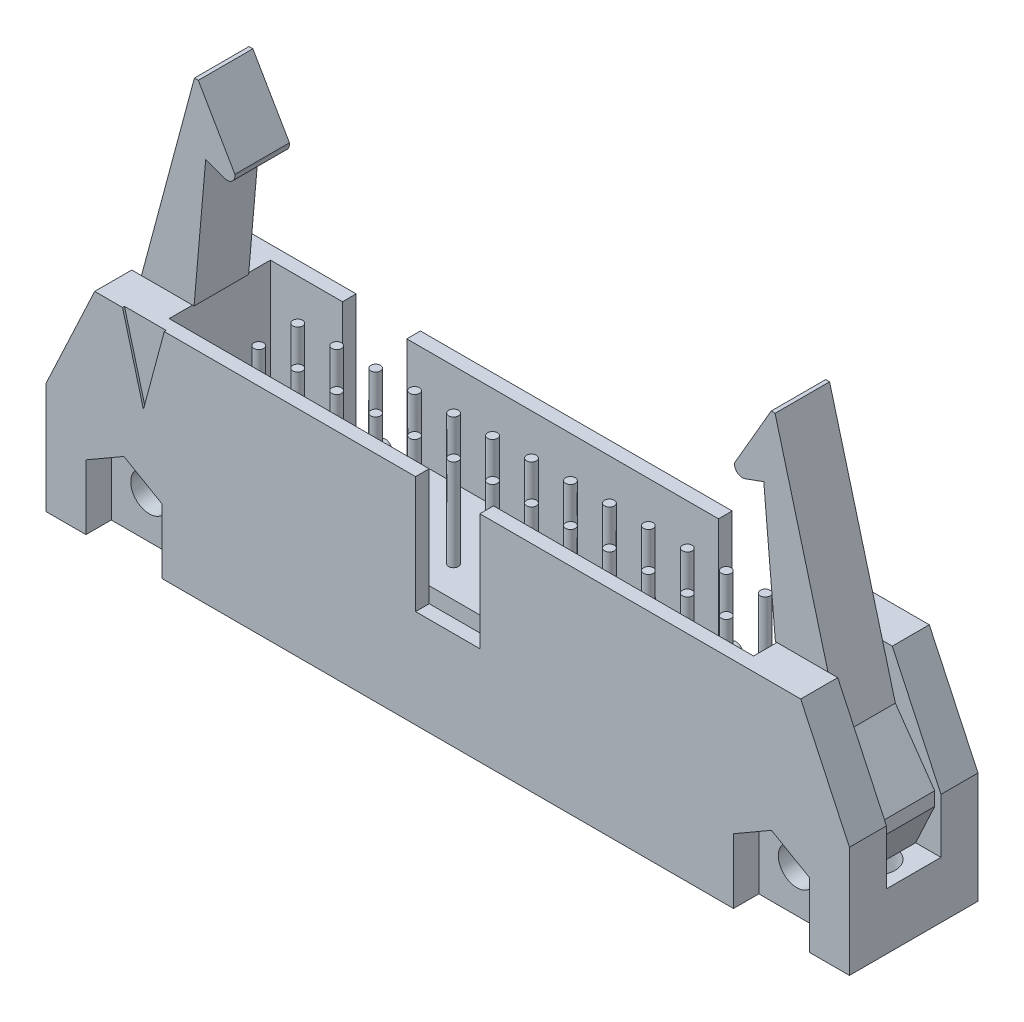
ISO-10303-21;
HEADER;
FILE_DESCRIPTION(('STEP AP214'),'2;1');
FILE_NAME('part.step','',(''),(''),'','','');
FILE_SCHEMA(('AUTOMOTIVE_DESIGN { 1 0 10303 214 1 1 1 1 }'));
ENDSEC;
DATA;
#1=APPLICATION_CONTEXT('core data for automotive mechanical design processes');
#2=APPLICATION_PROTOCOL_DEFINITION('international standard','automotive_design',2000,#1);
#3=PRODUCT_CONTEXT('',#1,'mechanical');
#4=PRODUCT('Part','Part','',(#3));
#5=PRODUCT_RELATED_PRODUCT_CATEGORY('part','',(#4));
#6=PRODUCT_DEFINITION_FORMATION('','',#4);
#7=PRODUCT_DEFINITION_CONTEXT('part definition',#1,'design');
#8=PRODUCT_DEFINITION('design','',#6,#7);
#9=PRODUCT_DEFINITION_SHAPE('','',#8);
#10=(LENGTH_UNIT() NAMED_UNIT(*) SI_UNIT(.MILLI.,.METRE.));
#11=(NAMED_UNIT(*) PLANE_ANGLE_UNIT() SI_UNIT($,.RADIAN.));
#12=(NAMED_UNIT(*) SI_UNIT($,.STERADIAN.) SOLID_ANGLE_UNIT());
#13=UNCERTAINTY_MEASURE_WITH_UNIT(LENGTH_MEASURE(1.E-05),#10,'distance_accuracy_value','');
#14=(GEOMETRIC_REPRESENTATION_CONTEXT(3) GLOBAL_UNCERTAINTY_ASSIGNED_CONTEXT((#13)) GLOBAL_UNIT_ASSIGNED_CONTEXT((#10,
#11,#12)) REPRESENTATION_CONTEXT('',''));
#15=CARTESIAN_POINT('',(0.,0.,0.));
#16=DIRECTION('',(0.,0.,1.));
#17=DIRECTION('',(1.,0.,0.));
#18=AXIS2_PLACEMENT_3D('',#15,#16,#17);
#19=CARTESIAN_POINT('',(8.9154,0.,-6.858));
#20=DIRECTION('',(0.,0.,-1.));
#21=DIRECTION('',(-1.,0.,0.));
#22=AXIS2_PLACEMENT_3D('',#19,#20,#21);
#23=PLANE('',#22);
#24=CARTESIAN_POINT('',(41.4274,0.990600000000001,-6.858));
#25=DIRECTION('',(0.,0.,-1.));
#26=DIRECTION('',(-1.,0.,0.));
#27=AXIS2_PLACEMENT_3D('',#24,#25,#26);
#28=CIRCLE('',#27,0.4445);
#29=CARTESIAN_POINT('',(40.9829,0.990600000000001,-6.858));
#30=VERTEX_POINT('',#29);
#31=EDGE_CURVE('E2885',#30,#30,#28,.T.);
#32=ORIENTED_EDGE('',*,*,#31,.F.);
#33=EDGE_LOOP('',(#32));
#34=FACE_BOUND('',#33,.T.);
#35=CARTESIAN_POINT('',(38.8874,0.990600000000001,-6.858));
#36=DIRECTION('',(0.,0.,-1.));
#37=DIRECTION('',(-1.,0.,0.));
#38=AXIS2_PLACEMENT_3D('',#35,#36,#37);
#39=CIRCLE('',#38,0.4445);
#40=CARTESIAN_POINT('',(38.4429,0.990600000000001,-6.858));
#41=VERTEX_POINT('',#40);
#42=EDGE_CURVE('E2900',#41,#41,#39,.T.);
#43=ORIENTED_EDGE('',*,*,#42,.F.);
#44=EDGE_LOOP('',(#43));
#45=FACE_BOUND('',#44,.T.);
#46=CARTESIAN_POINT('',(36.3474,0.990600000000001,-6.858));
#47=DIRECTION('',(0.,0.,-1.));
#48=DIRECTION('',(-1.,0.,0.));
#49=AXIS2_PLACEMENT_3D('',#46,#47,#48);
#50=CIRCLE('',#49,0.4445);
#51=CARTESIAN_POINT('',(35.9029,0.990600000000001,-6.858));
#52=VERTEX_POINT('',#51);
#53=EDGE_CURVE('E2912',#52,#52,#50,.T.);
#54=ORIENTED_EDGE('',*,*,#53,.F.);
#55=EDGE_LOOP('',(#54));
#56=FACE_BOUND('',#55,.T.);
#57=CARTESIAN_POINT('',(33.8074,0.990600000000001,-6.858));
#58=DIRECTION('',(0.,0.,-1.));
#59=DIRECTION('',(-1.,0.,0.));
#60=AXIS2_PLACEMENT_3D('',#57,#58,#59);
#61=CIRCLE('',#60,0.4445);
#62=CARTESIAN_POINT('',(33.3629,0.990600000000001,-6.858));
#63=VERTEX_POINT('',#62);
#64=EDGE_CURVE('E2924',#63,#63,#61,.T.);
#65=ORIENTED_EDGE('',*,*,#64,.F.);
#66=EDGE_LOOP('',(#65));
#67=FACE_BOUND('',#66,.T.);
#68=CARTESIAN_POINT('',(31.2674,0.990600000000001,-6.858));
#69=DIRECTION('',(0.,0.,-1.));
#70=DIRECTION('',(-1.,0.,0.));
#71=AXIS2_PLACEMENT_3D('',#68,#69,#70);
#72=CIRCLE('',#71,0.4445);
#73=CARTESIAN_POINT('',(30.8229,0.990600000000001,-6.858));
#74=VERTEX_POINT('',#73);
#75=EDGE_CURVE('E2936',#74,#74,#72,.T.);
#76=ORIENTED_EDGE('',*,*,#75,.F.);
#77=EDGE_LOOP('',(#76));
#78=FACE_BOUND('',#77,.T.);
#79=CARTESIAN_POINT('',(28.7274,0.990600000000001,-6.858));
#80=DIRECTION('',(0.,0.,-1.));
#81=DIRECTION('',(-1.,0.,0.));
#82=AXIS2_PLACEMENT_3D('',#79,#80,#81);
#83=CIRCLE('',#82,0.4445);
#84=CARTESIAN_POINT('',(28.2829,0.990600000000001,-6.858));
#85=VERTEX_POINT('',#84);
#86=EDGE_CURVE('E2948',#85,#85,#83,.T.);
#87=ORIENTED_EDGE('',*,*,#86,.F.);
#88=EDGE_LOOP('',(#87));
#89=FACE_BOUND('',#88,.T.);
#90=CARTESIAN_POINT('',(26.1874,0.990600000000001,-6.858));
#91=DIRECTION('',(0.,0.,-1.));
#92=DIRECTION('',(-1.,0.,0.));
#93=AXIS2_PLACEMENT_3D('',#90,#91,#92);
#94=CIRCLE('',#93,0.4445);
#95=CARTESIAN_POINT('',(25.7429,0.990600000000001,-6.858));
#96=VERTEX_POINT('',#95);
#97=EDGE_CURVE('E2960',#96,#96,#94,.T.);
#98=ORIENTED_EDGE('',*,*,#97,.F.);
#99=EDGE_LOOP('',(#98));
#100=FACE_BOUND('',#99,.T.);
#101=CARTESIAN_POINT('',(23.6474,0.990600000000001,-6.858));
#102=DIRECTION('',(0.,0.,-1.));
#103=DIRECTION('',(-1.,0.,0.));
#104=AXIS2_PLACEMENT_3D('',#101,#102,#103);
#105=CIRCLE('',#104,0.4445);
#106=CARTESIAN_POINT('',(23.2029,0.990600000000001,-6.858));
#107=VERTEX_POINT('',#106);
#108=EDGE_CURVE('E2972',#107,#107,#105,.T.);
#109=ORIENTED_EDGE('',*,*,#108,.F.);
#110=EDGE_LOOP('',(#109));
#111=FACE_BOUND('',#110,.T.);
#112=CARTESIAN_POINT('',(21.1074,0.990600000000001,-6.858));
#113=DIRECTION('',(0.,0.,-1.));
#114=DIRECTION('',(-1.,0.,0.));
#115=AXIS2_PLACEMENT_3D('',#112,#113,#114);
#116=CIRCLE('',#115,0.4445);
#117=CARTESIAN_POINT('',(20.6629,0.990600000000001,-6.858));
#118=VERTEX_POINT('',#117);
#119=EDGE_CURVE('E2984',#118,#118,#116,.T.);
#120=ORIENTED_EDGE('',*,*,#119,.F.);
#121=EDGE_LOOP('',(#120));
#122=FACE_BOUND('',#121,.T.);
#123=CARTESIAN_POINT('',(18.5674,0.990600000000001,-6.858));
#124=DIRECTION('',(0.,0.,-1.));
#125=DIRECTION('',(-1.,0.,0.));
#126=AXIS2_PLACEMENT_3D('',#123,#124,#125);
#127=CIRCLE('',#126,0.4445);
#128=CARTESIAN_POINT('',(18.1229,0.990600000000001,-6.858));
#129=VERTEX_POINT('',#128);
#130=EDGE_CURVE('E2996',#129,#129,#127,.T.);
#131=ORIENTED_EDGE('',*,*,#130,.F.);
#132=EDGE_LOOP('',(#131));
#133=FACE_BOUND('',#132,.T.);
#134=CARTESIAN_POINT('',(16.0274,0.990600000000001,-6.858));
#135=DIRECTION('',(0.,0.,-1.));
#136=DIRECTION('',(-1.,0.,0.));
#137=AXIS2_PLACEMENT_3D('',#134,#135,#136);
#138=CIRCLE('',#137,0.4445);
#139=CARTESIAN_POINT('',(15.5829,0.990600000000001,-6.858));
#140=VERTEX_POINT('',#139);
#141=EDGE_CURVE('E3008',#140,#140,#138,.T.);
#142=ORIENTED_EDGE('',*,*,#141,.F.);
#143=EDGE_LOOP('',(#142));
#144=FACE_BOUND('',#143,.T.);
#145=CARTESIAN_POINT('',(13.4874,0.990600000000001,-6.858));
#146=DIRECTION('',(0.,0.,-1.));
#147=DIRECTION('',(-1.,0.,0.));
#148=AXIS2_PLACEMENT_3D('',#145,#146,#147);
#149=CIRCLE('',#148,0.4445);
#150=CARTESIAN_POINT('',(13.0429,0.990600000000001,-6.858));
#151=VERTEX_POINT('',#150);
#152=EDGE_CURVE('E3020',#151,#151,#149,.T.);
#153=ORIENTED_EDGE('',*,*,#152,.F.);
#154=EDGE_LOOP('',(#153));
#155=FACE_BOUND('',#154,.T.);
#156=CARTESIAN_POINT('',(10.9474,0.990600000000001,-6.858));
#157=DIRECTION('',(0.,0.,-1.));
#158=DIRECTION('',(-1.,0.,0.));
#159=AXIS2_PLACEMENT_3D('',#156,#157,#158);
#160=CIRCLE('',#159,0.4445);
#161=CARTESIAN_POINT('',(10.5029,0.990600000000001,-6.858));
#162=VERTEX_POINT('',#161);
#163=EDGE_CURVE('E1292',#162,#162,#160,.T.);
#164=ORIENTED_EDGE('',*,*,#163,.F.);
#165=EDGE_LOOP('',(#164));
#166=FACE_BOUND('',#165,.T.);
#167=DIRECTION('',(-1.,0.,0.));
#168=VECTOR('',#167,1.);
#169=CARTESIAN_POINT('',(43.4594,0.,-6.858));
#170=LINE('',#169,#168);
#171=CARTESIAN_POINT('',(43.4594,0.,-6.858));
#172=VERTEX_POINT('',#171);
#173=CARTESIAN_POINT('',(8.9154,0.,-6.858));
#174=VERTEX_POINT('',#173);
#175=EDGE_CURVE('E514',#172,#174,#170,.T.);
#176=ORIENTED_EDGE('',*,*,#175,.T.);
#177=DIRECTION('',(0.,1.,0.));
#178=VECTOR('',#177,1.);
#179=CARTESIAN_POINT('',(8.9154,0.,-6.858));
#180=LINE('',#179,#178);
#181=CARTESIAN_POINT('',(8.9154,4.318,-6.858));
#182=VERTEX_POINT('',#181);
#183=EDGE_CURVE('E506',#174,#182,#180,.T.);
#184=ORIENTED_EDGE('',*,*,#183,.T.);
#185=DIRECTION('',(1.,0.,0.));
#186=VECTOR('',#185,1.);
#187=CARTESIAN_POINT('',(8.9154,4.318,-6.858));
#188=LINE('',#187,#186);
#189=CARTESIAN_POINT('',(43.4594,4.318,-6.858));
#190=VERTEX_POINT('',#189);
#191=EDGE_CURVE('E513',#182,#190,#188,.T.);
#192=ORIENTED_EDGE('',*,*,#191,.T.);
#193=DIRECTION('',(0.,-1.,0.));
#194=VECTOR('',#193,1.);
#195=CARTESIAN_POINT('',(43.4594,0.,-6.858));
#196=LINE('',#195,#194);
#197=EDGE_CURVE('E520',#190,#172,#196,.T.);
#198=ORIENTED_EDGE('',*,*,#197,.T.);
#199=EDGE_LOOP('',(#176,#184,#192,#198));
#200=FACE_BOUND('',#199,.T.);
#201=CARTESIAN_POINT('',(10.9474,3.5306,-6.858));
#202=DIRECTION('',(0.,0.,-1.));
#203=DIRECTION('',(-1.,0.,0.));
#204=AXIS2_PLACEMENT_3D('',#201,#202,#203);
#205=CIRCLE('',#204,0.4445);
#206=CARTESIAN_POINT('',(10.5029,3.5306,-6.858));
#207=VERTEX_POINT('',#206);
#208=EDGE_CURVE('E3026',#207,#207,#205,.T.);
#209=ORIENTED_EDGE('',*,*,#208,.F.);
#210=EDGE_LOOP('',(#209));
#211=FACE_BOUND('',#210,.T.);
#212=CARTESIAN_POINT('',(13.4874,3.5306,-6.858));
#213=DIRECTION('',(0.,0.,-1.));
#214=DIRECTION('',(-1.,0.,0.));
#215=AXIS2_PLACEMENT_3D('',#212,#213,#214);
#216=CIRCLE('',#215,0.4445);
#217=CARTESIAN_POINT('',(13.0429,3.5306,-6.858));
#218=VERTEX_POINT('',#217);
#219=EDGE_CURVE('E3014',#218,#218,#216,.T.);
#220=ORIENTED_EDGE('',*,*,#219,.F.);
#221=EDGE_LOOP('',(#220));
#222=FACE_BOUND('',#221,.T.);
#223=CARTESIAN_POINT('',(16.0274,3.5306,-6.858));
#224=DIRECTION('',(0.,0.,-1.));
#225=DIRECTION('',(-1.,0.,0.));
#226=AXIS2_PLACEMENT_3D('',#223,#224,#225);
#227=CIRCLE('',#226,0.4445);
#228=CARTESIAN_POINT('',(15.5829,3.5306,-6.858));
#229=VERTEX_POINT('',#228);
#230=EDGE_CURVE('E3002',#229,#229,#227,.T.);
#231=ORIENTED_EDGE('',*,*,#230,.F.);
#232=EDGE_LOOP('',(#231));
#233=FACE_BOUND('',#232,.T.);
#234=CARTESIAN_POINT('',(18.5674,3.5306,-6.858));
#235=DIRECTION('',(0.,0.,-1.));
#236=DIRECTION('',(-1.,0.,0.));
#237=AXIS2_PLACEMENT_3D('',#234,#235,#236);
#238=CIRCLE('',#237,0.4445);
#239=CARTESIAN_POINT('',(18.1229,3.5306,-6.858));
#240=VERTEX_POINT('',#239);
#241=EDGE_CURVE('E2990',#240,#240,#238,.T.);
#242=ORIENTED_EDGE('',*,*,#241,.F.);
#243=EDGE_LOOP('',(#242));
#244=FACE_BOUND('',#243,.T.);
#245=CARTESIAN_POINT('',(21.1074,3.5306,-6.858));
#246=DIRECTION('',(0.,0.,-1.));
#247=DIRECTION('',(-1.,0.,0.));
#248=AXIS2_PLACEMENT_3D('',#245,#246,#247);
#249=CIRCLE('',#248,0.4445);
#250=CARTESIAN_POINT('',(20.6629,3.5306,-6.858));
#251=VERTEX_POINT('',#250);
#252=EDGE_CURVE('E2978',#251,#251,#249,.T.);
#253=ORIENTED_EDGE('',*,*,#252,.F.);
#254=EDGE_LOOP('',(#253));
#255=FACE_BOUND('',#254,.T.);
#256=CARTESIAN_POINT('',(23.6474,3.5306,-6.858));
#257=DIRECTION('',(0.,0.,-1.));
#258=DIRECTION('',(-1.,0.,0.));
#259=AXIS2_PLACEMENT_3D('',#256,#257,#258);
#260=CIRCLE('',#259,0.4445);
#261=CARTESIAN_POINT('',(23.2029,3.5306,-6.858));
#262=VERTEX_POINT('',#261);
#263=EDGE_CURVE('E2966',#262,#262,#260,.T.);
#264=ORIENTED_EDGE('',*,*,#263,.F.);
#265=EDGE_LOOP('',(#264));
#266=FACE_BOUND('',#265,.T.);
#267=CARTESIAN_POINT('',(26.1874,3.5306,-6.858));
#268=DIRECTION('',(0.,0.,-1.));
#269=DIRECTION('',(-1.,0.,0.));
#270=AXIS2_PLACEMENT_3D('',#267,#268,#269);
#271=CIRCLE('',#270,0.4445);
#272=CARTESIAN_POINT('',(25.7429,3.5306,-6.858));
#273=VERTEX_POINT('',#272);
#274=EDGE_CURVE('E2954',#273,#273,#271,.T.);
#275=ORIENTED_EDGE('',*,*,#274,.F.);
#276=EDGE_LOOP('',(#275));
#277=FACE_BOUND('',#276,.T.);
#278=CARTESIAN_POINT('',(28.7274,3.5306,-6.858));
#279=DIRECTION('',(0.,0.,-1.));
#280=DIRECTION('',(-1.,0.,0.));
#281=AXIS2_PLACEMENT_3D('',#278,#279,#280);
#282=CIRCLE('',#281,0.4445);
#283=CARTESIAN_POINT('',(28.2829,3.5306,-6.858));
#284=VERTEX_POINT('',#283);
#285=EDGE_CURVE('E2942',#284,#284,#282,.T.);
#286=ORIENTED_EDGE('',*,*,#285,.F.);
#287=EDGE_LOOP('',(#286));
#288=FACE_BOUND('',#287,.T.);
#289=CARTESIAN_POINT('',(31.2674,3.5306,-6.858));
#290=DIRECTION('',(0.,0.,-1.));
#291=DIRECTION('',(-1.,0.,0.));
#292=AXIS2_PLACEMENT_3D('',#289,#290,#291);
#293=CIRCLE('',#292,0.4445);
#294=CARTESIAN_POINT('',(30.8229,3.5306,-6.858));
#295=VERTEX_POINT('',#294);
#296=EDGE_CURVE('E2930',#295,#295,#293,.T.);
#297=ORIENTED_EDGE('',*,*,#296,.F.);
#298=EDGE_LOOP('',(#297));
#299=FACE_BOUND('',#298,.T.);
#300=CARTESIAN_POINT('',(33.8074,3.5306,-6.858));
#301=DIRECTION('',(0.,0.,-1.));
#302=DIRECTION('',(-1.,0.,0.));
#303=AXIS2_PLACEMENT_3D('',#300,#301,#302);
#304=CIRCLE('',#303,0.4445);
#305=CARTESIAN_POINT('',(33.3629,3.5306,-6.858));
#306=VERTEX_POINT('',#305);
#307=EDGE_CURVE('E2918',#306,#306,#304,.T.);
#308=ORIENTED_EDGE('',*,*,#307,.F.);
#309=EDGE_LOOP('',(#308));
#310=FACE_BOUND('',#309,.T.);
#311=CARTESIAN_POINT('',(36.3474,3.5306,-6.858));
#312=DIRECTION('',(0.,0.,-1.));
#313=DIRECTION('',(-1.,0.,0.));
#314=AXIS2_PLACEMENT_3D('',#311,#312,#313);
#315=CIRCLE('',#314,0.4445);
#316=CARTESIAN_POINT('',(35.9029,3.5306,-6.858));
#317=VERTEX_POINT('',#316);
#318=EDGE_CURVE('E2906',#317,#317,#315,.T.);
#319=ORIENTED_EDGE('',*,*,#318,.F.);
#320=EDGE_LOOP('',(#319));
#321=FACE_BOUND('',#320,.T.);
#322=CARTESIAN_POINT('',(38.8874,3.5306,-6.858));
#323=DIRECTION('',(0.,0.,-1.));
#324=DIRECTION('',(-1.,0.,0.));
#325=AXIS2_PLACEMENT_3D('',#322,#323,#324);
#326=CIRCLE('',#325,0.4445);
#327=CARTESIAN_POINT('',(38.4429,3.5306,-6.858));
#328=VERTEX_POINT('',#327);
#329=EDGE_CURVE('E2895',#328,#328,#326,.T.);
#330=ORIENTED_EDGE('',*,*,#329,.F.);
#331=EDGE_LOOP('',(#330));
#332=FACE_BOUND('',#331,.T.);
#333=CARTESIAN_POINT('',(41.4274,3.5306,-6.858));
#334=DIRECTION('',(0.,0.,-1.));
#335=DIRECTION('',(-1.,0.,0.));
#336=AXIS2_PLACEMENT_3D('',#333,#334,#335);
#337=CIRCLE('',#336,0.4445);
#338=CARTESIAN_POINT('',(40.9829,3.5306,-6.858));
#339=VERTEX_POINT('',#338);
#340=EDGE_CURVE('E2886',#339,#339,#337,.T.);
#341=ORIENTED_EDGE('',*,*,#340,.F.);
#342=EDGE_LOOP('',(#341));
#343=FACE_BOUND('',#342,.T.);
#344=ADVANCED_FACE('F31',(#34,#45,#56,#67,#78,#89,#100,#111,#122,#133,#144,#155,#166,#200,#211,
#222,#233,#244,#255,#266,#277,#288,#299,#310,#321,#332,#343),#23,.T.);
#345=CARTESIAN_POINT('',(0.,14.0208,-8.382));
#346=DIRECTION('',(0.,1.,0.));
#347=DIRECTION('',(0.,0.,1.));
#348=AXIS2_PLACEMENT_3D('',#345,#346,#347);
#349=PLANE('',#348);
#350=DIRECTION('',(1.,0.,0.));
#351=VECTOR('',#350,1.);
#352=CARTESIAN_POINT('',(45.1358,14.0208,-5.969));
#353=LINE('',#352,#351);
#354=CARTESIAN_POINT('',(45.2374,14.0208,-5.969));
#355=VERTEX_POINT('',#354);
#356=CARTESIAN_POINT('',(48.5648,14.0208,-5.969));
#357=VERTEX_POINT('',#356);
#358=EDGE_CURVE('E779',#355,#357,#353,.T.);
#359=ORIENTED_EDGE('',*,*,#358,.T.);
#360=DIRECTION('',(-1.,0.,0.));
#361=VECTOR('',#360,1.);
#362=CARTESIAN_POINT('',(48.5648,14.0208,-5.969));
#363=LINE('',#362,#361);
#364=CARTESIAN_POINT('',(49.1998,14.0208,-5.969));
#365=VERTEX_POINT('',#364);
#366=EDGE_CURVE('E673',#365,#357,#363,.T.);
#367=ORIENTED_EDGE('',*,*,#366,.F.);
#368=DIRECTION('',(0.,0.,1.));
#369=VECTOR('',#368,1.);
#370=CARTESIAN_POINT('',(49.1998,14.0208,-8.382));
#371=LINE('',#370,#369);
#372=CARTESIAN_POINT('',(49.1998,14.0208,-8.382));
#373=VERTEX_POINT('',#372);
#374=EDGE_CURVE('E1114',#373,#365,#371,.T.);
#375=ORIENTED_EDGE('',*,*,#374,.F.);
#376=DIRECTION('',(-1.,0.,0.));
#377=VECTOR('',#376,1.);
#378=CARTESIAN_POINT('',(0.,14.0208,-8.382));
#379=LINE('',#378,#377);
#380=CARTESIAN_POINT('',(40.5384,14.0208,-8.382));
#381=VERTEX_POINT('',#380);
#382=EDGE_CURVE('E1140',#373,#381,#379,.T.);
#383=ORIENTED_EDGE('',*,*,#382,.T.);
#384=DIRECTION('',(0.,0.,-1.));
#385=VECTOR('',#384,1.);
#386=CARTESIAN_POINT('',(40.5384,14.0208,-7.493));
#387=LINE('',#386,#385);
#388=CARTESIAN_POINT('',(40.5384,14.0208,-7.493));
#389=VERTEX_POINT('',#388);
#390=EDGE_CURVE('E934',#389,#381,#387,.T.);
#391=ORIENTED_EDGE('',*,*,#390,.F.);
#392=DIRECTION('',(-1.,0.,0.));
#393=VECTOR('',#392,1.);
#394=CARTESIAN_POINT('',(7.13739999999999,14.0208,-7.493));
#395=LINE('',#394,#393);
#396=CARTESIAN_POINT('',(45.2374,14.0208,-7.493));
#397=VERTEX_POINT('',#396);
#398=EDGE_CURVE('E1082',#397,#389,#395,.T.);
#399=ORIENTED_EDGE('',*,*,#398,.F.);
#400=DIRECTION('',(0.,0.,-1.));
#401=VECTOR('',#400,1.);
#402=CARTESIAN_POINT('',(45.2374,14.0208,-7.493));
#403=LINE('',#402,#401);
#404=EDGE_CURVE('E1076',#355,#397,#403,.T.);
#405=ORIENTED_EDGE('',*,*,#404,.F.);
#406=EDGE_LOOP('',(#359,#367,#375,#383,#391,#399,#405));
#407=FACE_BOUND('',#406,.T.);
#408=ADVANCED_FACE('F1338',(#407),#349,.T.);
#409=CARTESIAN_POINT('',(52.3748,0.,-8.382));
#410=DIRECTION('',(1.,0.,0.));
#411=DIRECTION('',(0.,0.,-1.));
#412=AXIS2_PLACEMENT_3D('',#409,#410,#411);
#413=PLANE('',#412);
#414=DIRECTION('',(0.,0.,1.));
#415=VECTOR('',#414,1.);
#416=CARTESIAN_POINT('',(52.3748,7.239,-8.382));
#417=LINE('',#416,#415);
#418=CARTESIAN_POINT('',(52.3748,7.239,-8.382));
#419=VERTEX_POINT('',#418);
#420=CARTESIAN_POINT('',(52.3748,7.239,-5.969));
#421=VERTEX_POINT('',#420);
#422=EDGE_CURVE('E1109',#419,#421,#417,.T.);
#423=ORIENTED_EDGE('',*,*,#422,.T.);
#424=DIRECTION('',(0.,1.,0.));
#425=VECTOR('',#424,1.);
#426=CARTESIAN_POINT('',(52.3748,7.239,-5.969));
#427=LINE('',#426,#425);
#428=CARTESIAN_POINT('',(52.3748,3.683,-5.969));
#429=VERTEX_POINT('',#428);
#430=EDGE_CURVE('E669',#429,#421,#427,.T.);
#431=ORIENTED_EDGE('',*,*,#430,.F.);
#432=DIRECTION('',(0.,0.,1.));
#433=VECTOR('',#432,1.);
#434=CARTESIAN_POINT('',(52.3748,3.683,-5.969));
#435=LINE('',#434,#433);
#436=CARTESIAN_POINT('',(52.3748,3.683,-2.413));
#437=VERTEX_POINT('',#436);
#438=EDGE_CURVE('E698',#429,#437,#435,.T.);
#439=ORIENTED_EDGE('',*,*,#438,.T.);
#440=DIRECTION('',(0.,1.,0.));
#441=VECTOR('',#440,1.);
#442=CARTESIAN_POINT('',(52.3748,7.239,-2.413));
#443=LINE('',#442,#441);
#444=CARTESIAN_POINT('',(52.3748,7.239,-2.413));
#445=VERTEX_POINT('',#444);
#446=EDGE_CURVE('E690',#437,#445,#443,.T.);
#447=ORIENTED_EDGE('',*,*,#446,.T.);
#448=CARTESIAN_POINT('',(52.3748,7.239,0.));
#449=VERTEX_POINT('',#448);
#450=EDGE_CURVE('E1113',#445,#449,#417,.T.);
#451=ORIENTED_EDGE('',*,*,#450,.T.);
#452=DIRECTION('',(0.,1.,0.));
#453=VECTOR('',#452,1.);
#454=CARTESIAN_POINT('',(52.3748,0.,0.));
#455=LINE('',#454,#453);
#456=CARTESIAN_POINT('',(52.3748,0.,0.));
#457=VERTEX_POINT('',#456);
#458=EDGE_CURVE('E1150',#457,#449,#455,.T.);
#459=ORIENTED_EDGE('',*,*,#458,.F.);
#460=DIRECTION('',(0.,0.,1.));
#461=VECTOR('',#460,1.);
#462=CARTESIAN_POINT('',(52.3748,0.,-8.382));
#463=LINE('',#462,#461);
#464=CARTESIAN_POINT('',(52.3748,0.,-8.382));
#465=VERTEX_POINT('',#464);
#466=EDGE_CURVE('E1158',#465,#457,#463,.T.);
#467=ORIENTED_EDGE('',*,*,#466,.F.);
#468=DIRECTION('',(0.,1.,0.));
#469=VECTOR('',#468,1.);
#470=CARTESIAN_POINT('',(52.3748,0.,-8.382));
#471=LINE('',#470,#469);
#472=EDGE_CURVE('E1136',#465,#419,#471,.T.);
#473=ORIENTED_EDGE('',*,*,#472,.T.);
#474=EDGE_LOOP('',(#423,#431,#439,#447,#451,#459,#467,#473));
#475=FACE_BOUND('',#474,.T.);
#476=ADVANCED_FACE('F1307',(#475),#413,.T.);
#477=CARTESIAN_POINT('',(49.1998,14.0208,-8.382));
#478=DIRECTION('',(-0.905662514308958,-0.42399930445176,0.));
#479=DIRECTION('',(0.42399930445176,-0.905662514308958,0.));
#480=AXIS2_PLACEMENT_3D('',#477,#478,#479);
#481=PLANE('',#480);
#482=DIRECTION('',(-0.42399930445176,0.905662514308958,0.));
#483=VECTOR('',#482,1.);
#484=CARTESIAN_POINT('',(52.3748,7.239,-5.969));
#485=LINE('',#484,#483);
#486=EDGE_CURVE('E671',#421,#365,#485,.T.);
#487=ORIENTED_EDGE('',*,*,#486,.F.);
#488=ORIENTED_EDGE('',*,*,#422,.F.);
#489=DIRECTION('',(0.42399930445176,-0.905662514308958,0.));
#490=VECTOR('',#489,1.);
#491=CARTESIAN_POINT('',(49.1998,14.0208,-8.382));
#492=LINE('',#491,#490);
#493=EDGE_CURVE('E1103',#373,#419,#492,.T.);
#494=ORIENTED_EDGE('',*,*,#493,.F.);
#495=ORIENTED_EDGE('',*,*,#374,.T.);
#496=EDGE_LOOP('',(#487,#488,#494,#495));
#497=FACE_BOUND('',#496,.T.);
#498=ADVANCED_FACE('F1821',(#497),#481,.F.);
#499=DIRECTION('',(0.,0.,1.));
#500=VECTOR('',#499,1.);
#501=CARTESIAN_POINT('',(7.71118189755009,14.0208,-0.127));
#502=LINE('',#501,#500);
#503=CARTESIAN_POINT('',(7.71118189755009,14.0208,-0.127));
#504=VERTEX_POINT('',#503);
#505=CARTESIAN_POINT('',(7.71118189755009,14.0208,0.));
#506=VERTEX_POINT('',#505);
#507=EDGE_CURVE('E646',#504,#506,#502,.T.);
#508=ORIENTED_EDGE('',*,*,#507,.T.);
#509=DIRECTION('',(-1.,0.,0.));
#510=VECTOR('',#509,1.);
#511=CARTESIAN_POINT('',(0.,14.0208,0.));
#512=LINE('',#511,#510);
#513=CARTESIAN_POINT('',(24.0919,14.0208,0.));
#514=VERTEX_POINT('',#513);
#515=EDGE_CURVE('E1157',#514,#506,#512,.T.);
#516=ORIENTED_EDGE('',*,*,#515,.F.);
#517=DIRECTION('',(0.,0.,1.));
#518=VECTOR('',#517,1.);
#519=CARTESIAN_POINT('',(24.0919,14.0208,-0.889));
#520=LINE('',#519,#518);
#521=CARTESIAN_POINT('',(24.0919,14.0208,-0.889));
#522=VERTEX_POINT('',#521);
#523=EDGE_CURVE('E1039',#522,#514,#520,.T.);
#524=ORIENTED_EDGE('',*,*,#523,.F.);
#525=DIRECTION('',(1.,0.,0.));
#526=VECTOR('',#525,1.);
#527=CARTESIAN_POINT('',(7.13739999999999,14.0208,-0.889000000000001));
#528=LINE('',#527,#526);
#529=CARTESIAN_POINT('',(7.13739999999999,14.0208,-0.889000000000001));
#530=VERTEX_POINT('',#529);
#531=EDGE_CURVE('E1073',#530,#522,#528,.T.);
#532=ORIENTED_EDGE('',*,*,#531,.F.);
#533=DIRECTION('',(0.,0.,1.));
#534=VECTOR('',#533,1.);
#535=CARTESIAN_POINT('',(7.13739999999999,14.0208,-7.493));
#536=LINE('',#535,#534);
#537=CARTESIAN_POINT('',(7.13739999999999,14.0208,-2.413));
#538=VERTEX_POINT('',#537);
#539=EDGE_CURVE('E1085',#538,#530,#536,.T.);
#540=ORIENTED_EDGE('',*,*,#539,.F.);
#541=DIRECTION('',(1.,0.,0.));
#542=VECTOR('',#541,1.);
#543=CARTESIAN_POINT('',(7.239,14.0208,-2.413));
#544=LINE('',#543,#542);
#545=CARTESIAN_POINT('',(3.81,14.0208,-2.413));
#546=VERTEX_POINT('',#545);
#547=EDGE_CURVE('E862',#546,#538,#544,.T.);
#548=ORIENTED_EDGE('',*,*,#547,.F.);
#549=DIRECTION('',(-1.,0.,0.));
#550=VECTOR('',#549,1.);
#551=CARTESIAN_POINT('',(3.81,14.0208,-2.413));
#552=LINE('',#551,#550);
#553=CARTESIAN_POINT('',(3.175,14.0208,-2.413));
#554=VERTEX_POINT('',#553);
#555=EDGE_CURVE('E739',#546,#554,#552,.T.);
#556=ORIENTED_EDGE('',*,*,#555,.T.);
#557=DIRECTION('',(0.,0.,1.));
#558=VECTOR('',#557,1.);
#559=CARTESIAN_POINT('',(3.175,14.0208,-8.382));
#560=LINE('',#559,#558);
#561=CARTESIAN_POINT('',(3.175,14.0208,0.));
#562=VERTEX_POINT('',#561);
#563=EDGE_CURVE('E1127',#554,#562,#560,.T.);
#564=ORIENTED_EDGE('',*,*,#563,.T.);
#565=CARTESIAN_POINT('',(4.98881810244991,14.0208,0.));
#566=VERTEX_POINT('',#565);
#567=EDGE_CURVE('E1154',#566,#562,#512,.T.);
#568=ORIENTED_EDGE('',*,*,#567,.F.);
#569=DIRECTION('',(0.,0.,1.));
#570=VECTOR('',#569,1.);
#571=CARTESIAN_POINT('',(4.98881810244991,14.0208,-0.127));
#572=LINE('',#571,#570);
#573=CARTESIAN_POINT('',(4.98881810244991,14.0208,-0.127));
#574=VERTEX_POINT('',#573);
#575=EDGE_CURVE('E642',#574,#566,#572,.T.);
#576=ORIENTED_EDGE('',*,*,#575,.F.);
#577=DIRECTION('',(-1.,0.,0.));
#578=VECTOR('',#577,1.);
#579=CARTESIAN_POINT('',(7.71118189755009,14.0208,-0.127));
#580=LINE('',#579,#578);
#581=EDGE_CURVE('E632',#504,#574,#580,.T.);
#582=ORIENTED_EDGE('',*,*,#581,.F.);
#583=EDGE_LOOP('',(#508,#516,#524,#532,#540,#548,#556,#564,#568,#576,#582));
#584=FACE_BOUND('',#583,.T.);
#585=ADVANCED_FACE('F1346',(#584),#349,.T.);
#586=CARTESIAN_POINT('',(3.175,14.0208,-8.382));
#587=DIRECTION('',(0.905662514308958,-0.423999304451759,0.));
#588=DIRECTION('',(0.423999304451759,0.905662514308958,0.));
#589=AXIS2_PLACEMENT_3D('',#586,#587,#588);
#590=PLANE('',#589);
#591=DIRECTION('',(-0.423999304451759,-0.905662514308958,0.));
#592=VECTOR('',#591,1.);
#593=CARTESIAN_POINT('',(0.,7.239,-2.413));
#594=LINE('',#593,#592);
#595=CARTESIAN_POINT('',(0.,7.239,-2.413));
#596=VERTEX_POINT('',#595);
#597=EDGE_CURVE('E742',#554,#596,#594,.T.);
#598=ORIENTED_EDGE('',*,*,#597,.T.);
#599=DIRECTION('',(0.,0.,1.));
#600=VECTOR('',#599,1.);
#601=CARTESIAN_POINT('',(0.,7.239,-8.382));
#602=LINE('',#601,#600);
#603=CARTESIAN_POINT('',(0.,7.239,0.));
#604=VERTEX_POINT('',#603);
#605=EDGE_CURVE('E1120',#596,#604,#602,.T.);
#606=ORIENTED_EDGE('',*,*,#605,.T.);
#607=DIRECTION('',(0.423999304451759,0.905662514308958,0.));
#608=VECTOR('',#607,1.);
#609=CARTESIAN_POINT('',(3.175,14.0208,0.));
#610=LINE('',#609,#608);
#611=EDGE_CURVE('E1112',#604,#562,#610,.T.);
#612=ORIENTED_EDGE('',*,*,#611,.T.);
#613=ORIENTED_EDGE('',*,*,#563,.F.);
#614=EDGE_LOOP('',(#598,#606,#612,#613));
#615=FACE_BOUND('',#614,.T.);
#616=ADVANCED_FACE('F1825',(#615),#590,.F.);
#617=DIRECTION('',(-1.,0.,0.));
#618=VECTOR('',#617,1.);
#619=CARTESIAN_POINT('',(3.81,14.0208,-5.969));
#620=LINE('',#619,#618);
#621=CARTESIAN_POINT('',(3.81,14.0208,-5.969));
#622=VERTEX_POINT('',#621);
#623=CARTESIAN_POINT('',(3.175,14.0208,-5.969));
#624=VERTEX_POINT('',#623);
#625=EDGE_CURVE('E718',#622,#624,#620,.T.);
#626=ORIENTED_EDGE('',*,*,#625,.F.);
#627=DIRECTION('',(1.,0.,0.));
#628=VECTOR('',#627,1.);
#629=CARTESIAN_POINT('',(7.239,14.0208,-5.969));
#630=LINE('',#629,#628);
#631=CARTESIAN_POINT('',(7.13739999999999,14.0208,-5.969));
#632=VERTEX_POINT('',#631);
#633=EDGE_CURVE('E837',#622,#632,#630,.T.);
#634=ORIENTED_EDGE('',*,*,#633,.T.);
#635=CARTESIAN_POINT('',(7.13739999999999,14.0208,-7.493));
#636=VERTEX_POINT('',#635);
#637=EDGE_CURVE('E1087',#636,#632,#536,.T.);
#638=ORIENTED_EDGE('',*,*,#637,.F.);
#639=CARTESIAN_POINT('',(11.8364,14.0208,-7.493));
#640=VERTEX_POINT('',#639);
#641=EDGE_CURVE('E1080',#640,#636,#395,.T.);
#642=ORIENTED_EDGE('',*,*,#641,.F.);
#643=DIRECTION('',(0.,0.,-1.));
#644=VECTOR('',#643,1.);
#645=CARTESIAN_POINT('',(11.8364,14.0208,-7.493));
#646=LINE('',#645,#644);
#647=CARTESIAN_POINT('',(11.8364,14.0208,-8.382));
#648=VERTEX_POINT('',#647);
#649=EDGE_CURVE('E907',#640,#648,#646,.T.);
#650=ORIENTED_EDGE('',*,*,#649,.T.);
#651=CARTESIAN_POINT('',(3.175,14.0208,-8.382));
#652=VERTEX_POINT('',#651);
#653=EDGE_CURVE('E1139',#648,#652,#379,.T.);
#654=ORIENTED_EDGE('',*,*,#653,.T.);
#655=EDGE_CURVE('E1123',#652,#624,#560,.T.);
#656=ORIENTED_EDGE('',*,*,#655,.T.);
#657=EDGE_LOOP('',(#626,#634,#638,#642,#650,#654,#656));
#658=FACE_BOUND('',#657,.T.);
#659=ADVANCED_FACE('F3219',(#658),#349,.T.);
#660=CARTESIAN_POINT('',(7.13739999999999,7.4168,-7.493));
#661=DIRECTION('',(0.,0.,-1.));
#662=DIRECTION('',(-1.,0.,0.));
#663=AXIS2_PLACEMENT_3D('',#660,#661,#662);
#664=PLANE('',#663);
#665=DIRECTION('',(-1.,0.,0.));
#666=VECTOR('',#665,1.);
#667=CARTESIAN_POINT('',(7.13739999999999,7.4168,-7.493));
#668=LINE('',#667,#666);
#669=CARTESIAN_POINT('',(11.8364,7.4168,-7.493));
#670=VERTEX_POINT('',#669);
#671=CARTESIAN_POINT('',(7.13739999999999,7.4168,-7.493));
#672=VERTEX_POINT('',#671);
#673=EDGE_CURVE('E1064',#670,#672,#668,.T.);
#674=ORIENTED_EDGE('',*,*,#673,.F.);
#675=DIRECTION('',(0.,1.,0.));
#676=VECTOR('',#675,1.);
#677=CARTESIAN_POINT('',(11.8364,14.0208,-7.493));
#678=LINE('',#677,#676);
#679=EDGE_CURVE('E900',#670,#640,#678,.T.);
#680=ORIENTED_EDGE('',*,*,#679,.T.);
#681=ORIENTED_EDGE('',*,*,#641,.T.);
#682=DIRECTION('',(0.,1.,0.));
#683=VECTOR('',#682,1.);
#684=CARTESIAN_POINT('',(7.13739999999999,7.4168,-7.493));
#685=LINE('',#684,#683);
#686=EDGE_CURVE('E1095',#672,#636,#685,.T.);
#687=ORIENTED_EDGE('',*,*,#686,.F.);
#688=EDGE_LOOP('',(#674,#680,#681,#687));
#689=FACE_BOUND('',#688,.T.);
#690=ADVANCED_FACE('F1809',(#689),#664,.F.);
#691=DIRECTION('',(0.,0.,-1.));
#692=VECTOR('',#691,1.);
#693=CARTESIAN_POINT('',(16.0274,14.0208,-7.493));
#694=LINE('',#693,#692);
#695=CARTESIAN_POINT('',(16.0274,14.0208,-7.493));
#696=VERTEX_POINT('',#695);
#697=CARTESIAN_POINT('',(16.0274,14.0208,-8.382));
#698=VERTEX_POINT('',#697);
#699=EDGE_CURVE('E920',#696,#698,#694,.T.);
#700=ORIENTED_EDGE('',*,*,#699,.F.);
#701=CARTESIAN_POINT('',(36.3474,14.0208,-7.493));
#702=VERTEX_POINT('',#701);
#703=EDGE_CURVE('E1086',#702,#696,#395,.T.);
#704=ORIENTED_EDGE('',*,*,#703,.F.);
#705=DIRECTION('',(0.,0.,-1.));
#706=VECTOR('',#705,1.);
#707=CARTESIAN_POINT('',(36.3474,14.0208,-7.493));
#708=LINE('',#707,#706);
#709=CARTESIAN_POINT('',(36.3474,14.0208,-8.382));
#710=VERTEX_POINT('',#709);
#711=EDGE_CURVE('E942',#702,#710,#708,.T.);
#712=ORIENTED_EDGE('',*,*,#711,.T.);
#713=EDGE_CURVE('E1144',#710,#698,#379,.T.);
#714=ORIENTED_EDGE('',*,*,#713,.T.);
#715=EDGE_LOOP('',(#700,#704,#712,#714));
#716=FACE_BOUND('',#715,.T.);
#717=ADVANCED_FACE('F1832',(#716),#349,.T.);
#718=ORIENTED_EDGE('',*,*,#703,.T.);
#719=DIRECTION('',(0.,-1.,0.));
#720=VECTOR('',#719,1.);
#721=CARTESIAN_POINT('',(16.0274,6.4008,-7.493));
#722=LINE('',#721,#720);
#723=CARTESIAN_POINT('',(16.0274,7.4168,-7.493));
#724=VERTEX_POINT('',#723);
#725=EDGE_CURVE('E901',#696,#724,#722,.T.);
#726=ORIENTED_EDGE('',*,*,#725,.T.);
#727=CARTESIAN_POINT('',(36.3474,7.4168,-7.493));
#728=VERTEX_POINT('',#727);
#729=EDGE_CURVE('E3446',#728,#724,#668,.T.);
#730=ORIENTED_EDGE('',*,*,#729,.F.);
#731=DIRECTION('',(0.,1.,0.));
#732=VECTOR('',#731,1.);
#733=CARTESIAN_POINT('',(36.3474,7.4168,-7.493));
#734=LINE('',#733,#732);
#735=EDGE_CURVE('E11',#728,#702,#734,.T.);
#736=ORIENTED_EDGE('',*,*,#735,.T.);
#737=EDGE_LOOP('',(#718,#726,#730,#736));
#738=FACE_BOUND('',#737,.T.);
#739=ADVANCED_FACE('F1798',(#738),#664,.F.);
#740=CARTESIAN_POINT('',(7.13739999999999,7.4168,-0.889000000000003));
#741=DIRECTION('',(0.,-1.,0.));
#742=DIRECTION('',(0.,0.,-1.));
#743=AXIS2_PLACEMENT_3D('',#740,#741,#742);
#744=PLANE('',#743);
#745=CARTESIAN_POINT('',(41.4274,7.4168,-2.921));
#746=DIRECTION('',(0.,-1.,0.));
#747=DIRECTION('',(0.,0.,-1.));
#748=AXIS2_PLACEMENT_3D('',#745,#746,#747);
#749=CIRCLE('',#748,0.3175);
#750=CARTESIAN_POINT('',(41.4274,7.4168,-3.2385));
#751=VERTEX_POINT('',#750);
#752=EDGE_CURVE('E1235',#751,#751,#749,.F.);
#753=ORIENTED_EDGE('',*,*,#752,.F.);
#754=EDGE_LOOP('',(#753));
#755=FACE_BOUND('',#754,.T.);
#756=CARTESIAN_POINT('',(38.8874,7.4168,-2.921));
#757=DIRECTION('',(0.,-1.,0.));
#758=DIRECTION('',(0.,0.,-1.));
#759=AXIS2_PLACEMENT_3D('',#756,#757,#758);
#760=CIRCLE('',#759,0.3175);
#761=CARTESIAN_POINT('',(38.8874,7.4168,-3.2385));
#762=VERTEX_POINT('',#761);
#763=EDGE_CURVE('E1229',#762,#762,#760,.F.);
#764=ORIENTED_EDGE('',*,*,#763,.F.);
#765=EDGE_LOOP('',(#764));
#766=FACE_BOUND('',#765,.T.);
#767=CARTESIAN_POINT('',(36.3474,7.4168,-2.921));
#768=DIRECTION('',(0.,-1.,0.));
#769=DIRECTION('',(0.,0.,-1.));
#770=AXIS2_PLACEMENT_3D('',#767,#768,#769);
#771=CIRCLE('',#770,0.3175);
#772=CARTESIAN_POINT('',(36.3474,7.4168,-3.2385));
#773=VERTEX_POINT('',#772);
#774=EDGE_CURVE('E1223',#773,#773,#771,.F.);
#775=ORIENTED_EDGE('',*,*,#774,.F.);
#776=EDGE_LOOP('',(#775));
#777=FACE_BOUND('',#776,.T.);
#778=CARTESIAN_POINT('',(33.8074,7.4168,-2.921));
#779=DIRECTION('',(0.,-1.,0.));
#780=DIRECTION('',(0.,0.,-1.));
#781=AXIS2_PLACEMENT_3D('',#778,#779,#780);
#782=CIRCLE('',#781,0.3175);
#783=CARTESIAN_POINT('',(33.8074,7.4168,-3.2385));
#784=VERTEX_POINT('',#783);
#785=EDGE_CURVE('E1217',#784,#784,#782,.F.);
#786=ORIENTED_EDGE('',*,*,#785,.F.);
#787=EDGE_LOOP('',(#786));
#788=FACE_BOUND('',#787,.T.);
#789=CARTESIAN_POINT('',(31.2674,7.4168,-2.921));
#790=DIRECTION('',(0.,-1.,0.));
#791=DIRECTION('',(0.,0.,-1.));
#792=AXIS2_PLACEMENT_3D('',#789,#790,#791);
#793=CIRCLE('',#792,0.3175);
#794=CARTESIAN_POINT('',(31.2674,7.4168,-3.2385));
#795=VERTEX_POINT('',#794);
#796=EDGE_CURVE('E1211',#795,#795,#793,.F.);
#797=ORIENTED_EDGE('',*,*,#796,.F.);
#798=EDGE_LOOP('',(#797));
#799=FACE_BOUND('',#798,.T.);
#800=CARTESIAN_POINT('',(28.7274,7.4168,-2.921));
#801=DIRECTION('',(0.,-1.,0.));
#802=DIRECTION('',(0.,0.,-1.));
#803=AXIS2_PLACEMENT_3D('',#800,#801,#802);
#804=CIRCLE('',#803,0.3175);
#805=CARTESIAN_POINT('',(28.7274,7.4168,-3.2385));
#806=VERTEX_POINT('',#805);
#807=EDGE_CURVE('E1205',#806,#806,#804,.F.);
#808=ORIENTED_EDGE('',*,*,#807,.F.);
#809=EDGE_LOOP('',(#808));
#810=FACE_BOUND('',#809,.T.);
#811=CARTESIAN_POINT('',(26.1874,7.4168,-2.921));
#812=DIRECTION('',(0.,-1.,0.));
#813=DIRECTION('',(0.,0.,-1.));
#814=AXIS2_PLACEMENT_3D('',#811,#812,#813);
#815=CIRCLE('',#814,0.3175);
#816=CARTESIAN_POINT('',(26.1874,7.4168,-3.2385));
#817=VERTEX_POINT('',#816);
#818=EDGE_CURVE('E1199',#817,#817,#815,.F.);
#819=ORIENTED_EDGE('',*,*,#818,.F.);
#820=EDGE_LOOP('',(#819));
#821=FACE_BOUND('',#820,.T.);
#822=CARTESIAN_POINT('',(23.6474,7.4168,-2.921));
#823=DIRECTION('',(0.,-1.,0.));
#824=DIRECTION('',(0.,0.,-1.));
#825=AXIS2_PLACEMENT_3D('',#822,#823,#824);
#826=CIRCLE('',#825,0.3175);
#827=CARTESIAN_POINT('',(23.6474,7.4168,-3.2385));
#828=VERTEX_POINT('',#827);
#829=EDGE_CURVE('E1193',#828,#828,#826,.F.);
#830=ORIENTED_EDGE('',*,*,#829,.F.);
#831=EDGE_LOOP('',(#830));
#832=FACE_BOUND('',#831,.T.);
#833=CARTESIAN_POINT('',(21.1074,7.4168,-2.921));
#834=DIRECTION('',(0.,-1.,0.));
#835=DIRECTION('',(0.,0.,-1.));
#836=AXIS2_PLACEMENT_3D('',#833,#834,#835);
#837=CIRCLE('',#836,0.3175);
#838=CARTESIAN_POINT('',(21.1074,7.4168,-3.2385));
#839=VERTEX_POINT('',#838);
#840=EDGE_CURVE('E1187',#839,#839,#837,.F.);
#841=ORIENTED_EDGE('',*,*,#840,.F.);
#842=EDGE_LOOP('',(#841));
#843=FACE_BOUND('',#842,.T.);
#844=CARTESIAN_POINT('',(18.5674,7.4168,-2.921));
#845=DIRECTION('',(0.,-1.,0.));
#846=DIRECTION('',(0.,0.,-1.));
#847=AXIS2_PLACEMENT_3D('',#844,#845,#846);
#848=CIRCLE('',#847,0.3175);
#849=CARTESIAN_POINT('',(18.5674,7.4168,-3.2385));
#850=VERTEX_POINT('',#849);
#851=EDGE_CURVE('E1181',#850,#850,#848,.F.);
#852=ORIENTED_EDGE('',*,*,#851,.F.);
#853=EDGE_LOOP('',(#852));
#854=FACE_BOUND('',#853,.T.);
#855=CARTESIAN_POINT('',(16.0274,7.4168,-2.921));
#856=DIRECTION('',(0.,-1.,0.));
#857=DIRECTION('',(0.,0.,-1.));
#858=AXIS2_PLACEMENT_3D('',#855,#856,#857);
#859=CIRCLE('',#858,0.3175);
#860=CARTESIAN_POINT('',(16.0274,7.4168,-3.2385));
#861=VERTEX_POINT('',#860);
#862=EDGE_CURVE('E1175',#861,#861,#859,.F.);
#863=ORIENTED_EDGE('',*,*,#862,.F.);
#864=EDGE_LOOP('',(#863));
#865=FACE_BOUND('',#864,.T.);
#866=CARTESIAN_POINT('',(13.4874,7.4168,-2.921));
#867=DIRECTION('',(0.,-1.,0.));
#868=DIRECTION('',(0.,0.,-1.));
#869=AXIS2_PLACEMENT_3D('',#866,#867,#868);
#870=CIRCLE('',#869,0.3175);
#871=CARTESIAN_POINT('',(13.4874,7.4168,-3.2385));
#872=VERTEX_POINT('',#871);
#873=EDGE_CURVE('E1169',#872,#872,#870,.F.);
#874=ORIENTED_EDGE('',*,*,#873,.F.);
#875=EDGE_LOOP('',(#874));
#876=FACE_BOUND('',#875,.T.);
#877=CARTESIAN_POINT('',(10.9474,7.4168,-2.921));
#878=DIRECTION('',(0.,-1.,0.));
#879=DIRECTION('',(0.,0.,-1.));
#880=AXIS2_PLACEMENT_3D('',#877,#878,#879);
#881=CIRCLE('',#880,0.3175);
#882=CARTESIAN_POINT('',(10.9474,7.4168,-3.2385));
#883=VERTEX_POINT('',#882);
#884=EDGE_CURVE('E1161',#883,#883,#881,.F.);
#885=ORIENTED_EDGE('',*,*,#884,.F.);
#886=EDGE_LOOP('',(#885));
#887=FACE_BOUND('',#886,.T.);
#888=DIRECTION('',(1.,0.,0.));
#889=VECTOR('',#888,1.);
#890=CARTESIAN_POINT('',(7.13739999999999,7.4168,-0.889000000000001));
#891=LINE('',#890,#889);
#892=CARTESIAN_POINT('',(7.13739999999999,7.4168,-0.889000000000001));
#893=VERTEX_POINT('',#892);
#894=CARTESIAN_POINT('',(24.0919,7.4168,-0.889));
#895=VERTEX_POINT('',#894);
#896=EDGE_CURVE('E1056',#893,#895,#891,.T.);
#897=ORIENTED_EDGE('',*,*,#896,.T.);
#898=CARTESIAN_POINT('',(28.2829,7.4168,-0.889000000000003));
#899=VERTEX_POINT('',#898);
#900=EDGE_CURVE('E1060',#895,#899,#891,.T.);
#901=ORIENTED_EDGE('',*,*,#900,.T.);
#902=CARTESIAN_POINT('',(45.2374,7.4168,-0.889000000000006));
#903=VERTEX_POINT('',#902);
#904=EDGE_CURVE('E1061',#899,#903,#891,.T.);
#905=ORIENTED_EDGE('',*,*,#904,.T.);
#906=DIRECTION('',(0.,0.,-1.));
#907=VECTOR('',#906,1.);
#908=CARTESIAN_POINT('',(45.2374,7.4168,-7.493));
#909=LINE('',#908,#907);
#910=CARTESIAN_POINT('',(45.2374,7.4168,-7.493));
#911=VERTEX_POINT('',#910);
#912=EDGE_CURVE('E1059',#903,#911,#909,.T.);
#913=ORIENTED_EDGE('',*,*,#912,.T.);
#914=CARTESIAN_POINT('',(40.5384,7.4168,-7.493));
#915=VERTEX_POINT('',#914);
#916=EDGE_CURVE('E1065',#911,#915,#668,.T.);
#917=ORIENTED_EDGE('',*,*,#916,.T.);
#918=EDGE_CURVE('E1069',#915,#728,#668,.T.);
#919=ORIENTED_EDGE('',*,*,#918,.T.);
#920=ORIENTED_EDGE('',*,*,#729,.T.);
#921=EDGE_CURVE('E3441',#724,#670,#668,.T.);
#922=ORIENTED_EDGE('',*,*,#921,.T.);
#923=ORIENTED_EDGE('',*,*,#673,.T.);
#924=DIRECTION('',(0.,0.,1.));
#925=VECTOR('',#924,1.);
#926=CARTESIAN_POINT('',(7.13739999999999,7.4168,-7.493));
#927=LINE('',#926,#925);
#928=EDGE_CURVE('E1068',#672,#893,#927,.T.);
#929=ORIENTED_EDGE('',*,*,#928,.T.);
#930=EDGE_LOOP('',(#897,#901,#905,#913,#917,#919,#920,#922,#923,#929));
#931=FACE_BOUND('',#930,.T.);
#932=CARTESIAN_POINT('',(10.9474,7.4168,-5.461));
#933=DIRECTION('',(0.,-1.,0.));
#934=DIRECTION('',(0.,0.,-1.));
#935=AXIS2_PLACEMENT_3D('',#932,#933,#934);
#936=CIRCLE('',#935,0.3175);
#937=CARTESIAN_POINT('',(10.9474,7.4168,-5.7785));
#938=VERTEX_POINT('',#937);
#939=EDGE_CURVE('E1166',#938,#938,#936,.F.);
#940=ORIENTED_EDGE('',*,*,#939,.F.);
#941=EDGE_LOOP('',(#940));
#942=FACE_BOUND('',#941,.T.);
#943=CARTESIAN_POINT('',(13.4874,7.4168,-5.461));
#944=DIRECTION('',(0.,-1.,0.));
#945=DIRECTION('',(0.,0.,-1.));
#946=AXIS2_PLACEMENT_3D('',#943,#944,#945);
#947=CIRCLE('',#946,0.3175);
#948=CARTESIAN_POINT('',(13.4874,7.4168,-5.7785));
#949=VERTEX_POINT('',#948);
#950=EDGE_CURVE('E1172',#949,#949,#947,.F.);
#951=ORIENTED_EDGE('',*,*,#950,.F.);
#952=EDGE_LOOP('',(#951));
#953=FACE_BOUND('',#952,.T.);
#954=CARTESIAN_POINT('',(16.0274,7.4168,-5.461));
#955=DIRECTION('',(0.,-1.,0.));
#956=DIRECTION('',(0.,0.,-1.));
#957=AXIS2_PLACEMENT_3D('',#954,#955,#956);
#958=CIRCLE('',#957,0.3175);
#959=CARTESIAN_POINT('',(16.0274,7.4168,-5.7785));
#960=VERTEX_POINT('',#959);
#961=EDGE_CURVE('E1178',#960,#960,#958,.F.);
#962=ORIENTED_EDGE('',*,*,#961,.F.);
#963=EDGE_LOOP('',(#962));
#964=FACE_BOUND('',#963,.T.);
#965=CARTESIAN_POINT('',(18.5674,7.4168,-5.461));
#966=DIRECTION('',(0.,-1.,0.));
#967=DIRECTION('',(0.,0.,-1.));
#968=AXIS2_PLACEMENT_3D('',#965,#966,#967);
#969=CIRCLE('',#968,0.3175);
#970=CARTESIAN_POINT('',(18.5674,7.4168,-5.7785));
#971=VERTEX_POINT('',#970);
#972=EDGE_CURVE('E1184',#971,#971,#969,.F.);
#973=ORIENTED_EDGE('',*,*,#972,.F.);
#974=EDGE_LOOP('',(#973));
#975=FACE_BOUND('',#974,.T.);
#976=CARTESIAN_POINT('',(21.1074,7.4168,-5.461));
#977=DIRECTION('',(0.,-1.,0.));
#978=DIRECTION('',(0.,0.,-1.));
#979=AXIS2_PLACEMENT_3D('',#976,#977,#978);
#980=CIRCLE('',#979,0.3175);
#981=CARTESIAN_POINT('',(21.1074,7.4168,-5.7785));
#982=VERTEX_POINT('',#981);
#983=EDGE_CURVE('E1190',#982,#982,#980,.F.);
#984=ORIENTED_EDGE('',*,*,#983,.F.);
#985=EDGE_LOOP('',(#984));
#986=FACE_BOUND('',#985,.T.);
#987=CARTESIAN_POINT('',(23.6474,7.4168,-5.461));
#988=DIRECTION('',(0.,-1.,0.));
#989=DIRECTION('',(0.,0.,-1.));
#990=AXIS2_PLACEMENT_3D('',#987,#988,#989);
#991=CIRCLE('',#990,0.3175);
#992=CARTESIAN_POINT('',(23.6474,7.4168,-5.7785));
#993=VERTEX_POINT('',#992);
#994=EDGE_CURVE('E1196',#993,#993,#991,.F.);
#995=ORIENTED_EDGE('',*,*,#994,.F.);
#996=EDGE_LOOP('',(#995));
#997=FACE_BOUND('',#996,.T.);
#998=CARTESIAN_POINT('',(26.1874,7.4168,-5.461));
#999=DIRECTION('',(0.,-1.,0.));
#1000=DIRECTION('',(0.,0.,-1.));
#1001=AXIS2_PLACEMENT_3D('',#998,#999,#1000);
#1002=CIRCLE('',#1001,0.3175);
#1003=CARTESIAN_POINT('',(26.1874,7.4168,-5.7785));
#1004=VERTEX_POINT('',#1003);
#1005=EDGE_CURVE('E1202',#1004,#1004,#1002,.F.);
#1006=ORIENTED_EDGE('',*,*,#1005,.F.);
#1007=EDGE_LOOP('',(#1006));
#1008=FACE_BOUND('',#1007,.T.);
#1009=CARTESIAN_POINT('',(28.7274,7.4168,-5.461));
#1010=DIRECTION('',(0.,-1.,0.));
#1011=DIRECTION('',(0.,0.,-1.));
#1012=AXIS2_PLACEMENT_3D('',#1009,#1010,#1011);
#1013=CIRCLE('',#1012,0.3175);
#1014=CARTESIAN_POINT('',(28.7274,7.4168,-5.7785));
#1015=VERTEX_POINT('',#1014);
#1016=EDGE_CURVE('E1208',#1015,#1015,#1013,.F.);
#1017=ORIENTED_EDGE('',*,*,#1016,.F.);
#1018=EDGE_LOOP('',(#1017));
#1019=FACE_BOUND('',#1018,.T.);
#1020=CARTESIAN_POINT('',(31.2674,7.4168,-5.461));
#1021=DIRECTION('',(0.,-1.,0.));
#1022=DIRECTION('',(0.,0.,-1.));
#1023=AXIS2_PLACEMENT_3D('',#1020,#1021,#1022);
#1024=CIRCLE('',#1023,0.3175);
#1025=CARTESIAN_POINT('',(31.2674,7.4168,-5.7785));
#1026=VERTEX_POINT('',#1025);
#1027=EDGE_CURVE('E1214',#1026,#1026,#1024,.F.);
#1028=ORIENTED_EDGE('',*,*,#1027,.F.);
#1029=EDGE_LOOP('',(#1028));
#1030=FACE_BOUND('',#1029,.T.);
#1031=CARTESIAN_POINT('',(33.8074,7.4168,-5.461));
#1032=DIRECTION('',(0.,-1.,0.));
#1033=DIRECTION('',(0.,0.,-1.));
#1034=AXIS2_PLACEMENT_3D('',#1031,#1032,#1033);
#1035=CIRCLE('',#1034,0.3175);
#1036=CARTESIAN_POINT('',(33.8074,7.4168,-5.7785));
#1037=VERTEX_POINT('',#1036);
#1038=EDGE_CURVE('E1220',#1037,#1037,#1035,.F.);
#1039=ORIENTED_EDGE('',*,*,#1038,.F.);
#1040=EDGE_LOOP('',(#1039));
#1041=FACE_BOUND('',#1040,.T.);
#1042=CARTESIAN_POINT('',(36.3474,7.4168,-5.461));
#1043=DIRECTION('',(0.,-1.,0.));
#1044=DIRECTION('',(0.,0.,-1.));
#1045=AXIS2_PLACEMENT_3D('',#1042,#1043,#1044);
#1046=CIRCLE('',#1045,0.3175);
#1047=CARTESIAN_POINT('',(36.3474,7.4168,-5.7785));
#1048=VERTEX_POINT('',#1047);
#1049=EDGE_CURVE('E1226',#1048,#1048,#1046,.F.);
#1050=ORIENTED_EDGE('',*,*,#1049,.F.);
#1051=EDGE_LOOP('',(#1050));
#1052=FACE_BOUND('',#1051,.T.);
#1053=CARTESIAN_POINT('',(38.8874,7.4168,-5.461));
#1054=DIRECTION('',(0.,-1.,0.));
#1055=DIRECTION('',(0.,0.,-1.));
#1056=AXIS2_PLACEMENT_3D('',#1053,#1054,#1055);
#1057=CIRCLE('',#1056,0.3175);
#1058=CARTESIAN_POINT('',(38.8874,7.4168,-5.7785));
#1059=VERTEX_POINT('',#1058);
#1060=EDGE_CURVE('E1232',#1059,#1059,#1057,.F.);
#1061=ORIENTED_EDGE('',*,*,#1060,.F.);
#1062=EDGE_LOOP('',(#1061));
#1063=FACE_BOUND('',#1062,.T.);
#1064=CARTESIAN_POINT('',(41.4274,7.4168,-5.461));
#1065=DIRECTION('',(0.,-1.,0.));
#1066=DIRECTION('',(0.,0.,-1.));
#1067=AXIS2_PLACEMENT_3D('',#1064,#1065,#1066);
#1068=CIRCLE('',#1067,0.3175);
#1069=CARTESIAN_POINT('',(41.4274,7.4168,-5.7785));
#1070=VERTEX_POINT('',#1069);
#1071=EDGE_CURVE('E40',#1070,#1070,#1068,.F.);
#1072=ORIENTED_EDGE('',*,*,#1071,.F.);
#1073=EDGE_LOOP('',(#1072));
#1074=FACE_BOUND('',#1073,.T.);
#1075=ADVANCED_FACE('F1794',(#755,#766,#777,#788,#799,#810,#821,#832,#843,#854,#865,#876,#887,
#931,#942,#953,#964,#975,#986,#997,#1008,#1019,#1030,#1041,#1052,#1063,#1074),#744,.F.);
#1076=CARTESIAN_POINT('',(7.13739999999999,7.4168,-0.889000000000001));
#1077=DIRECTION('',(0.,0.,1.));
#1078=DIRECTION('',(1.,0.,0.));
#1079=AXIS2_PLACEMENT_3D('',#1076,#1077,#1078);
#1080=PLANE('',#1079);
#1081=ORIENTED_EDGE('',*,*,#904,.F.);
#1082=DIRECTION('',(0.,1.,0.));
#1083=VECTOR('',#1082,1.);
#1084=CARTESIAN_POINT('',(28.2829,14.0208,-0.889));
#1085=LINE('',#1084,#1083);
#1086=CARTESIAN_POINT('',(28.2829,14.0208,-0.889));
#1087=VERTEX_POINT('',#1086);
#1088=EDGE_CURVE('E1036',#899,#1087,#1085,.T.);
#1089=ORIENTED_EDGE('',*,*,#1088,.T.);
#1090=CARTESIAN_POINT('',(45.2374,14.0208,-0.889000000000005));
#1091=VERTEX_POINT('',#1090);
#1092=EDGE_CURVE('E1050',#1087,#1091,#528,.T.);
#1093=ORIENTED_EDGE('',*,*,#1092,.T.);
#1094=DIRECTION('',(0.,1.,0.));
#1095=VECTOR('',#1094,1.);
#1096=CARTESIAN_POINT('',(45.2374,7.4168,-0.889000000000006));
#1097=LINE('',#1096,#1095);
#1098=EDGE_CURVE('E1072',#903,#1091,#1097,.T.);
#1099=ORIENTED_EDGE('',*,*,#1098,.F.);
#1100=EDGE_LOOP('',(#1081,#1089,#1093,#1099));
#1101=FACE_BOUND('',#1100,.T.);
#1102=ADVANCED_FACE('F1797',(#1101),#1080,.F.);
#1103=CARTESIAN_POINT('',(0.,0.,-8.382));
#1104=DIRECTION('',(-1.,0.,0.));
#1105=DIRECTION('',(0.,0.,1.));
#1106=AXIS2_PLACEMENT_3D('',#1103,#1104,#1105);
#1107=PLANE('',#1106);
#1108=DIRECTION('',(0.,-1.,0.));
#1109=VECTOR('',#1108,1.);
#1110=CARTESIAN_POINT('',(0.,7.239,-5.969));
#1111=LINE('',#1110,#1109);
#1112=CARTESIAN_POINT('',(0.,7.239,-5.969));
#1113=VERTEX_POINT('',#1112);
#1114=CARTESIAN_POINT('',(0.,3.683,-5.969));
#1115=VERTEX_POINT('',#1114);
#1116=EDGE_CURVE('E722',#1113,#1115,#1111,.T.);
#1117=ORIENTED_EDGE('',*,*,#1116,.F.);
#1118=CARTESIAN_POINT('',(0.,7.239,-8.382));
#1119=VERTEX_POINT('',#1118);
#1120=EDGE_CURVE('E1128',#1119,#1113,#602,.T.);
#1121=ORIENTED_EDGE('',*,*,#1120,.F.);
#1122=DIRECTION('',(0.,-1.,0.));
#1123=VECTOR('',#1122,1.);
#1124=CARTESIAN_POINT('',(0.,0.,-8.382));
#1125=LINE('',#1124,#1123);
#1126=CARTESIAN_POINT('',(0.,0.,-8.382));
#1127=VERTEX_POINT('',#1126);
#1128=EDGE_CURVE('E1131',#1119,#1127,#1125,.T.);
#1129=ORIENTED_EDGE('',*,*,#1128,.T.);
#1130=DIRECTION('',(0.,0.,1.));
#1131=VECTOR('',#1130,1.);
#1132=CARTESIAN_POINT('',(0.,0.,-8.382));
#1133=LINE('',#1132,#1131);
#1134=CARTESIAN_POINT('',(0.,0.,0.));
#1135=VERTEX_POINT('',#1134);
#1136=EDGE_CURVE('E1143',#1127,#1135,#1133,.T.);
#1137=ORIENTED_EDGE('',*,*,#1136,.T.);
#1138=DIRECTION('',(0.,-1.,0.));
#1139=VECTOR('',#1138,1.);
#1140=CARTESIAN_POINT('',(0.,0.,0.));
#1141=LINE('',#1140,#1139);
#1142=EDGE_CURVE('E1126',#604,#1135,#1141,.T.);
#1143=ORIENTED_EDGE('',*,*,#1142,.F.);
#1144=ORIENTED_EDGE('',*,*,#605,.F.);
#1145=DIRECTION('',(0.,-1.,0.));
#1146=VECTOR('',#1145,1.);
#1147=CARTESIAN_POINT('',(0.,7.239,-2.413));
#1148=LINE('',#1147,#1146);
#1149=CARTESIAN_POINT('',(0.,3.683,-2.413));
#1150=VERTEX_POINT('',#1149);
#1151=EDGE_CURVE('E745',#596,#1150,#1148,.T.);
#1152=ORIENTED_EDGE('',*,*,#1151,.T.);
#1153=DIRECTION('',(0.,0.,1.));
#1154=VECTOR('',#1153,1.);
#1155=CARTESIAN_POINT('',(0.,3.683,-5.969));
#1156=LINE('',#1155,#1154);
#1157=EDGE_CURVE('E766',#1115,#1150,#1156,.T.);
#1158=ORIENTED_EDGE('',*,*,#1157,.F.);
#1159=EDGE_LOOP('',(#1117,#1121,#1129,#1137,#1143,#1144,#1152,#1158));
#1160=FACE_BOUND('',#1159,.T.);
#1161=ADVANCED_FACE('F33',(#1160),#1107,.T.);
#1162=DIRECTION('',(-1.,0.,0.));
#1163=VECTOR('',#1162,1.);
#1164=CARTESIAN_POINT('',(48.5648,14.0208,-2.413));
#1165=LINE('',#1164,#1163);
#1166=CARTESIAN_POINT('',(49.1998,14.0208,-2.413));
#1167=VERTEX_POINT('',#1166);
#1168=CARTESIAN_POINT('',(48.5648,14.0208,-2.413));
#1169=VERTEX_POINT('',#1168);
#1170=EDGE_CURVE('E657',#1167,#1169,#1165,.T.);
#1171=ORIENTED_EDGE('',*,*,#1170,.T.);
#1172=DIRECTION('',(1.,0.,0.));
#1173=VECTOR('',#1172,1.);
#1174=CARTESIAN_POINT('',(45.1358,14.0208,-2.413));
#1175=LINE('',#1174,#1173);
#1176=CARTESIAN_POINT('',(45.2374,14.0208,-2.413));
#1177=VERTEX_POINT('',#1176);
#1178=EDGE_CURVE('E803',#1177,#1169,#1175,.T.);
#1179=ORIENTED_EDGE('',*,*,#1178,.F.);
#1180=EDGE_CURVE('E1077',#1091,#1177,#403,.T.);
#1181=ORIENTED_EDGE('',*,*,#1180,.F.);
#1182=ORIENTED_EDGE('',*,*,#1092,.F.);
#1183=DIRECTION('',(0.,0.,1.));
#1184=VECTOR('',#1183,1.);
#1185=CARTESIAN_POINT('',(28.2829,14.0208,-0.889));
#1186=LINE('',#1185,#1184);
#1187=CARTESIAN_POINT('',(28.2829,14.0208,0.));
#1188=VERTEX_POINT('',#1187);
#1189=EDGE_CURVE('E1047',#1087,#1188,#1186,.T.);
#1190=ORIENTED_EDGE('',*,*,#1189,.T.);
#1191=CARTESIAN_POINT('',(49.1998,14.0208,0.));
#1192=VERTEX_POINT('',#1191);
#1193=EDGE_CURVE('E1134',#1192,#1188,#512,.T.);
#1194=ORIENTED_EDGE('',*,*,#1193,.F.);
#1195=EDGE_CURVE('E1106',#1167,#1192,#371,.T.);
#1196=ORIENTED_EDGE('',*,*,#1195,.F.);
#1197=EDGE_LOOP('',(#1171,#1179,#1181,#1182,#1190,#1194,#1196));
#1198=FACE_BOUND('',#1197,.T.);
#1199=ADVANCED_FACE('F1347',(#1198),#349,.T.);
#1200=CARTESIAN_POINT('',(0.,0.,-8.382));
#1201=DIRECTION('',(0.,-1.,0.));
#1202=DIRECTION('',(0.,0.,-1.));
#1203=AXIS2_PLACEMENT_3D('',#1200,#1201,#1202);
#1204=PLANE('',#1203);
#1205=DIRECTION('',(0.,0.,-1.));
#1206=VECTOR('',#1205,1.);
#1207=CARTESIAN_POINT('',(43.4594,0.,-6.858));
#1208=LINE('',#1207,#1206);
#1209=CARTESIAN_POINT('',(43.4594,0.,-8.382));
#1210=VERTEX_POINT('',#1209);
#1211=EDGE_CURVE('E541',#172,#1210,#1208,.T.);
#1212=ORIENTED_EDGE('',*,*,#1211,.T.);
#1213=DIRECTION('',(1.,0.,0.));
#1214=VECTOR('',#1213,1.);
#1215=CARTESIAN_POINT('',(0.,0.,-8.382));
#1216=LINE('',#1215,#1214);
#1217=EDGE_CURVE('E1133',#1210,#465,#1216,.T.);
#1218=ORIENTED_EDGE('',*,*,#1217,.T.);
#1219=ORIENTED_EDGE('',*,*,#466,.T.);
#1220=DIRECTION('',(1.,0.,0.));
#1221=VECTOR('',#1220,1.);
#1222=CARTESIAN_POINT('',(0.,0.,0.));
#1223=LINE('',#1222,#1221);
#1224=CARTESIAN_POINT('',(49.7713,0.,0.));
#1225=VERTEX_POINT('',#1224);
#1226=EDGE_CURVE('E1146',#1225,#457,#1223,.T.);
#1227=ORIENTED_EDGE('',*,*,#1226,.F.);
#1228=DIRECTION('',(0.,0.,1.));
#1229=VECTOR('',#1228,1.);
#1230=CARTESIAN_POINT('',(49.7713,0.,-1.651));
#1231=LINE('',#1230,#1229);
#1232=CARTESIAN_POINT('',(49.7713,0.,-1.651));
#1233=VERTEX_POINT('',#1232);
#1234=EDGE_CURVE('E583',#1233,#1225,#1231,.T.);
#1235=ORIENTED_EDGE('',*,*,#1234,.F.);
#1236=DIRECTION('',(1.,0.,0.));
#1237=VECTOR('',#1236,1.);
#1238=CARTESIAN_POINT('',(49.7713,0.,-1.651));
#1239=LINE('',#1238,#1237);
#1240=CARTESIAN_POINT('',(44.8183,0.,-1.651));
#1241=VERTEX_POINT('',#1240);
#1242=EDGE_CURVE('E570',#1241,#1233,#1239,.T.);
#1243=ORIENTED_EDGE('',*,*,#1242,.F.);
#1244=DIRECTION('',(0.,0.,1.));
#1245=VECTOR('',#1244,1.);
#1246=CARTESIAN_POINT('',(44.8183,0.,-1.651));
#1247=LINE('',#1246,#1245);
#1248=CARTESIAN_POINT('',(44.8183,0.,0.));
#1249=VERTEX_POINT('',#1248);
#1250=EDGE_CURVE('E586',#1241,#1249,#1247,.T.);
#1251=ORIENTED_EDGE('',*,*,#1250,.T.);
#1252=CARTESIAN_POINT('',(7.5565,0.,0.));
#1253=VERTEX_POINT('',#1252);
#1254=EDGE_CURVE('E1151',#1253,#1249,#1223,.T.);
#1255=ORIENTED_EDGE('',*,*,#1254,.F.);
#1256=DIRECTION('',(0.,0.,1.));
#1257=VECTOR('',#1256,1.);
#1258=CARTESIAN_POINT('',(7.5565,0.,-1.651));
#1259=LINE('',#1258,#1257);
#1260=CARTESIAN_POINT('',(7.5565,0.,-1.651));
#1261=VERTEX_POINT('',#1260);
#1262=EDGE_CURVE('E611',#1261,#1253,#1259,.T.);
#1263=ORIENTED_EDGE('',*,*,#1262,.F.);
#1264=DIRECTION('',(1.,0.,0.));
#1265=VECTOR('',#1264,1.);
#1266=CARTESIAN_POINT('',(2.6035,0.,-1.651));
#1267=LINE('',#1266,#1265);
#1268=CARTESIAN_POINT('',(2.6035,0.,-1.651));
#1269=VERTEX_POINT('',#1268);
#1270=EDGE_CURVE('E595',#1269,#1261,#1267,.T.);
#1271=ORIENTED_EDGE('',*,*,#1270,.F.);
#1272=DIRECTION('',(0.,0.,1.));
#1273=VECTOR('',#1272,1.);
#1274=CARTESIAN_POINT('',(2.6035,0.,-1.651));
#1275=LINE('',#1274,#1273);
#1276=CARTESIAN_POINT('',(2.6035,0.,0.));
#1277=VERTEX_POINT('',#1276);
#1278=EDGE_CURVE('E621',#1269,#1277,#1275,.T.);
#1279=ORIENTED_EDGE('',*,*,#1278,.T.);
#1280=EDGE_CURVE('E1147',#1135,#1277,#1223,.T.);
#1281=ORIENTED_EDGE('',*,*,#1280,.F.);
#1282=ORIENTED_EDGE('',*,*,#1136,.F.);
#1283=CARTESIAN_POINT('',(8.9154,0.,-8.382));
#1284=VERTEX_POINT('',#1283);
#1285=EDGE_CURVE('E530',#1127,#1284,#1216,.T.);
#1286=ORIENTED_EDGE('',*,*,#1285,.T.);
#1287=DIRECTION('',(0.,0.,-1.));
#1288=VECTOR('',#1287,1.);
#1289=CARTESIAN_POINT('',(8.9154,0.,-6.858));
#1290=LINE('',#1289,#1288);
#1291=EDGE_CURVE('E48',#174,#1284,#1290,.T.);
#1292=ORIENTED_EDGE('',*,*,#1291,.F.);
#1293=ORIENTED_EDGE('',*,*,#175,.F.);
#1294=EDGE_LOOP('',(#1212,#1218,#1219,#1227,#1235,#1243,#1251,#1255,#1263,#1271,#1279,#1281,
#1282,#1286,#1292,#1293));
#1295=FACE_BOUND('',#1294,.T.);
#1296=CARTESIAN_POINT('',(50.3428,0.,-3.7338));
#1297=DIRECTION('',(0.,-1.,0.));
#1298=DIRECTION('',(0.,0.,1.));
#1299=AXIS2_PLACEMENT_3D('',#1296,#1297,#1298);
#1300=CIRCLE('',#1299,1.27);
#1301=CARTESIAN_POINT('',(50.3428,0.,-2.4638));
#1302=VERTEX_POINT('',#1301);
#1303=EDGE_CURVE('E537',#1302,#1302,#1300,.T.);
#1304=ORIENTED_EDGE('',*,*,#1303,.F.);
#1305=EDGE_LOOP('',(#1304));
#1306=FACE_BOUND('',#1305,.T.);
#1307=CARTESIAN_POINT('',(2.032,0.,-3.7338));
#1308=DIRECTION('',(0.,-1.,0.));
#1309=DIRECTION('',(0.,0.,-1.));
#1310=AXIS2_PLACEMENT_3D('',#1307,#1308,#1309);
#1311=CIRCLE('',#1310,1.27);
#1312=CARTESIAN_POINT('',(2.032,0.,-5.0038));
#1313=VERTEX_POINT('',#1312);
#1314=EDGE_CURVE('E543',#1313,#1313,#1311,.T.);
#1315=ORIENTED_EDGE('',*,*,#1314,.F.);
#1316=EDGE_LOOP('',(#1315));
#1317=FACE_BOUND('',#1316,.T.);
#1318=ADVANCED_FACE('F526',(#1295,#1306,#1317),#1204,.T.);
#1319=CARTESIAN_POINT('',(0.,14.0208,-8.382));
#1320=DIRECTION('',(0.,0.,-1.));
#1321=DIRECTION('',(-1.,0.,0.));
#1322=AXIS2_PLACEMENT_3D('',#1319,#1320,#1321);
#1323=PLANE('',#1322);
#1324=DIRECTION('',(0.,-1.,0.));
#1325=VECTOR('',#1324,1.);
#1326=CARTESIAN_POINT('',(43.4594,0.,-8.382));
#1327=LINE('',#1326,#1325);
#1328=CARTESIAN_POINT('',(43.4594,4.318,-8.382));
#1329=VERTEX_POINT('',#1328);
#1330=EDGE_CURVE('E523',#1329,#1210,#1327,.T.);
#1331=ORIENTED_EDGE('',*,*,#1330,.F.);
#1332=DIRECTION('',(1.,0.,0.));
#1333=VECTOR('',#1332,1.);
#1334=CARTESIAN_POINT('',(8.9154,4.318,-8.382));
#1335=LINE('',#1334,#1333);
#1336=CARTESIAN_POINT('',(8.9154,4.318,-8.382));
#1337=VERTEX_POINT('',#1336);
#1338=EDGE_CURVE('E1287',#1337,#1329,#1335,.T.);
#1339=ORIENTED_EDGE('',*,*,#1338,.F.);
#1340=DIRECTION('',(0.,1.,0.));
#1341=VECTOR('',#1340,1.);
#1342=CARTESIAN_POINT('',(8.9154,0.,-8.382));
#1343=LINE('',#1342,#1341);
#1344=EDGE_CURVE('E1285',#1284,#1337,#1343,.T.);
#1345=ORIENTED_EDGE('',*,*,#1344,.F.);
#1346=ORIENTED_EDGE('',*,*,#1285,.F.);
#1347=ORIENTED_EDGE('',*,*,#1128,.F.);
#1348=DIRECTION('',(0.423999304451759,0.905662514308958,0.));
#1349=VECTOR('',#1348,1.);
#1350=CARTESIAN_POINT('',(3.175,14.0208,-8.382));
#1351=LINE('',#1350,#1349);
#1352=EDGE_CURVE('E1117',#1119,#652,#1351,.T.);
#1353=ORIENTED_EDGE('',*,*,#1352,.T.);
#1354=ORIENTED_EDGE('',*,*,#653,.F.);
#1355=DIRECTION('',(0.,1.,0.));
#1356=VECTOR('',#1355,1.);
#1357=CARTESIAN_POINT('',(11.8364,14.0208,-8.382));
#1358=LINE('',#1357,#1356);
#1359=CARTESIAN_POINT('',(11.8364,6.4008,-8.382));
#1360=VERTEX_POINT('',#1359);
#1361=EDGE_CURVE('E883',#1360,#648,#1358,.T.);
#1362=ORIENTED_EDGE('',*,*,#1361,.F.);
#1363=DIRECTION('',(-1.,0.,0.));
#1364=VECTOR('',#1363,1.);
#1365=CARTESIAN_POINT('',(11.8364,6.4008,-8.382));
#1366=LINE('',#1365,#1364);
#1367=CARTESIAN_POINT('',(16.0274,6.4008,-8.382));
#1368=VERTEX_POINT('',#1367);
#1369=EDGE_CURVE('E912',#1368,#1360,#1366,.T.);
#1370=ORIENTED_EDGE('',*,*,#1369,.F.);
#1371=DIRECTION('',(0.,-1.,0.));
#1372=VECTOR('',#1371,1.);
#1373=CARTESIAN_POINT('',(16.0274,6.4008,-8.382));
#1374=LINE('',#1373,#1372);
#1375=EDGE_CURVE('E909',#698,#1368,#1374,.T.);
#1376=ORIENTED_EDGE('',*,*,#1375,.F.);
#1377=ORIENTED_EDGE('',*,*,#713,.F.);
#1378=DIRECTION('',(0.,1.,0.));
#1379=VECTOR('',#1378,1.);
#1380=CARTESIAN_POINT('',(36.3474,6.4008,-8.382));
#1381=LINE('',#1380,#1379);
#1382=CARTESIAN_POINT('',(36.3474,6.4008,-8.382));
#1383=VERTEX_POINT('',#1382);
#1384=EDGE_CURVE('E940',#1383,#710,#1381,.T.);
#1385=ORIENTED_EDGE('',*,*,#1384,.F.);
#1386=DIRECTION('',(-1.,0.,0.));
#1387=VECTOR('',#1386,1.);
#1388=CARTESIAN_POINT('',(40.5384,6.4008,-8.382));
#1389=LINE('',#1388,#1387);
#1390=CARTESIAN_POINT('',(40.5384,6.4008,-8.382));
#1391=VERTEX_POINT('',#1390);
#1392=EDGE_CURVE('E937',#1391,#1383,#1389,.T.);
#1393=ORIENTED_EDGE('',*,*,#1392,.F.);
#1394=DIRECTION('',(0.,-1.,0.));
#1395=VECTOR('',#1394,1.);
#1396=CARTESIAN_POINT('',(40.5384,14.0208,-8.382));
#1397=LINE('',#1396,#1395);
#1398=EDGE_CURVE('E917',#381,#1391,#1397,.T.);
#1399=ORIENTED_EDGE('',*,*,#1398,.F.);
#1400=ORIENTED_EDGE('',*,*,#382,.F.);
#1401=ORIENTED_EDGE('',*,*,#493,.T.);
#1402=ORIENTED_EDGE('',*,*,#472,.F.);
#1403=ORIENTED_EDGE('',*,*,#1217,.F.);
#1404=EDGE_LOOP('',(#1331,#1339,#1345,#1346,#1347,#1353,#1354,#1362,#1370,#1376,#1377,#1385,
#1393,#1399,#1400,#1401,#1402,#1403));
#1405=FACE_BOUND('',#1404,.T.);
#1406=CARTESIAN_POINT('',(47.2948,2.794,-8.382));
#1407=DIRECTION('',(0.,0.,1.));
#1408=DIRECTION('',(-1.,0.,0.));
#1409=AXIS2_PLACEMENT_3D('',#1406,#1407,#1408);
#1410=CIRCLE('',#1409,1.2065);
#1411=CARTESIAN_POINT('',(46.0883,2.794,-8.382));
#1412=VERTEX_POINT('',#1411);
#1413=EDGE_CURVE('E550',#1412,#1412,#1410,.T.);
#1414=ORIENTED_EDGE('',*,*,#1413,.T.);
#1415=EDGE_LOOP('',(#1414));
#1416=FACE_BOUND('',#1415,.T.);
#1417=CARTESIAN_POINT('',(5.08,2.794,-8.382));
#1418=DIRECTION('',(0.,0.,1.));
#1419=DIRECTION('',(1.,0.,0.));
#1420=AXIS2_PLACEMENT_3D('',#1417,#1418,#1419);
#1421=CIRCLE('',#1420,1.2065);
#1422=CARTESIAN_POINT('',(6.2865,2.794,-8.382));
#1423=VERTEX_POINT('',#1422);
#1424=EDGE_CURVE('E553',#1423,#1423,#1421,.T.);
#1425=ORIENTED_EDGE('',*,*,#1424,.T.);
#1426=EDGE_LOOP('',(#1425));
#1427=FACE_BOUND('',#1426,.T.);
#1428=ADVANCED_FACE('F1282',(#1405,#1416,#1427),#1323,.T.);
#1429=CARTESIAN_POINT('',(0.,14.0208,0.));
#1430=DIRECTION('',(0.,0.,-1.));
#1431=DIRECTION('',(-1.,0.,0.));
#1432=AXIS2_PLACEMENT_3D('',#1429,#1430,#1431);
#1433=PLANE('',#1432);
#1434=DIRECTION('',(-0.866025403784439,0.5,0.));
#1435=VECTOR('',#1434,1.);
#1436=CARTESIAN_POINT('',(47.2948,5.65361588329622,0.));
#1437=LINE('',#1436,#1435);
#1438=CARTESIAN_POINT('',(49.7713,4.22380794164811,0.));
#1439=VERTEX_POINT('',#1438);
#1440=CARTESIAN_POINT('',(47.2948,5.65361588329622,0.));
#1441=VERTEX_POINT('',#1440);
#1442=EDGE_CURVE('E576',#1439,#1441,#1437,.T.);
#1443=ORIENTED_EDGE('',*,*,#1442,.F.);
#1444=DIRECTION('',(0.,1.,0.));
#1445=VECTOR('',#1444,1.);
#1446=CARTESIAN_POINT('',(49.7713,4.22380794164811,0.));
#1447=LINE('',#1446,#1445);
#1448=EDGE_CURVE('E574',#1225,#1439,#1447,.T.);
#1449=ORIENTED_EDGE('',*,*,#1448,.F.);
#1450=ORIENTED_EDGE('',*,*,#1226,.T.);
#1451=ORIENTED_EDGE('',*,*,#458,.T.);
#1452=DIRECTION('',(0.42399930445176,-0.905662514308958,0.));
#1453=VECTOR('',#1452,1.);
#1454=CARTESIAN_POINT('',(49.1998,14.0208,0.));
#1455=LINE('',#1454,#1453);
#1456=EDGE_CURVE('E1094',#1192,#449,#1455,.T.);
#1457=ORIENTED_EDGE('',*,*,#1456,.F.);
#1458=ORIENTED_EDGE('',*,*,#1193,.T.);
#1459=DIRECTION('',(0.,1.,0.));
#1460=VECTOR('',#1459,1.);
#1461=CARTESIAN_POINT('',(28.2829,14.0208,0.));
#1462=LINE('',#1461,#1460);
#1463=CARTESIAN_POINT('',(28.2829,6.40080000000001,0.));
#1464=VERTEX_POINT('',#1463);
#1465=EDGE_CURVE('E1045',#1464,#1188,#1462,.T.);
#1466=ORIENTED_EDGE('',*,*,#1465,.F.);
#1467=DIRECTION('',(1.,0.,0.));
#1468=VECTOR('',#1467,1.);
#1469=CARTESIAN_POINT('',(24.0919,6.4008,0.));
#1470=LINE('',#1469,#1468);
#1471=CARTESIAN_POINT('',(24.0919,6.4008,0.));
#1472=VERTEX_POINT('',#1471);
#1473=EDGE_CURVE('E1042',#1472,#1464,#1470,.T.);
#1474=ORIENTED_EDGE('',*,*,#1473,.F.);
#1475=DIRECTION('',(0.,-1.,0.));
#1476=VECTOR('',#1475,1.);
#1477=CARTESIAN_POINT('',(24.0919,14.0208,0.));
#1478=LINE('',#1477,#1476);
#1479=EDGE_CURVE('E1028',#514,#1472,#1478,.T.);
#1480=ORIENTED_EDGE('',*,*,#1479,.F.);
#1481=ORIENTED_EDGE('',*,*,#515,.T.);
#1482=DIRECTION('',(0.258819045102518,0.965925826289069,0.));
#1483=VECTOR('',#1482,1.);
#1484=CARTESIAN_POINT('',(6.35,8.94080000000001,0.));
#1485=LINE('',#1484,#1483);
#1486=CARTESIAN_POINT('',(6.35,8.94080000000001,0.));
#1487=VERTEX_POINT('',#1486);
#1488=EDGE_CURVE('E636',#1487,#506,#1485,.T.);
#1489=ORIENTED_EDGE('',*,*,#1488,.F.);
#1490=DIRECTION('',(0.258819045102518,-0.965925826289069,0.));
#1491=VECTOR('',#1490,1.);
#1492=CARTESIAN_POINT('',(4.98881810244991,14.0208,0.));
#1493=LINE('',#1492,#1491);
#1494=EDGE_CURVE('E624',#566,#1487,#1493,.T.);
#1495=ORIENTED_EDGE('',*,*,#1494,.F.);
#1496=ORIENTED_EDGE('',*,*,#567,.T.);
#1497=ORIENTED_EDGE('',*,*,#611,.F.);
#1498=ORIENTED_EDGE('',*,*,#1142,.T.);
#1499=ORIENTED_EDGE('',*,*,#1280,.T.);
#1500=DIRECTION('',(0.,-1.,0.));
#1501=VECTOR('',#1500,1.);
#1502=CARTESIAN_POINT('',(2.6035,4.22380794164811,0.));
#1503=LINE('',#1502,#1501);
#1504=CARTESIAN_POINT('',(2.6035,4.22380794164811,0.));
#1505=VERTEX_POINT('',#1504);
#1506=EDGE_CURVE('E599',#1505,#1277,#1503,.T.);
#1507=ORIENTED_EDGE('',*,*,#1506,.F.);
#1508=DIRECTION('',(-0.866025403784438,-0.5,0.));
#1509=VECTOR('',#1508,1.);
#1510=CARTESIAN_POINT('',(5.08,5.65361588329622,0.));
#1511=LINE('',#1510,#1509);
#1512=CARTESIAN_POINT('',(5.08,5.65361588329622,0.));
#1513=VERTEX_POINT('',#1512);
#1514=EDGE_CURVE('E617',#1513,#1505,#1511,.T.);
#1515=ORIENTED_EDGE('',*,*,#1514,.F.);
#1516=DIRECTION('',(-0.866025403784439,0.5,0.));
#1517=VECTOR('',#1516,1.);
#1518=CARTESIAN_POINT('',(7.5565,4.2238079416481,0.));
#1519=LINE('',#1518,#1517);
#1520=CARTESIAN_POINT('',(7.5565,4.2238079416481,0.));
#1521=VERTEX_POINT('',#1520);
#1522=EDGE_CURVE('E614',#1521,#1513,#1519,.T.);
#1523=ORIENTED_EDGE('',*,*,#1522,.F.);
#1524=DIRECTION('',(0.,1.,0.));
#1525=VECTOR('',#1524,1.);
#1526=CARTESIAN_POINT('',(7.5565,0.,0.));
#1527=LINE('',#1526,#1525);
#1528=EDGE_CURVE('E585',#1253,#1521,#1527,.T.);
#1529=ORIENTED_EDGE('',*,*,#1528,.F.);
#1530=ORIENTED_EDGE('',*,*,#1254,.T.);
#1531=DIRECTION('',(0.,-1.,0.));
#1532=VECTOR('',#1531,1.);
#1533=CARTESIAN_POINT('',(44.8183,0.,0.));
#1534=LINE('',#1533,#1532);
#1535=CARTESIAN_POINT('',(44.8183,4.2238079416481,0.));
#1536=VERTEX_POINT('',#1535);
#1537=EDGE_CURVE('E561',#1536,#1249,#1534,.T.);
#1538=ORIENTED_EDGE('',*,*,#1537,.F.);
#1539=DIRECTION('',(-0.866025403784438,-0.500000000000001,0.));
#1540=VECTOR('',#1539,1.);
#1541=CARTESIAN_POINT('',(44.8183,4.2238079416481,0.));
#1542=LINE('',#1541,#1540);
#1543=EDGE_CURVE('E579',#1441,#1536,#1542,.T.);
#1544=ORIENTED_EDGE('',*,*,#1543,.F.);
#1545=EDGE_LOOP('',(#1443,#1449,#1450,#1451,#1457,#1458,#1466,#1474,#1480,#1481,#1489,#1495,
#1496,#1497,#1498,#1499,#1507,#1515,#1523,#1529,#1530,#1538,#1544));
#1546=FACE_BOUND('',#1545,.T.);
#1547=ADVANCED_FACE('F1261',(#1546),#1433,.F.);
#1548=ORIENTED_EDGE('',*,*,#1120,.T.);
#1549=DIRECTION('',(-0.423999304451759,-0.905662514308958,0.));
#1550=VECTOR('',#1549,1.);
#1551=CARTESIAN_POINT('',(0.,7.239,-5.969));
#1552=LINE('',#1551,#1550);
#1553=EDGE_CURVE('E720',#624,#1113,#1552,.T.);
#1554=ORIENTED_EDGE('',*,*,#1553,.F.);
#1555=ORIENTED_EDGE('',*,*,#655,.F.);
#1556=ORIENTED_EDGE('',*,*,#1352,.F.);
#1557=EDGE_LOOP('',(#1548,#1554,#1555,#1556));
#1558=FACE_BOUND('',#1557,.T.);
#1559=ADVANCED_FACE('F1819',(#1558),#590,.F.);
#1560=ORIENTED_EDGE('',*,*,#450,.F.);
#1561=DIRECTION('',(-0.42399930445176,0.905662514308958,0.));
#1562=VECTOR('',#1561,1.);
#1563=CARTESIAN_POINT('',(52.3748,7.239,-2.413));
#1564=LINE('',#1563,#1562);
#1565=EDGE_CURVE('E693',#445,#1167,#1564,.T.);
#1566=ORIENTED_EDGE('',*,*,#1565,.T.);
#1567=ORIENTED_EDGE('',*,*,#1195,.T.);
#1568=ORIENTED_EDGE('',*,*,#1456,.T.);
#1569=EDGE_LOOP('',(#1560,#1566,#1567,#1568));
#1570=FACE_BOUND('',#1569,.T.);
#1571=ADVANCED_FACE('F1815',(#1570),#481,.F.);
#1572=ORIENTED_EDGE('',*,*,#531,.T.);
#1573=DIRECTION('',(0.,-1.,0.));
#1574=VECTOR('',#1573,1.);
#1575=CARTESIAN_POINT('',(24.0919,14.0208,-0.889));
#1576=LINE('',#1575,#1574);
#1577=EDGE_CURVE('E1029',#522,#895,#1576,.T.);
#1578=ORIENTED_EDGE('',*,*,#1577,.T.);
#1579=ORIENTED_EDGE('',*,*,#896,.F.);
#1580=DIRECTION('',(0.,1.,0.));
#1581=VECTOR('',#1580,1.);
#1582=CARTESIAN_POINT('',(7.13739999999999,7.4168,-0.889000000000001));
#1583=LINE('',#1582,#1581);
#1584=EDGE_CURVE('E1091',#893,#530,#1583,.T.);
#1585=ORIENTED_EDGE('',*,*,#1584,.T.);
#1586=EDGE_LOOP('',(#1572,#1578,#1579,#1585));
#1587=FACE_BOUND('',#1586,.T.);
#1588=ADVANCED_FACE('F1804',(#1587),#1080,.F.);
#1589=CARTESIAN_POINT('',(7.13739999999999,7.4168,-7.493));
#1590=DIRECTION('',(-1.,0.,0.));
#1591=DIRECTION('',(0.,0.,1.));
#1592=AXIS2_PLACEMENT_3D('',#1589,#1590,#1591);
#1593=PLANE('',#1592);
#1594=ORIENTED_EDGE('',*,*,#637,.T.);
#1595=EDGE_CURVE('E1090',#632,#538,#536,.T.);
#1596=ORIENTED_EDGE('',*,*,#1595,.T.);
#1597=ORIENTED_EDGE('',*,*,#539,.T.);
#1598=ORIENTED_EDGE('',*,*,#1584,.F.);
#1599=ORIENTED_EDGE('',*,*,#928,.F.);
#1600=ORIENTED_EDGE('',*,*,#686,.T.);
#1601=EDGE_LOOP('',(#1594,#1596,#1597,#1598,#1599,#1600));
#1602=FACE_BOUND('',#1601,.T.);
#1603=ADVANCED_FACE('F1800',(#1602),#1593,.F.);
#1604=ORIENTED_EDGE('',*,*,#398,.T.);
#1605=DIRECTION('',(0.,-1.,0.));
#1606=VECTOR('',#1605,1.);
#1607=CARTESIAN_POINT('',(40.5384,14.0208,-7.493));
#1608=LINE('',#1607,#1606);
#1609=EDGE_CURVE('E924',#389,#915,#1608,.T.);
#1610=ORIENTED_EDGE('',*,*,#1609,.T.);
#1611=ORIENTED_EDGE('',*,*,#916,.F.);
#1612=DIRECTION('',(0.,1.,0.));
#1613=VECTOR('',#1612,1.);
#1614=CARTESIAN_POINT('',(45.2374,7.4168,-7.493));
#1615=LINE('',#1614,#1613);
#1616=EDGE_CURVE('E1098',#911,#397,#1615,.T.);
#1617=ORIENTED_EDGE('',*,*,#1616,.T.);
#1618=EDGE_LOOP('',(#1604,#1610,#1611,#1617));
#1619=FACE_BOUND('',#1618,.T.);
#1620=ADVANCED_FACE('F1803',(#1619),#664,.F.);
#1621=CARTESIAN_POINT('',(45.2374,7.4168,-7.493));
#1622=DIRECTION('',(1.,0.,0.));
#1623=DIRECTION('',(0.,0.,-1.));
#1624=AXIS2_PLACEMENT_3D('',#1621,#1622,#1623);
#1625=PLANE('',#1624);
#1626=ORIENTED_EDGE('',*,*,#1180,.T.);
#1627=EDGE_CURVE('E1081',#1177,#355,#403,.T.);
#1628=ORIENTED_EDGE('',*,*,#1627,.T.);
#1629=ORIENTED_EDGE('',*,*,#404,.T.);
#1630=ORIENTED_EDGE('',*,*,#1616,.F.);
#1631=ORIENTED_EDGE('',*,*,#912,.F.);
#1632=ORIENTED_EDGE('',*,*,#1098,.T.);
#1633=EDGE_LOOP('',(#1626,#1628,#1629,#1630,#1631,#1632));
#1634=FACE_BOUND('',#1633,.T.);
#1635=ADVANCED_FACE('F1782',(#1634),#1625,.F.);
#1636=CARTESIAN_POINT('',(24.0919,14.0208,-0.889));
#1637=DIRECTION('',(0.,0.,-1.));
#1638=DIRECTION('',(-1.,0.,0.));
#1639=AXIS2_PLACEMENT_3D('',#1636,#1637,#1638);
#1640=PLANE('',#1639);
#1641=CARTESIAN_POINT('',(24.0919,6.4008,-0.889));
#1642=VERTEX_POINT('',#1641);
#1643=EDGE_CURVE('E1033',#895,#1642,#1576,.T.);
#1644=ORIENTED_EDGE('',*,*,#1643,.T.);
#1645=DIRECTION('',(1.,0.,0.));
#1646=VECTOR('',#1645,1.);
#1647=CARTESIAN_POINT('',(24.0919,6.4008,-0.889));
#1648=LINE('',#1647,#1646);
#1649=CARTESIAN_POINT('',(28.2829,6.40080000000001,-0.889));
#1650=VERTEX_POINT('',#1649);
#1651=EDGE_CURVE('E1032',#1642,#1650,#1648,.T.);
#1652=ORIENTED_EDGE('',*,*,#1651,.T.);
#1653=EDGE_CURVE('E1037',#1650,#899,#1085,.T.);
#1654=ORIENTED_EDGE('',*,*,#1653,.T.);
#1655=ORIENTED_EDGE('',*,*,#900,.F.);
#1656=EDGE_LOOP('',(#1644,#1652,#1654,#1655));
#1657=FACE_BOUND('',#1656,.T.);
#1658=ADVANCED_FACE('F1778',(#1657),#1640,.F.);
#1659=CARTESIAN_POINT('',(28.2829,14.0208,-0.889));
#1660=DIRECTION('',(1.,0.,0.));
#1661=DIRECTION('',(0.,1.,0.));
#1662=AXIS2_PLACEMENT_3D('',#1659,#1660,#1661);
#1663=PLANE('',#1662);
#1664=ORIENTED_EDGE('',*,*,#1465,.T.);
#1665=ORIENTED_EDGE('',*,*,#1189,.F.);
#1666=ORIENTED_EDGE('',*,*,#1088,.F.);
#1667=ORIENTED_EDGE('',*,*,#1653,.F.);
#1668=DIRECTION('',(0.,0.,1.));
#1669=VECTOR('',#1668,1.);
#1670=CARTESIAN_POINT('',(28.2829,6.40080000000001,-0.889));
#1671=LINE('',#1670,#1669);
#1672=EDGE_CURVE('E1051',#1650,#1464,#1671,.T.);
#1673=ORIENTED_EDGE('',*,*,#1672,.T.);
#1674=EDGE_LOOP('',(#1664,#1665,#1666,#1667,#1673));
#1675=FACE_BOUND('',#1674,.T.);
#1676=ADVANCED_FACE('F1781',(#1675),#1663,.F.);
#1677=CARTESIAN_POINT('',(24.0919,6.4008,-0.889));
#1678=DIRECTION('',(0.,-1.,0.));
#1679=DIRECTION('',(1.,0.,0.));
#1680=AXIS2_PLACEMENT_3D('',#1677,#1678,#1679);
#1681=PLANE('',#1680);
#1682=ORIENTED_EDGE('',*,*,#1473,.T.);
#1683=ORIENTED_EDGE('',*,*,#1672,.F.);
#1684=ORIENTED_EDGE('',*,*,#1651,.F.);
#1685=DIRECTION('',(0.,0.,1.));
#1686=VECTOR('',#1685,1.);
#1687=CARTESIAN_POINT('',(24.0919,6.4008,-0.889));
#1688=LINE('',#1687,#1686);
#1689=EDGE_CURVE('E1053',#1642,#1472,#1688,.T.);
#1690=ORIENTED_EDGE('',*,*,#1689,.T.);
#1691=EDGE_LOOP('',(#1682,#1683,#1684,#1690));
#1692=FACE_BOUND('',#1691,.T.);
#1693=ADVANCED_FACE('F1786',(#1692),#1681,.F.);
#1694=CARTESIAN_POINT('',(24.0919,14.0208,-0.889));
#1695=DIRECTION('',(-1.,0.,0.));
#1696=DIRECTION('',(0.,0.,1.));
#1697=AXIS2_PLACEMENT_3D('',#1694,#1695,#1696);
#1698=PLANE('',#1697);
#1699=ORIENTED_EDGE('',*,*,#1479,.T.);
#1700=ORIENTED_EDGE('',*,*,#1689,.F.);
#1701=ORIENTED_EDGE('',*,*,#1643,.F.);
#1702=ORIENTED_EDGE('',*,*,#1577,.F.);
#1703=ORIENTED_EDGE('',*,*,#523,.T.);
#1704=EDGE_LOOP('',(#1699,#1700,#1701,#1702,#1703));
#1705=FACE_BOUND('',#1704,.T.);
#1706=ADVANCED_FACE('F1776',(#1705),#1698,.F.);
#1707=CARTESIAN_POINT('',(10.9474,13.3858,-2.921));
#1708=DIRECTION('',(0.,-1.,0.));
#1709=DIRECTION('',(0.,0.,-1.));
#1710=AXIS2_PLACEMENT_3D('',#1707,#1708,#1709);
#1711=CYLINDRICAL_SURFACE('',#1710,0.3175);
#1712=CARTESIAN_POINT('',(10.9474,13.3858,-2.921));
#1713=DIRECTION('',(0.,1.,0.));
#1714=DIRECTION('',(0.,0.,1.));
#1715=AXIS2_PLACEMENT_3D('',#1712,#1713,#1714);
#1716=CIRCLE('',#1715,0.3175);
#1717=CARTESIAN_POINT('',(10.9474,13.3858,-2.60350000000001));
#1718=VERTEX_POINT('',#1717);
#1719=EDGE_CURVE('E1025',#1718,#1718,#1716,.T.);
#1720=ORIENTED_EDGE('',*,*,#1719,.F.);
#1721=EDGE_LOOP('',(#1720));
#1722=FACE_BOUND('',#1721,.T.);
#1723=ORIENTED_EDGE('',*,*,#884,.T.);
#1724=EDGE_LOOP('',(#1723));
#1725=FACE_BOUND('',#1724,.T.);
#1726=ADVANCED_FACE('F1772',(#1722,#1725),#1711,.T.);
#1727=CARTESIAN_POINT('',(10.9474,13.3858,-2.921));
#1728=DIRECTION('',(0.,1.,0.));
#1729=DIRECTION('',(0.,0.,1.));
#1730=AXIS2_PLACEMENT_3D('',#1727,#1728,#1729);
#1731=PLANE('',#1730);
#1732=ORIENTED_EDGE('',*,*,#1719,.T.);
#1733=EDGE_LOOP('',(#1732));
#1734=FACE_BOUND('',#1733,.T.);
#1735=ADVANCED_FACE('F1768',(#1734),#1731,.T.);
#1736=CARTESIAN_POINT('',(10.9474,13.3858,-5.461));
#1737=DIRECTION('',(0.,-1.,0.));
#1738=DIRECTION('',(0.,0.,-1.));
#1739=AXIS2_PLACEMENT_3D('',#1736,#1737,#1738);
#1740=CYLINDRICAL_SURFACE('',#1739,0.3175);
#1741=CARTESIAN_POINT('',(10.9474,13.3858,-5.461));
#1742=DIRECTION('',(0.,1.,0.));
#1743=DIRECTION('',(0.,0.,1.));
#1744=AXIS2_PLACEMENT_3D('',#1741,#1742,#1743);
#1745=CIRCLE('',#1744,0.3175);
#1746=CARTESIAN_POINT('',(10.9474,13.3858,-5.14350000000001));
#1747=VERTEX_POINT('',#1746);
#1748=EDGE_CURVE('E1022',#1747,#1747,#1745,.T.);
#1749=ORIENTED_EDGE('',*,*,#1748,.F.);
#1750=EDGE_LOOP('',(#1749));
#1751=FACE_BOUND('',#1750,.T.);
#1752=ORIENTED_EDGE('',*,*,#939,.T.);
#1753=EDGE_LOOP('',(#1752));
#1754=FACE_BOUND('',#1753,.T.);
#1755=ADVANCED_FACE('F1764',(#1751,#1754),#1740,.T.);
#1756=CARTESIAN_POINT('',(10.9474,13.3858,-5.461));
#1757=DIRECTION('',(0.,1.,0.));
#1758=DIRECTION('',(0.,0.,1.));
#1759=AXIS2_PLACEMENT_3D('',#1756,#1757,#1758);
#1760=PLANE('',#1759);
#1761=ORIENTED_EDGE('',*,*,#1748,.T.);
#1762=EDGE_LOOP('',(#1761));
#1763=FACE_BOUND('',#1762,.T.);
#1764=ADVANCED_FACE('F1760',(#1763),#1760,.T.);
#1765=CARTESIAN_POINT('',(13.4874,13.3858,-2.921));
#1766=DIRECTION('',(0.,-1.,0.));
#1767=DIRECTION('',(0.,0.,-1.));
#1768=AXIS2_PLACEMENT_3D('',#1765,#1766,#1767);
#1769=CYLINDRICAL_SURFACE('',#1768,0.3175);
#1770=CARTESIAN_POINT('',(13.4874,13.3858,-2.921));
#1771=DIRECTION('',(0.,1.,0.));
#1772=DIRECTION('',(0.,0.,1.));
#1773=AXIS2_PLACEMENT_3D('',#1770,#1771,#1772);
#1774=CIRCLE('',#1773,0.3175);
#1775=CARTESIAN_POINT('',(13.4874,13.3858,-2.60350000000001));
#1776=VERTEX_POINT('',#1775);
#1777=EDGE_CURVE('E1019',#1776,#1776,#1774,.T.);
#1778=ORIENTED_EDGE('',*,*,#1777,.F.);
#1779=EDGE_LOOP('',(#1778));
#1780=FACE_BOUND('',#1779,.T.);
#1781=ORIENTED_EDGE('',*,*,#873,.T.);
#1782=EDGE_LOOP('',(#1781));
#1783=FACE_BOUND('',#1782,.T.);
#1784=ADVANCED_FACE('F1756',(#1780,#1783),#1769,.T.);
#1785=CARTESIAN_POINT('',(13.4874,13.3858,-2.921));
#1786=DIRECTION('',(0.,1.,0.));
#1787=DIRECTION('',(0.,0.,1.));
#1788=AXIS2_PLACEMENT_3D('',#1785,#1786,#1787);
#1789=PLANE('',#1788);
#1790=ORIENTED_EDGE('',*,*,#1777,.T.);
#1791=EDGE_LOOP('',(#1790));
#1792=FACE_BOUND('',#1791,.T.);
#1793=ADVANCED_FACE('F1752',(#1792),#1789,.T.);
#1794=CARTESIAN_POINT('',(13.4874,13.3858,-5.461));
#1795=DIRECTION('',(0.,-1.,0.));
#1796=DIRECTION('',(0.,0.,-1.));
#1797=AXIS2_PLACEMENT_3D('',#1794,#1795,#1796);
#1798=CYLINDRICAL_SURFACE('',#1797,0.3175);
#1799=CARTESIAN_POINT('',(13.4874,13.3858,-5.461));
#1800=DIRECTION('',(0.,1.,0.));
#1801=DIRECTION('',(0.,0.,1.));
#1802=AXIS2_PLACEMENT_3D('',#1799,#1800,#1801);
#1803=CIRCLE('',#1802,0.3175);
#1804=CARTESIAN_POINT('',(13.4874,13.3858,-5.14350000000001));
#1805=VERTEX_POINT('',#1804);
#1806=EDGE_CURVE('E1016',#1805,#1805,#1803,.T.);
#1807=ORIENTED_EDGE('',*,*,#1806,.F.);
#1808=EDGE_LOOP('',(#1807));
#1809=FACE_BOUND('',#1808,.T.);
#1810=ORIENTED_EDGE('',*,*,#950,.T.);
#1811=EDGE_LOOP('',(#1810));
#1812=FACE_BOUND('',#1811,.T.);
#1813=ADVANCED_FACE('F1748',(#1809,#1812),#1798,.T.);
#1814=CARTESIAN_POINT('',(13.4874,13.3858,-5.461));
#1815=DIRECTION('',(0.,1.,0.));
#1816=DIRECTION('',(0.,0.,1.));
#1817=AXIS2_PLACEMENT_3D('',#1814,#1815,#1816);
#1818=PLANE('',#1817);
#1819=ORIENTED_EDGE('',*,*,#1806,.T.);
#1820=EDGE_LOOP('',(#1819));
#1821=FACE_BOUND('',#1820,.T.);
#1822=ADVANCED_FACE('F1744',(#1821),#1818,.T.);
#1823=CARTESIAN_POINT('',(16.0274,13.3858,-2.921));
#1824=DIRECTION('',(0.,-1.,0.));
#1825=DIRECTION('',(0.,0.,-1.));
#1826=AXIS2_PLACEMENT_3D('',#1823,#1824,#1825);
#1827=CYLINDRICAL_SURFACE('',#1826,0.3175);
#1828=CARTESIAN_POINT('',(16.0274,13.3858,-2.921));
#1829=DIRECTION('',(0.,1.,0.));
#1830=DIRECTION('',(0.,0.,1.));
#1831=AXIS2_PLACEMENT_3D('',#1828,#1829,#1830);
#1832=CIRCLE('',#1831,0.3175);
#1833=CARTESIAN_POINT('',(16.0274,13.3858,-2.60350000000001));
#1834=VERTEX_POINT('',#1833);
#1835=EDGE_CURVE('E1013',#1834,#1834,#1832,.T.);
#1836=ORIENTED_EDGE('',*,*,#1835,.F.);
#1837=EDGE_LOOP('',(#1836));
#1838=FACE_BOUND('',#1837,.T.);
#1839=ORIENTED_EDGE('',*,*,#862,.T.);
#1840=EDGE_LOOP('',(#1839));
#1841=FACE_BOUND('',#1840,.T.);
#1842=ADVANCED_FACE('F1740',(#1838,#1841),#1827,.T.);
#1843=CARTESIAN_POINT('',(16.0274,13.3858,-2.921));
#1844=DIRECTION('',(0.,1.,0.));
#1845=DIRECTION('',(0.,0.,1.));
#1846=AXIS2_PLACEMENT_3D('',#1843,#1844,#1845);
#1847=PLANE('',#1846);
#1848=ORIENTED_EDGE('',*,*,#1835,.T.);
#1849=EDGE_LOOP('',(#1848));
#1850=FACE_BOUND('',#1849,.T.);
#1851=ADVANCED_FACE('F1736',(#1850),#1847,.T.);
#1852=CARTESIAN_POINT('',(16.0274,13.3858,-5.461));
#1853=DIRECTION('',(0.,-1.,0.));
#1854=DIRECTION('',(0.,0.,-1.));
#1855=AXIS2_PLACEMENT_3D('',#1852,#1853,#1854);
#1856=CYLINDRICAL_SURFACE('',#1855,0.3175);
#1857=CARTESIAN_POINT('',(16.0274,13.3858,-5.461));
#1858=DIRECTION('',(0.,1.,0.));
#1859=DIRECTION('',(0.,0.,1.));
#1860=AXIS2_PLACEMENT_3D('',#1857,#1858,#1859);
#1861=CIRCLE('',#1860,0.3175);
#1862=CARTESIAN_POINT('',(16.0274,13.3858,-5.14350000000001));
#1863=VERTEX_POINT('',#1862);
#1864=EDGE_CURVE('E1010',#1863,#1863,#1861,.T.);
#1865=ORIENTED_EDGE('',*,*,#1864,.F.);
#1866=EDGE_LOOP('',(#1865));
#1867=FACE_BOUND('',#1866,.T.);
#1868=ORIENTED_EDGE('',*,*,#961,.T.);
#1869=EDGE_LOOP('',(#1868));
#1870=FACE_BOUND('',#1869,.T.);
#1871=ADVANCED_FACE('F1732',(#1867,#1870),#1856,.T.);
#1872=CARTESIAN_POINT('',(16.0274,13.3858,-5.461));
#1873=DIRECTION('',(0.,1.,0.));
#1874=DIRECTION('',(0.,0.,1.));
#1875=AXIS2_PLACEMENT_3D('',#1872,#1873,#1874);
#1876=PLANE('',#1875);
#1877=ORIENTED_EDGE('',*,*,#1864,.T.);
#1878=EDGE_LOOP('',(#1877));
#1879=FACE_BOUND('',#1878,.T.);
#1880=ADVANCED_FACE('F1728',(#1879),#1876,.T.);
#1881=CARTESIAN_POINT('',(18.5674,13.3858,-2.921));
#1882=DIRECTION('',(0.,-1.,0.));
#1883=DIRECTION('',(0.,0.,-1.));
#1884=AXIS2_PLACEMENT_3D('',#1881,#1882,#1883);
#1885=CYLINDRICAL_SURFACE('',#1884,0.3175);
#1886=CARTESIAN_POINT('',(18.5674,13.3858,-2.921));
#1887=DIRECTION('',(0.,1.,0.));
#1888=DIRECTION('',(0.,0.,1.));
#1889=AXIS2_PLACEMENT_3D('',#1886,#1887,#1888);
#1890=CIRCLE('',#1889,0.3175);
#1891=CARTESIAN_POINT('',(18.5674,13.3858,-2.60350000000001));
#1892=VERTEX_POINT('',#1891);
#1893=EDGE_CURVE('E1007',#1892,#1892,#1890,.T.);
#1894=ORIENTED_EDGE('',*,*,#1893,.F.);
#1895=EDGE_LOOP('',(#1894));
#1896=FACE_BOUND('',#1895,.T.);
#1897=ORIENTED_EDGE('',*,*,#851,.T.);
#1898=EDGE_LOOP('',(#1897));
#1899=FACE_BOUND('',#1898,.T.);
#1900=ADVANCED_FACE('F1724',(#1896,#1899),#1885,.T.);
#1901=CARTESIAN_POINT('',(18.5674,13.3858,-2.921));
#1902=DIRECTION('',(0.,1.,0.));
#1903=DIRECTION('',(0.,0.,1.));
#1904=AXIS2_PLACEMENT_3D('',#1901,#1902,#1903);
#1905=PLANE('',#1904);
#1906=ORIENTED_EDGE('',*,*,#1893,.T.);
#1907=EDGE_LOOP('',(#1906));
#1908=FACE_BOUND('',#1907,.T.);
#1909=ADVANCED_FACE('F1720',(#1908),#1905,.T.);
#1910=CARTESIAN_POINT('',(18.5674,13.3858,-5.461));
#1911=DIRECTION('',(0.,-1.,0.));
#1912=DIRECTION('',(0.,0.,-1.));
#1913=AXIS2_PLACEMENT_3D('',#1910,#1911,#1912);
#1914=CYLINDRICAL_SURFACE('',#1913,0.3175);
#1915=CARTESIAN_POINT('',(18.5674,13.3858,-5.461));
#1916=DIRECTION('',(0.,1.,0.));
#1917=DIRECTION('',(0.,0.,1.));
#1918=AXIS2_PLACEMENT_3D('',#1915,#1916,#1917);
#1919=CIRCLE('',#1918,0.3175);
#1920=CARTESIAN_POINT('',(18.5674,13.3858,-5.14350000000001));
#1921=VERTEX_POINT('',#1920);
#1922=EDGE_CURVE('E1004',#1921,#1921,#1919,.T.);
#1923=ORIENTED_EDGE('',*,*,#1922,.F.);
#1924=EDGE_LOOP('',(#1923));
#1925=FACE_BOUND('',#1924,.T.);
#1926=ORIENTED_EDGE('',*,*,#972,.T.);
#1927=EDGE_LOOP('',(#1926));
#1928=FACE_BOUND('',#1927,.T.);
#1929=ADVANCED_FACE('F1716',(#1925,#1928),#1914,.T.);
#1930=CARTESIAN_POINT('',(18.5674,13.3858,-5.461));
#1931=DIRECTION('',(0.,1.,0.));
#1932=DIRECTION('',(0.,0.,1.));
#1933=AXIS2_PLACEMENT_3D('',#1930,#1931,#1932);
#1934=PLANE('',#1933);
#1935=ORIENTED_EDGE('',*,*,#1922,.T.);
#1936=EDGE_LOOP('',(#1935));
#1937=FACE_BOUND('',#1936,.T.);
#1938=ADVANCED_FACE('F1712',(#1937),#1934,.T.);
#1939=CARTESIAN_POINT('',(21.1074,13.3858,-2.921));
#1940=DIRECTION('',(0.,-1.,0.));
#1941=DIRECTION('',(0.,0.,-1.));
#1942=AXIS2_PLACEMENT_3D('',#1939,#1940,#1941);
#1943=CYLINDRICAL_SURFACE('',#1942,0.3175);
#1944=CARTESIAN_POINT('',(21.1074,13.3858,-2.921));
#1945=DIRECTION('',(0.,1.,0.));
#1946=DIRECTION('',(0.,0.,1.));
#1947=AXIS2_PLACEMENT_3D('',#1944,#1945,#1946);
#1948=CIRCLE('',#1947,0.3175);
#1949=CARTESIAN_POINT('',(21.1074,13.3858,-2.60350000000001));
#1950=VERTEX_POINT('',#1949);
#1951=EDGE_CURVE('E1001',#1950,#1950,#1948,.T.);
#1952=ORIENTED_EDGE('',*,*,#1951,.F.);
#1953=EDGE_LOOP('',(#1952));
#1954=FACE_BOUND('',#1953,.T.);
#1955=ORIENTED_EDGE('',*,*,#840,.T.);
#1956=EDGE_LOOP('',(#1955));
#1957=FACE_BOUND('',#1956,.T.);
#1958=ADVANCED_FACE('F1708',(#1954,#1957),#1943,.T.);
#1959=CARTESIAN_POINT('',(21.1074,13.3858,-2.921));
#1960=DIRECTION('',(0.,1.,0.));
#1961=DIRECTION('',(0.,0.,1.));
#1962=AXIS2_PLACEMENT_3D('',#1959,#1960,#1961);
#1963=PLANE('',#1962);
#1964=ORIENTED_EDGE('',*,*,#1951,.T.);
#1965=EDGE_LOOP('',(#1964));
#1966=FACE_BOUND('',#1965,.T.);
#1967=ADVANCED_FACE('F1704',(#1966),#1963,.T.);
#1968=CARTESIAN_POINT('',(21.1074,13.3858,-5.461));
#1969=DIRECTION('',(0.,-1.,0.));
#1970=DIRECTION('',(0.,0.,-1.));
#1971=AXIS2_PLACEMENT_3D('',#1968,#1969,#1970);
#1972=CYLINDRICAL_SURFACE('',#1971,0.3175);
#1973=CARTESIAN_POINT('',(21.1074,13.3858,-5.461));
#1974=DIRECTION('',(0.,1.,0.));
#1975=DIRECTION('',(0.,0.,1.));
#1976=AXIS2_PLACEMENT_3D('',#1973,#1974,#1975);
#1977=CIRCLE('',#1976,0.3175);
#1978=CARTESIAN_POINT('',(21.1074,13.3858,-5.14350000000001));
#1979=VERTEX_POINT('',#1978);
#1980=EDGE_CURVE('E998',#1979,#1979,#1977,.T.);
#1981=ORIENTED_EDGE('',*,*,#1980,.F.);
#1982=EDGE_LOOP('',(#1981));
#1983=FACE_BOUND('',#1982,.T.);
#1984=ORIENTED_EDGE('',*,*,#983,.T.);
#1985=EDGE_LOOP('',(#1984));
#1986=FACE_BOUND('',#1985,.T.);
#1987=ADVANCED_FACE('F1700',(#1983,#1986),#1972,.T.);
#1988=CARTESIAN_POINT('',(21.1074,13.3858,-5.461));
#1989=DIRECTION('',(0.,1.,0.));
#1990=DIRECTION('',(0.,0.,1.));
#1991=AXIS2_PLACEMENT_3D('',#1988,#1989,#1990);
#1992=PLANE('',#1991);
#1993=ORIENTED_EDGE('',*,*,#1980,.T.);
#1994=EDGE_LOOP('',(#1993));
#1995=FACE_BOUND('',#1994,.T.);
#1996=ADVANCED_FACE('F1696',(#1995),#1992,.T.);
#1997=CARTESIAN_POINT('',(23.6474,13.3858,-2.921));
#1998=DIRECTION('',(0.,-1.,0.));
#1999=DIRECTION('',(0.,0.,-1.));
#2000=AXIS2_PLACEMENT_3D('',#1997,#1998,#1999);
#2001=CYLINDRICAL_SURFACE('',#2000,0.3175);
#2002=CARTESIAN_POINT('',(23.6474,13.3858,-2.921));
#2003=DIRECTION('',(0.,1.,0.));
#2004=DIRECTION('',(0.,0.,1.));
#2005=AXIS2_PLACEMENT_3D('',#2002,#2003,#2004);
#2006=CIRCLE('',#2005,0.3175);
#2007=CARTESIAN_POINT('',(23.6474,13.3858,-2.60350000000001));
#2008=VERTEX_POINT('',#2007);
#2009=EDGE_CURVE('E995',#2008,#2008,#2006,.T.);
#2010=ORIENTED_EDGE('',*,*,#2009,.F.);
#2011=EDGE_LOOP('',(#2010));
#2012=FACE_BOUND('',#2011,.T.);
#2013=ORIENTED_EDGE('',*,*,#829,.T.);
#2014=EDGE_LOOP('',(#2013));
#2015=FACE_BOUND('',#2014,.T.);
#2016=ADVANCED_FACE('F1692',(#2012,#2015),#2001,.T.);
#2017=CARTESIAN_POINT('',(23.6474,13.3858,-2.921));
#2018=DIRECTION('',(0.,1.,0.));
#2019=DIRECTION('',(0.,0.,1.));
#2020=AXIS2_PLACEMENT_3D('',#2017,#2018,#2019);
#2021=PLANE('',#2020);
#2022=ORIENTED_EDGE('',*,*,#2009,.T.);
#2023=EDGE_LOOP('',(#2022));
#2024=FACE_BOUND('',#2023,.T.);
#2025=ADVANCED_FACE('F1688',(#2024),#2021,.T.);
#2026=CARTESIAN_POINT('',(23.6474,13.3858,-5.461));
#2027=DIRECTION('',(0.,-1.,0.));
#2028=DIRECTION('',(0.,0.,-1.));
#2029=AXIS2_PLACEMENT_3D('',#2026,#2027,#2028);
#2030=CYLINDRICAL_SURFACE('',#2029,0.3175);
#2031=CARTESIAN_POINT('',(23.6474,13.3858,-5.461));
#2032=DIRECTION('',(0.,1.,0.));
#2033=DIRECTION('',(0.,0.,1.));
#2034=AXIS2_PLACEMENT_3D('',#2031,#2032,#2033);
#2035=CIRCLE('',#2034,0.3175);
#2036=CARTESIAN_POINT('',(23.6474,13.3858,-5.14350000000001));
#2037=VERTEX_POINT('',#2036);
#2038=EDGE_CURVE('E992',#2037,#2037,#2035,.T.);
#2039=ORIENTED_EDGE('',*,*,#2038,.F.);
#2040=EDGE_LOOP('',(#2039));
#2041=FACE_BOUND('',#2040,.T.);
#2042=ORIENTED_EDGE('',*,*,#994,.T.);
#2043=EDGE_LOOP('',(#2042));
#2044=FACE_BOUND('',#2043,.T.);
#2045=ADVANCED_FACE('F1684',(#2041,#2044),#2030,.T.);
#2046=CARTESIAN_POINT('',(23.6474,13.3858,-5.461));
#2047=DIRECTION('',(0.,1.,0.));
#2048=DIRECTION('',(0.,0.,1.));
#2049=AXIS2_PLACEMENT_3D('',#2046,#2047,#2048);
#2050=PLANE('',#2049);
#2051=ORIENTED_EDGE('',*,*,#2038,.T.);
#2052=EDGE_LOOP('',(#2051));
#2053=FACE_BOUND('',#2052,.T.);
#2054=ADVANCED_FACE('F1680',(#2053),#2050,.T.);
#2055=CARTESIAN_POINT('',(26.1874,13.3858,-2.921));
#2056=DIRECTION('',(0.,-1.,0.));
#2057=DIRECTION('',(0.,0.,-1.));
#2058=AXIS2_PLACEMENT_3D('',#2055,#2056,#2057);
#2059=CYLINDRICAL_SURFACE('',#2058,0.3175);
#2060=CARTESIAN_POINT('',(26.1874,13.3858,-2.921));
#2061=DIRECTION('',(0.,1.,0.));
#2062=DIRECTION('',(0.,0.,1.));
#2063=AXIS2_PLACEMENT_3D('',#2060,#2061,#2062);
#2064=CIRCLE('',#2063,0.3175);
#2065=CARTESIAN_POINT('',(26.1874,13.3858,-2.60350000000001));
#2066=VERTEX_POINT('',#2065);
#2067=EDGE_CURVE('E989',#2066,#2066,#2064,.T.);
#2068=ORIENTED_EDGE('',*,*,#2067,.F.);
#2069=EDGE_LOOP('',(#2068));
#2070=FACE_BOUND('',#2069,.T.);
#2071=ORIENTED_EDGE('',*,*,#818,.T.);
#2072=EDGE_LOOP('',(#2071));
#2073=FACE_BOUND('',#2072,.T.);
#2074=ADVANCED_FACE('F1676',(#2070,#2073),#2059,.T.);
#2075=CARTESIAN_POINT('',(26.1874,13.3858,-2.921));
#2076=DIRECTION('',(0.,1.,0.));
#2077=DIRECTION('',(0.,0.,1.));
#2078=AXIS2_PLACEMENT_3D('',#2075,#2076,#2077);
#2079=PLANE('',#2078);
#2080=ORIENTED_EDGE('',*,*,#2067,.T.);
#2081=EDGE_LOOP('',(#2080));
#2082=FACE_BOUND('',#2081,.T.);
#2083=ADVANCED_FACE('F1672',(#2082),#2079,.T.);
#2084=CARTESIAN_POINT('',(26.1874,13.3858,-5.461));
#2085=DIRECTION('',(0.,-1.,0.));
#2086=DIRECTION('',(0.,0.,-1.));
#2087=AXIS2_PLACEMENT_3D('',#2084,#2085,#2086);
#2088=CYLINDRICAL_SURFACE('',#2087,0.3175);
#2089=CARTESIAN_POINT('',(26.1874,13.3858,-5.461));
#2090=DIRECTION('',(0.,1.,0.));
#2091=DIRECTION('',(0.,0.,1.));
#2092=AXIS2_PLACEMENT_3D('',#2089,#2090,#2091);
#2093=CIRCLE('',#2092,0.3175);
#2094=CARTESIAN_POINT('',(26.1874,13.3858,-5.14350000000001));
#2095=VERTEX_POINT('',#2094);
#2096=EDGE_CURVE('E986',#2095,#2095,#2093,.T.);
#2097=ORIENTED_EDGE('',*,*,#2096,.F.);
#2098=EDGE_LOOP('',(#2097));
#2099=FACE_BOUND('',#2098,.T.);
#2100=ORIENTED_EDGE('',*,*,#1005,.T.);
#2101=EDGE_LOOP('',(#2100));
#2102=FACE_BOUND('',#2101,.T.);
#2103=ADVANCED_FACE('F1668',(#2099,#2102),#2088,.T.);
#2104=CARTESIAN_POINT('',(26.1874,13.3858,-5.461));
#2105=DIRECTION('',(0.,1.,0.));
#2106=DIRECTION('',(0.,0.,1.));
#2107=AXIS2_PLACEMENT_3D('',#2104,#2105,#2106);
#2108=PLANE('',#2107);
#2109=ORIENTED_EDGE('',*,*,#2096,.T.);
#2110=EDGE_LOOP('',(#2109));
#2111=FACE_BOUND('',#2110,.T.);
#2112=ADVANCED_FACE('F1664',(#2111),#2108,.T.);
#2113=CARTESIAN_POINT('',(28.7274,13.3858,-2.921));
#2114=DIRECTION('',(0.,-1.,0.));
#2115=DIRECTION('',(0.,0.,-1.));
#2116=AXIS2_PLACEMENT_3D('',#2113,#2114,#2115);
#2117=CYLINDRICAL_SURFACE('',#2116,0.3175);
#2118=CARTESIAN_POINT('',(28.7274,13.3858,-2.921));
#2119=DIRECTION('',(0.,1.,0.));
#2120=DIRECTION('',(0.,0.,1.));
#2121=AXIS2_PLACEMENT_3D('',#2118,#2119,#2120);
#2122=CIRCLE('',#2121,0.3175);
#2123=CARTESIAN_POINT('',(28.7274,13.3858,-2.60350000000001));
#2124=VERTEX_POINT('',#2123);
#2125=EDGE_CURVE('E983',#2124,#2124,#2122,.T.);
#2126=ORIENTED_EDGE('',*,*,#2125,.F.);
#2127=EDGE_LOOP('',(#2126));
#2128=FACE_BOUND('',#2127,.T.);
#2129=ORIENTED_EDGE('',*,*,#807,.T.);
#2130=EDGE_LOOP('',(#2129));
#2131=FACE_BOUND('',#2130,.T.);
#2132=ADVANCED_FACE('F1660',(#2128,#2131),#2117,.T.);
#2133=CARTESIAN_POINT('',(28.7274,13.3858,-2.921));
#2134=DIRECTION('',(0.,1.,0.));
#2135=DIRECTION('',(0.,0.,1.));
#2136=AXIS2_PLACEMENT_3D('',#2133,#2134,#2135);
#2137=PLANE('',#2136);
#2138=ORIENTED_EDGE('',*,*,#2125,.T.);
#2139=EDGE_LOOP('',(#2138));
#2140=FACE_BOUND('',#2139,.T.);
#2141=ADVANCED_FACE('F1656',(#2140),#2137,.T.);
#2142=CARTESIAN_POINT('',(28.7274,13.3858,-5.461));
#2143=DIRECTION('',(0.,-1.,0.));
#2144=DIRECTION('',(0.,0.,-1.));
#2145=AXIS2_PLACEMENT_3D('',#2142,#2143,#2144);
#2146=CYLINDRICAL_SURFACE('',#2145,0.3175);
#2147=CARTESIAN_POINT('',(28.7274,13.3858,-5.461));
#2148=DIRECTION('',(0.,1.,0.));
#2149=DIRECTION('',(0.,0.,1.));
#2150=AXIS2_PLACEMENT_3D('',#2147,#2148,#2149);
#2151=CIRCLE('',#2150,0.3175);
#2152=CARTESIAN_POINT('',(28.7274,13.3858,-5.14350000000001));
#2153=VERTEX_POINT('',#2152);
#2154=EDGE_CURVE('E980',#2153,#2153,#2151,.T.);
#2155=ORIENTED_EDGE('',*,*,#2154,.F.);
#2156=EDGE_LOOP('',(#2155));
#2157=FACE_BOUND('',#2156,.T.);
#2158=ORIENTED_EDGE('',*,*,#1016,.T.);
#2159=EDGE_LOOP('',(#2158));
#2160=FACE_BOUND('',#2159,.T.);
#2161=ADVANCED_FACE('F1652',(#2157,#2160),#2146,.T.);
#2162=CARTESIAN_POINT('',(28.7274,13.3858,-5.461));
#2163=DIRECTION('',(0.,1.,0.));
#2164=DIRECTION('',(0.,0.,1.));
#2165=AXIS2_PLACEMENT_3D('',#2162,#2163,#2164);
#2166=PLANE('',#2165);
#2167=ORIENTED_EDGE('',*,*,#2154,.T.);
#2168=EDGE_LOOP('',(#2167));
#2169=FACE_BOUND('',#2168,.T.);
#2170=ADVANCED_FACE('F1648',(#2169),#2166,.T.);
#2171=CARTESIAN_POINT('',(31.2674,13.3858,-2.921));
#2172=DIRECTION('',(0.,-1.,0.));
#2173=DIRECTION('',(0.,0.,-1.));
#2174=AXIS2_PLACEMENT_3D('',#2171,#2172,#2173);
#2175=CYLINDRICAL_SURFACE('',#2174,0.3175);
#2176=CARTESIAN_POINT('',(31.2674,13.3858,-2.921));
#2177=DIRECTION('',(0.,1.,0.));
#2178=DIRECTION('',(0.,0.,1.));
#2179=AXIS2_PLACEMENT_3D('',#2176,#2177,#2178);
#2180=CIRCLE('',#2179,0.3175);
#2181=CARTESIAN_POINT('',(31.2674,13.3858,-2.60350000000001));
#2182=VERTEX_POINT('',#2181);
#2183=EDGE_CURVE('E977',#2182,#2182,#2180,.T.);
#2184=ORIENTED_EDGE('',*,*,#2183,.F.);
#2185=EDGE_LOOP('',(#2184));
#2186=FACE_BOUND('',#2185,.T.);
#2187=ORIENTED_EDGE('',*,*,#796,.T.);
#2188=EDGE_LOOP('',(#2187));
#2189=FACE_BOUND('',#2188,.T.);
#2190=ADVANCED_FACE('F1644',(#2186,#2189),#2175,.T.);
#2191=CARTESIAN_POINT('',(31.2674,13.3858,-2.921));
#2192=DIRECTION('',(0.,1.,0.));
#2193=DIRECTION('',(0.,0.,1.));
#2194=AXIS2_PLACEMENT_3D('',#2191,#2192,#2193);
#2195=PLANE('',#2194);
#2196=ORIENTED_EDGE('',*,*,#2183,.T.);
#2197=EDGE_LOOP('',(#2196));
#2198=FACE_BOUND('',#2197,.T.);
#2199=ADVANCED_FACE('F1640',(#2198),#2195,.T.);
#2200=CARTESIAN_POINT('',(31.2674,13.3858,-5.461));
#2201=DIRECTION('',(0.,-1.,0.));
#2202=DIRECTION('',(0.,0.,-1.));
#2203=AXIS2_PLACEMENT_3D('',#2200,#2201,#2202);
#2204=CYLINDRICAL_SURFACE('',#2203,0.3175);
#2205=CARTESIAN_POINT('',(31.2674,13.3858,-5.461));
#2206=DIRECTION('',(0.,1.,0.));
#2207=DIRECTION('',(0.,0.,1.));
#2208=AXIS2_PLACEMENT_3D('',#2205,#2206,#2207);
#2209=CIRCLE('',#2208,0.3175);
#2210=CARTESIAN_POINT('',(31.2674,13.3858,-5.14350000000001));
#2211=VERTEX_POINT('',#2210);
#2212=EDGE_CURVE('E974',#2211,#2211,#2209,.T.);
#2213=ORIENTED_EDGE('',*,*,#2212,.F.);
#2214=EDGE_LOOP('',(#2213));
#2215=FACE_BOUND('',#2214,.T.);
#2216=ORIENTED_EDGE('',*,*,#1027,.T.);
#2217=EDGE_LOOP('',(#2216));
#2218=FACE_BOUND('',#2217,.T.);
#2219=ADVANCED_FACE('F1636',(#2215,#2218),#2204,.T.);
#2220=CARTESIAN_POINT('',(31.2674,13.3858,-5.461));
#2221=DIRECTION('',(0.,1.,0.));
#2222=DIRECTION('',(0.,0.,1.));
#2223=AXIS2_PLACEMENT_3D('',#2220,#2221,#2222);
#2224=PLANE('',#2223);
#2225=ORIENTED_EDGE('',*,*,#2212,.T.);
#2226=EDGE_LOOP('',(#2225));
#2227=FACE_BOUND('',#2226,.T.);
#2228=ADVANCED_FACE('F1632',(#2227),#2224,.T.);
#2229=CARTESIAN_POINT('',(33.8074,13.3858,-2.921));
#2230=DIRECTION('',(0.,-1.,0.));
#2231=DIRECTION('',(0.,0.,-1.));
#2232=AXIS2_PLACEMENT_3D('',#2229,#2230,#2231);
#2233=CYLINDRICAL_SURFACE('',#2232,0.3175);
#2234=CARTESIAN_POINT('',(33.8074,13.3858,-2.921));
#2235=DIRECTION('',(0.,1.,0.));
#2236=DIRECTION('',(0.,0.,1.));
#2237=AXIS2_PLACEMENT_3D('',#2234,#2235,#2236);
#2238=CIRCLE('',#2237,0.3175);
#2239=CARTESIAN_POINT('',(33.8074,13.3858,-2.60350000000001));
#2240=VERTEX_POINT('',#2239);
#2241=EDGE_CURVE('E971',#2240,#2240,#2238,.T.);
#2242=ORIENTED_EDGE('',*,*,#2241,.F.);
#2243=EDGE_LOOP('',(#2242));
#2244=FACE_BOUND('',#2243,.T.);
#2245=ORIENTED_EDGE('',*,*,#785,.T.);
#2246=EDGE_LOOP('',(#2245));
#2247=FACE_BOUND('',#2246,.T.);
#2248=ADVANCED_FACE('F1628',(#2244,#2247),#2233,.T.);
#2249=CARTESIAN_POINT('',(33.8074,13.3858,-2.921));
#2250=DIRECTION('',(0.,1.,0.));
#2251=DIRECTION('',(0.,0.,1.));
#2252=AXIS2_PLACEMENT_3D('',#2249,#2250,#2251);
#2253=PLANE('',#2252);
#2254=ORIENTED_EDGE('',*,*,#2241,.T.);
#2255=EDGE_LOOP('',(#2254));
#2256=FACE_BOUND('',#2255,.T.);
#2257=ADVANCED_FACE('F1624',(#2256),#2253,.T.);
#2258=CARTESIAN_POINT('',(33.8074,13.3858,-5.461));
#2259=DIRECTION('',(0.,-1.,0.));
#2260=DIRECTION('',(0.,0.,-1.));
#2261=AXIS2_PLACEMENT_3D('',#2258,#2259,#2260);
#2262=CYLINDRICAL_SURFACE('',#2261,0.3175);
#2263=CARTESIAN_POINT('',(33.8074,13.3858,-5.461));
#2264=DIRECTION('',(0.,1.,0.));
#2265=DIRECTION('',(0.,0.,1.));
#2266=AXIS2_PLACEMENT_3D('',#2263,#2264,#2265);
#2267=CIRCLE('',#2266,0.3175);
#2268=CARTESIAN_POINT('',(33.8074,13.3858,-5.14350000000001));
#2269=VERTEX_POINT('',#2268);
#2270=EDGE_CURVE('E968',#2269,#2269,#2267,.T.);
#2271=ORIENTED_EDGE('',*,*,#2270,.F.);
#2272=EDGE_LOOP('',(#2271));
#2273=FACE_BOUND('',#2272,.T.);
#2274=ORIENTED_EDGE('',*,*,#1038,.T.);
#2275=EDGE_LOOP('',(#2274));
#2276=FACE_BOUND('',#2275,.T.);
#2277=ADVANCED_FACE('F1620',(#2273,#2276),#2262,.T.);
#2278=CARTESIAN_POINT('',(33.8074,13.3858,-5.461));
#2279=DIRECTION('',(0.,1.,0.));
#2280=DIRECTION('',(0.,0.,1.));
#2281=AXIS2_PLACEMENT_3D('',#2278,#2279,#2280);
#2282=PLANE('',#2281);
#2283=ORIENTED_EDGE('',*,*,#2270,.T.);
#2284=EDGE_LOOP('',(#2283));
#2285=FACE_BOUND('',#2284,.T.);
#2286=ADVANCED_FACE('F1616',(#2285),#2282,.T.);
#2287=CARTESIAN_POINT('',(36.3474,13.3858,-2.921));
#2288=DIRECTION('',(0.,-1.,0.));
#2289=DIRECTION('',(0.,0.,-1.));
#2290=AXIS2_PLACEMENT_3D('',#2287,#2288,#2289);
#2291=CYLINDRICAL_SURFACE('',#2290,0.3175);
#2292=CARTESIAN_POINT('',(36.3474,13.3858,-2.921));
#2293=DIRECTION('',(0.,1.,0.));
#2294=DIRECTION('',(0.,0.,1.));
#2295=AXIS2_PLACEMENT_3D('',#2292,#2293,#2294);
#2296=CIRCLE('',#2295,0.3175);
#2297=CARTESIAN_POINT('',(36.3474,13.3858,-2.60350000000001));
#2298=VERTEX_POINT('',#2297);
#2299=EDGE_CURVE('E965',#2298,#2298,#2296,.T.);
#2300=ORIENTED_EDGE('',*,*,#2299,.F.);
#2301=EDGE_LOOP('',(#2300));
#2302=FACE_BOUND('',#2301,.T.);
#2303=ORIENTED_EDGE('',*,*,#774,.T.);
#2304=EDGE_LOOP('',(#2303));
#2305=FACE_BOUND('',#2304,.T.);
#2306=ADVANCED_FACE('F1612',(#2302,#2305),#2291,.T.);
#2307=CARTESIAN_POINT('',(36.3474,13.3858,-2.921));
#2308=DIRECTION('',(0.,1.,0.));
#2309=DIRECTION('',(0.,0.,1.));
#2310=AXIS2_PLACEMENT_3D('',#2307,#2308,#2309);
#2311=PLANE('',#2310);
#2312=ORIENTED_EDGE('',*,*,#2299,.T.);
#2313=EDGE_LOOP('',(#2312));
#2314=FACE_BOUND('',#2313,.T.);
#2315=ADVANCED_FACE('F1608',(#2314),#2311,.T.);
#2316=CARTESIAN_POINT('',(36.3474,13.3858,-5.461));
#2317=DIRECTION('',(0.,-1.,0.));
#2318=DIRECTION('',(0.,0.,-1.));
#2319=AXIS2_PLACEMENT_3D('',#2316,#2317,#2318);
#2320=CYLINDRICAL_SURFACE('',#2319,0.3175);
#2321=CARTESIAN_POINT('',(36.3474,13.3858,-5.461));
#2322=DIRECTION('',(0.,1.,0.));
#2323=DIRECTION('',(0.,0.,1.));
#2324=AXIS2_PLACEMENT_3D('',#2321,#2322,#2323);
#2325=CIRCLE('',#2324,0.3175);
#2326=CARTESIAN_POINT('',(36.3474,13.3858,-5.14350000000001));
#2327=VERTEX_POINT('',#2326);
#2328=EDGE_CURVE('E962',#2327,#2327,#2325,.T.);
#2329=ORIENTED_EDGE('',*,*,#2328,.F.);
#2330=EDGE_LOOP('',(#2329));
#2331=FACE_BOUND('',#2330,.T.);
#2332=ORIENTED_EDGE('',*,*,#1049,.T.);
#2333=EDGE_LOOP('',(#2332));
#2334=FACE_BOUND('',#2333,.T.);
#2335=ADVANCED_FACE('F1604',(#2331,#2334),#2320,.T.);
#2336=CARTESIAN_POINT('',(36.3474,13.3858,-5.461));
#2337=DIRECTION('',(0.,1.,0.));
#2338=DIRECTION('',(0.,0.,1.));
#2339=AXIS2_PLACEMENT_3D('',#2336,#2337,#2338);
#2340=PLANE('',#2339);
#2341=ORIENTED_EDGE('',*,*,#2328,.T.);
#2342=EDGE_LOOP('',(#2341));
#2343=FACE_BOUND('',#2342,.T.);
#2344=ADVANCED_FACE('F1600',(#2343),#2340,.T.);
#2345=CARTESIAN_POINT('',(38.8874,13.3858,-2.921));
#2346=DIRECTION('',(0.,-1.,0.));
#2347=DIRECTION('',(0.,0.,-1.));
#2348=AXIS2_PLACEMENT_3D('',#2345,#2346,#2347);
#2349=CYLINDRICAL_SURFACE('',#2348,0.3175);
#2350=CARTESIAN_POINT('',(38.8874,13.3858,-2.921));
#2351=DIRECTION('',(0.,1.,0.));
#2352=DIRECTION('',(0.,0.,1.));
#2353=AXIS2_PLACEMENT_3D('',#2350,#2351,#2352);
#2354=CIRCLE('',#2353,0.3175);
#2355=CARTESIAN_POINT('',(38.8874,13.3858,-2.60350000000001));
#2356=VERTEX_POINT('',#2355);
#2357=EDGE_CURVE('E959',#2356,#2356,#2354,.T.);
#2358=ORIENTED_EDGE('',*,*,#2357,.F.);
#2359=EDGE_LOOP('',(#2358));
#2360=FACE_BOUND('',#2359,.T.);
#2361=ORIENTED_EDGE('',*,*,#763,.T.);
#2362=EDGE_LOOP('',(#2361));
#2363=FACE_BOUND('',#2362,.T.);
#2364=ADVANCED_FACE('F1596',(#2360,#2363),#2349,.T.);
#2365=CARTESIAN_POINT('',(38.8874,13.3858,-2.921));
#2366=DIRECTION('',(0.,1.,0.));
#2367=DIRECTION('',(0.,0.,1.));
#2368=AXIS2_PLACEMENT_3D('',#2365,#2366,#2367);
#2369=PLANE('',#2368);
#2370=ORIENTED_EDGE('',*,*,#2357,.T.);
#2371=EDGE_LOOP('',(#2370));
#2372=FACE_BOUND('',#2371,.T.);
#2373=ADVANCED_FACE('F1592',(#2372),#2369,.T.);
#2374=CARTESIAN_POINT('',(38.8874,13.3858,-5.461));
#2375=DIRECTION('',(0.,-1.,0.));
#2376=DIRECTION('',(0.,0.,-1.));
#2377=AXIS2_PLACEMENT_3D('',#2374,#2375,#2376);
#2378=CYLINDRICAL_SURFACE('',#2377,0.3175);
#2379=CARTESIAN_POINT('',(38.8874,13.3858,-5.461));
#2380=DIRECTION('',(0.,1.,0.));
#2381=DIRECTION('',(0.,0.,1.));
#2382=AXIS2_PLACEMENT_3D('',#2379,#2380,#2381);
#2383=CIRCLE('',#2382,0.3175);
#2384=CARTESIAN_POINT('',(38.8874,13.3858,-5.14350000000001));
#2385=VERTEX_POINT('',#2384);
#2386=EDGE_CURVE('E956',#2385,#2385,#2383,.T.);
#2387=ORIENTED_EDGE('',*,*,#2386,.F.);
#2388=EDGE_LOOP('',(#2387));
#2389=FACE_BOUND('',#2388,.T.);
#2390=ORIENTED_EDGE('',*,*,#1060,.T.);
#2391=EDGE_LOOP('',(#2390));
#2392=FACE_BOUND('',#2391,.T.);
#2393=ADVANCED_FACE('F1588',(#2389,#2392),#2378,.T.);
#2394=CARTESIAN_POINT('',(38.8874,13.3858,-5.461));
#2395=DIRECTION('',(0.,1.,0.));
#2396=DIRECTION('',(0.,0.,1.));
#2397=AXIS2_PLACEMENT_3D('',#2394,#2395,#2396);
#2398=PLANE('',#2397);
#2399=ORIENTED_EDGE('',*,*,#2386,.T.);
#2400=EDGE_LOOP('',(#2399));
#2401=FACE_BOUND('',#2400,.T.);
#2402=ADVANCED_FACE('F1584',(#2401),#2398,.T.);
#2403=CARTESIAN_POINT('',(41.4274,13.3858,-2.921));
#2404=DIRECTION('',(0.,-1.,0.));
#2405=DIRECTION('',(0.,0.,-1.));
#2406=AXIS2_PLACEMENT_3D('',#2403,#2404,#2405);
#2407=CYLINDRICAL_SURFACE('',#2406,0.3175);
#2408=CARTESIAN_POINT('',(41.4274,13.3858,-2.921));
#2409=DIRECTION('',(0.,1.,0.));
#2410=DIRECTION('',(0.,0.,1.));
#2411=AXIS2_PLACEMENT_3D('',#2408,#2409,#2410);
#2412=CIRCLE('',#2411,0.3175);
#2413=CARTESIAN_POINT('',(41.4274,13.3858,-2.60350000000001));
#2414=VERTEX_POINT('',#2413);
#2415=EDGE_CURVE('E953',#2414,#2414,#2412,.T.);
#2416=ORIENTED_EDGE('',*,*,#2415,.F.);
#2417=EDGE_LOOP('',(#2416));
#2418=FACE_BOUND('',#2417,.T.);
#2419=ORIENTED_EDGE('',*,*,#752,.T.);
#2420=EDGE_LOOP('',(#2419));
#2421=FACE_BOUND('',#2420,.T.);
#2422=ADVANCED_FACE('F1580',(#2418,#2421),#2407,.T.);
#2423=CARTESIAN_POINT('',(41.4274,13.3858,-2.921));
#2424=DIRECTION('',(0.,1.,0.));
#2425=DIRECTION('',(0.,0.,1.));
#2426=AXIS2_PLACEMENT_3D('',#2423,#2424,#2425);
#2427=PLANE('',#2426);
#2428=ORIENTED_EDGE('',*,*,#2415,.T.);
#2429=EDGE_LOOP('',(#2428));
#2430=FACE_BOUND('',#2429,.T.);
#2431=ADVANCED_FACE('F1576',(#2430),#2427,.T.);
#2432=CARTESIAN_POINT('',(41.4274,13.3858,-5.461));
#2433=DIRECTION('',(0.,-1.,0.));
#2434=DIRECTION('',(0.,0.,-1.));
#2435=AXIS2_PLACEMENT_3D('',#2432,#2433,#2434);
#2436=CYLINDRICAL_SURFACE('',#2435,0.3175);
#2437=CARTESIAN_POINT('',(41.4274,13.3858,-5.461));
#2438=DIRECTION('',(0.,1.,0.));
#2439=DIRECTION('',(0.,0.,1.));
#2440=AXIS2_PLACEMENT_3D('',#2437,#2438,#2439);
#2441=CIRCLE('',#2440,0.3175);
#2442=CARTESIAN_POINT('',(41.4274,13.3858,-5.14350000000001));
#2443=VERTEX_POINT('',#2442);
#2444=EDGE_CURVE('E945',#2443,#2443,#2441,.T.);
#2445=ORIENTED_EDGE('',*,*,#2444,.F.);
#2446=EDGE_LOOP('',(#2445));
#2447=FACE_BOUND('',#2446,.T.);
#2448=ORIENTED_EDGE('',*,*,#1071,.T.);
#2449=EDGE_LOOP('',(#2448));
#2450=FACE_BOUND('',#2449,.T.);
#2451=ADVANCED_FACE('F1572',(#2447,#2450),#2436,.T.);
#2452=CARTESIAN_POINT('',(41.4274,13.3858,-5.461));
#2453=DIRECTION('',(0.,1.,0.));
#2454=DIRECTION('',(0.,0.,1.));
#2455=AXIS2_PLACEMENT_3D('',#2452,#2453,#2454);
#2456=PLANE('',#2455);
#2457=ORIENTED_EDGE('',*,*,#2444,.T.);
#2458=EDGE_LOOP('',(#2457));
#2459=FACE_BOUND('',#2458,.T.);
#2460=ADVANCED_FACE('F1558',(#2459),#2456,.T.);
#2461=CARTESIAN_POINT('',(36.3474,14.0208,-7.493));
#2462=DIRECTION('',(0.,0.,-1.));
#2463=DIRECTION('',(-1.,0.,0.));
#2464=AXIS2_PLACEMENT_3D('',#2461,#2462,#2463);
#2465=PLANE('',#2464);
#2466=ORIENTED_EDGE('',*,*,#918,.F.);
#2467=CARTESIAN_POINT('',(40.5384,6.4008,-7.493));
#2468=VERTEX_POINT('',#2467);
#2469=EDGE_CURVE('E928',#915,#2468,#1608,.T.);
#2470=ORIENTED_EDGE('',*,*,#2469,.T.);
#2471=DIRECTION('',(-1.,0.,0.));
#2472=VECTOR('',#2471,1.);
#2473=CARTESIAN_POINT('',(40.5384,6.4008,-7.493));
#2474=LINE('',#2473,#2472);
#2475=CARTESIAN_POINT('',(36.3474,6.4008,-7.493));
#2476=VERTEX_POINT('',#2475);
#2477=EDGE_CURVE('E927',#2468,#2476,#2474,.T.);
#2478=ORIENTED_EDGE('',*,*,#2477,.T.);
#2479=DIRECTION('',(0.,1.,0.));
#2480=VECTOR('',#2479,1.);
#2481=CARTESIAN_POINT('',(36.3474,6.4008,-7.493));
#2482=LINE('',#2481,#2480);
#2483=EDGE_CURVE('E931',#2476,#728,#2482,.T.);
#2484=ORIENTED_EDGE('',*,*,#2483,.T.);
#2485=EDGE_LOOP('',(#2466,#2470,#2478,#2484));
#2486=FACE_BOUND('',#2485,.T.);
#2487=ADVANCED_FACE('F1554',(#2486),#2465,.T.);
#2488=CARTESIAN_POINT('',(36.3474,6.4008,-7.493));
#2489=DIRECTION('',(-1.,0.,0.));
#2490=DIRECTION('',(0.,0.,1.));
#2491=AXIS2_PLACEMENT_3D('',#2488,#2489,#2490);
#2492=PLANE('',#2491);
#2493=ORIENTED_EDGE('',*,*,#1384,.T.);
#2494=ORIENTED_EDGE('',*,*,#711,.F.);
#2495=ORIENTED_EDGE('',*,*,#735,.F.);
#2496=ORIENTED_EDGE('',*,*,#2483,.F.);
#2497=DIRECTION('',(0.,0.,-1.));
#2498=VECTOR('',#2497,1.);
#2499=CARTESIAN_POINT('',(36.3474,6.4008,-7.493));
#2500=LINE('',#2499,#2498);
#2501=EDGE_CURVE('E946',#2476,#1383,#2500,.T.);
#2502=ORIENTED_EDGE('',*,*,#2501,.T.);
#2503=EDGE_LOOP('',(#2493,#2494,#2495,#2496,#2502));
#2504=FACE_BOUND('',#2503,.T.);
#2505=ADVANCED_FACE('F1557',(#2504),#2492,.F.);
#2506=CARTESIAN_POINT('',(40.5384,6.4008,-7.493));
#2507=DIRECTION('',(0.,-1.,0.));
#2508=DIRECTION('',(0.,0.,-1.));
#2509=AXIS2_PLACEMENT_3D('',#2506,#2507,#2508);
#2510=PLANE('',#2509);
#2511=ORIENTED_EDGE('',*,*,#1392,.T.);
#2512=ORIENTED_EDGE('',*,*,#2501,.F.);
#2513=ORIENTED_EDGE('',*,*,#2477,.F.);
#2514=DIRECTION('',(0.,0.,-1.));
#2515=VECTOR('',#2514,1.);
#2516=CARTESIAN_POINT('',(40.5384,6.4008,-7.493));
#2517=LINE('',#2516,#2515);
#2518=EDGE_CURVE('E948',#2468,#1391,#2517,.T.);
#2519=ORIENTED_EDGE('',*,*,#2518,.T.);
#2520=EDGE_LOOP('',(#2511,#2512,#2513,#2519));
#2521=FACE_BOUND('',#2520,.T.);
#2522=ADVANCED_FACE('F1562',(#2521),#2510,.F.);
#2523=CARTESIAN_POINT('',(40.5384,14.0208,-7.493));
#2524=DIRECTION('',(1.,0.,0.));
#2525=DIRECTION('',(0.,0.,-1.));
#2526=AXIS2_PLACEMENT_3D('',#2523,#2524,#2525);
#2527=PLANE('',#2526);
#2528=ORIENTED_EDGE('',*,*,#1398,.T.);
#2529=ORIENTED_EDGE('',*,*,#2518,.F.);
#2530=ORIENTED_EDGE('',*,*,#2469,.F.);
#2531=ORIENTED_EDGE('',*,*,#1609,.F.);
#2532=ORIENTED_EDGE('',*,*,#390,.T.);
#2533=EDGE_LOOP('',(#2528,#2529,#2530,#2531,#2532));
#2534=FACE_BOUND('',#2533,.T.);
#2535=ADVANCED_FACE('F1542',(#2534),#2527,.F.);
#2536=CARTESIAN_POINT('',(11.8364,6.4008,-7.493));
#2537=DIRECTION('',(0.,0.,1.));
#2538=DIRECTION('',(1.,0.,0.));
#2539=AXIS2_PLACEMENT_3D('',#2536,#2537,#2538);
#2540=PLANE('',#2539);
#2541=CARTESIAN_POINT('',(16.0274,6.4008,-7.493));
#2542=VERTEX_POINT('',#2541);
#2543=EDGE_CURVE('E899',#724,#2542,#722,.T.);
#2544=ORIENTED_EDGE('',*,*,#2543,.T.);
#2545=DIRECTION('',(-1.,0.,0.));
#2546=VECTOR('',#2545,1.);
#2547=CARTESIAN_POINT('',(11.8364,6.4008,-7.493));
#2548=LINE('',#2547,#2546);
#2549=CARTESIAN_POINT('',(11.8364,6.4008,-7.493));
#2550=VERTEX_POINT('',#2549);
#2551=EDGE_CURVE('E904',#2542,#2550,#2548,.T.);
#2552=ORIENTED_EDGE('',*,*,#2551,.T.);
#2553=EDGE_CURVE('E896',#2550,#670,#678,.T.);
#2554=ORIENTED_EDGE('',*,*,#2553,.T.);
#2555=ORIENTED_EDGE('',*,*,#921,.F.);
#2556=EDGE_LOOP('',(#2544,#2552,#2554,#2555));
#2557=FACE_BOUND('',#2556,.T.);
#2558=ADVANCED_FACE('F1538',(#2557),#2540,.F.);
#2559=CARTESIAN_POINT('',(11.8364,14.0208,-7.493));
#2560=DIRECTION('',(-1.,0.,0.));
#2561=DIRECTION('',(0.,0.,1.));
#2562=AXIS2_PLACEMENT_3D('',#2559,#2560,#2561);
#2563=PLANE('',#2562);
#2564=ORIENTED_EDGE('',*,*,#1361,.T.);
#2565=ORIENTED_EDGE('',*,*,#649,.F.);
#2566=ORIENTED_EDGE('',*,*,#679,.F.);
#2567=ORIENTED_EDGE('',*,*,#2553,.F.);
#2568=DIRECTION('',(0.,0.,-1.));
#2569=VECTOR('',#2568,1.);
#2570=CARTESIAN_POINT('',(11.8364,6.4008,-7.493));
#2571=LINE('',#2570,#2569);
#2572=EDGE_CURVE('E915',#2550,#1360,#2571,.T.);
#2573=ORIENTED_EDGE('',*,*,#2572,.T.);
#2574=EDGE_LOOP('',(#2564,#2565,#2566,#2567,#2573));
#2575=FACE_BOUND('',#2574,.T.);
#2576=ADVANCED_FACE('F1541',(#2575),#2563,.F.);
#2577=CARTESIAN_POINT('',(11.8364,6.4008,-7.493));
#2578=DIRECTION('',(0.,-1.,0.));
#2579=DIRECTION('',(0.,0.,-1.));
#2580=AXIS2_PLACEMENT_3D('',#2577,#2578,#2579);
#2581=PLANE('',#2580);
#2582=ORIENTED_EDGE('',*,*,#1369,.T.);
#2583=ORIENTED_EDGE('',*,*,#2572,.F.);
#2584=ORIENTED_EDGE('',*,*,#2551,.F.);
#2585=DIRECTION('',(0.,0.,-1.));
#2586=VECTOR('',#2585,1.);
#2587=CARTESIAN_POINT('',(16.0274,6.4008,-7.493));
#2588=LINE('',#2587,#2586);
#2589=EDGE_CURVE('E918',#2542,#1368,#2588,.T.);
#2590=ORIENTED_EDGE('',*,*,#2589,.T.);
#2591=EDGE_LOOP('',(#2582,#2583,#2584,#2590));
#2592=FACE_BOUND('',#2591,.T.);
#2593=ADVANCED_FACE('F1544',(#2592),#2581,.F.);
#2594=CARTESIAN_POINT('',(16.0274,6.4008,-7.493));
#2595=DIRECTION('',(1.,0.,0.));
#2596=DIRECTION('',(0.,0.,-1.));
#2597=AXIS2_PLACEMENT_3D('',#2594,#2595,#2596);
#2598=PLANE('',#2597);
#2599=ORIENTED_EDGE('',*,*,#1375,.T.);
#2600=ORIENTED_EDGE('',*,*,#2589,.F.);
#2601=ORIENTED_EDGE('',*,*,#2543,.F.);
#2602=ORIENTED_EDGE('',*,*,#725,.F.);
#2603=ORIENTED_EDGE('',*,*,#699,.T.);
#2604=EDGE_LOOP('',(#2599,#2600,#2601,#2602,#2603));
#2605=FACE_BOUND('',#2604,.T.);
#2606=ADVANCED_FACE('F1533',(#2605),#2598,.F.);
#2607=CARTESIAN_POINT('',(7.239,14.0208,-5.969));
#2608=DIRECTION('',(0.,-1.,0.));
#2609=DIRECTION('',(1.,0.,0.));
#2610=AXIS2_PLACEMENT_3D('',#2607,#2608,#2609);
#2611=PLANE('',#2610);
#2612=ORIENTED_EDGE('',*,*,#1595,.F.);
#2613=CARTESIAN_POINT('',(7.239,14.0208,-5.969));
#2614=VERTEX_POINT('',#2613);
#2615=EDGE_CURVE('E835',#632,#2614,#630,.T.);
#2616=ORIENTED_EDGE('',*,*,#2615,.T.);
#2617=DIRECTION('',(0.,0.,1.));
#2618=VECTOR('',#2617,1.);
#2619=CARTESIAN_POINT('',(7.239,14.0208,-5.969));
#2620=LINE('',#2619,#2618);
#2621=CARTESIAN_POINT('',(7.239,14.0208,-2.413));
#2622=VERTEX_POINT('',#2621);
#2623=EDGE_CURVE('E858',#2614,#2622,#2620,.T.);
#2624=ORIENTED_EDGE('',*,*,#2623,.T.);
#2625=EDGE_CURVE('E861',#538,#2622,#544,.T.);
#2626=ORIENTED_EDGE('',*,*,#2625,.F.);
#2627=EDGE_LOOP('',(#2612,#2616,#2624,#2626));
#2628=FACE_BOUND('',#2627,.T.);
#2629=ADVANCED_FACE('F1530',(#2628),#2611,.T.);
#2630=CARTESIAN_POINT('',(3.81,14.0208,-5.969));
#2631=DIRECTION('',(-0.965925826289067,0.258819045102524,0.));
#2632=DIRECTION('',(-0.258819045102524,-0.965925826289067,0.));
#2633=AXIS2_PLACEMENT_3D('',#2630,#2631,#2632);
#2634=PLANE('',#2633);
#2635=DIRECTION('',(-0.258819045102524,-0.965925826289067,0.));
#2636=VECTOR('',#2635,1.);
#2637=CARTESIAN_POINT('',(3.81,14.0208,-2.413));
#2638=LINE('',#2637,#2636);
#2639=CARTESIAN_POINT('',(7.26135196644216,26.9014208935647,-2.413));
#2640=VERTEX_POINT('',#2639);
#2641=EDGE_CURVE('E820',#2640,#546,#2638,.T.);
#2642=ORIENTED_EDGE('',*,*,#2641,.F.);
#2643=DIRECTION('',(0.,0.,1.));
#2644=VECTOR('',#2643,1.);
#2645=CARTESIAN_POINT('',(7.26135196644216,26.9014208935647,-5.969));
#2646=LINE('',#2645,#2644);
#2647=CARTESIAN_POINT('',(7.26135196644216,26.9014208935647,-5.969));
#2648=VERTEX_POINT('',#2647);
#2649=EDGE_CURVE('E881',#2648,#2640,#2646,.T.);
#2650=ORIENTED_EDGE('',*,*,#2649,.F.);
#2651=DIRECTION('',(-0.258819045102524,-0.965925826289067,0.));
#2652=VECTOR('',#2651,1.);
#2653=CARTESIAN_POINT('',(3.81,14.0208,-5.969));
#2654=LINE('',#2653,#2652);
#2655=EDGE_CURVE('E832',#2648,#622,#2654,.T.);
#2656=ORIENTED_EDGE('',*,*,#2655,.T.);
#2657=DIRECTION('',(0.258819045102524,0.965925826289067,0.));
#2658=VECTOR('',#2657,1.);
#2659=CARTESIAN_POINT('',(3.81,14.0208,-5.969));
#2660=LINE('',#2659,#2658);
#2661=CARTESIAN_POINT('',(2.974670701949,10.9033086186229,-5.969));
#2662=VERTEX_POINT('',#2661);
#2663=EDGE_CURVE('E715',#2662,#622,#2660,.T.);
#2664=ORIENTED_EDGE('',*,*,#2663,.F.);
#2665=DIRECTION('',(0.,0.,1.));
#2666=VECTOR('',#2665,1.);
#2667=CARTESIAN_POINT('',(2.974670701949,10.9033086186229,-5.969));
#2668=LINE('',#2667,#2666);
#2669=CARTESIAN_POINT('',(2.974670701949,10.9033086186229,-2.413));
#2670=VERTEX_POINT('',#2669);
#2671=EDGE_CURVE('E734',#2662,#2670,#2668,.T.);
#2672=ORIENTED_EDGE('',*,*,#2671,.T.);
#2673=DIRECTION('',(0.258819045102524,0.965925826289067,0.));
#2674=VECTOR('',#2673,1.);
#2675=CARTESIAN_POINT('',(3.81,14.0208,-2.413));
#2676=LINE('',#2675,#2674);
#2677=EDGE_CURVE('E737',#2670,#546,#2676,.T.);
#2678=ORIENTED_EDGE('',*,*,#2677,.T.);
#2679=EDGE_LOOP('',(#2642,#2650,#2656,#2664,#2672,#2678));
#2680=FACE_BOUND('',#2679,.T.);
#2681=ADVANCED_FACE('F1510',(#2680),#2634,.T.);
#2682=CARTESIAN_POINT('',(7.26135196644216,26.9014208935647,-5.969));
#2683=DIRECTION('',(0.,1.,0.));
#2684=DIRECTION('',(0.,0.,1.));
#2685=AXIS2_PLACEMENT_3D('',#2682,#2683,#2684);
#2686=PLANE('',#2685);
#2687=DIRECTION('',(-1.,0.,0.));
#2688=VECTOR('',#2687,1.);
#2689=CARTESIAN_POINT('',(7.26135196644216,26.9014208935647,-2.413));
#2690=LINE('',#2689,#2688);
#2691=CARTESIAN_POINT('',(7.51535196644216,26.9014208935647,-2.413));
#2692=VERTEX_POINT('',#2691);
#2693=EDGE_CURVE('E836',#2692,#2640,#2690,.T.);
#2694=ORIENTED_EDGE('',*,*,#2693,.F.);
#2695=DIRECTION('',(0.,0.,1.));
#2696=VECTOR('',#2695,1.);
#2697=CARTESIAN_POINT('',(7.51535196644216,26.9014208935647,-5.969));
#2698=LINE('',#2697,#2696);
#2699=CARTESIAN_POINT('',(7.51535196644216,26.9014208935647,-5.969));
#2700=VERTEX_POINT('',#2699);
#2701=EDGE_CURVE('E884',#2700,#2692,#2698,.T.);
#2702=ORIENTED_EDGE('',*,*,#2701,.F.);
#2703=DIRECTION('',(-1.,0.,0.));
#2704=VECTOR('',#2703,1.);
#2705=CARTESIAN_POINT('',(7.26135196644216,26.9014208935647,-5.969));
#2706=LINE('',#2705,#2704);
#2707=EDGE_CURVE('E855',#2700,#2648,#2706,.T.);
#2708=ORIENTED_EDGE('',*,*,#2707,.T.);
#2709=ORIENTED_EDGE('',*,*,#2649,.T.);
#2710=EDGE_LOOP('',(#2694,#2702,#2708,#2709));
#2711=FACE_BOUND('',#2710,.T.);
#2712=ADVANCED_FACE('F1506',(#2711),#2686,.T.);
#2713=CARTESIAN_POINT('',(7.51535196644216,26.9014208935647,-5.969));
#2714=DIRECTION('',(0.865080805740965,0.501632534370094,0.));
#2715=DIRECTION('',(-0.501632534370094,0.865080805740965,0.));
#2716=AXIS2_PLACEMENT_3D('',#2713,#2714,#2715);
#2717=PLANE('',#2716);
#2718=DIRECTION('',(-0.501632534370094,0.865080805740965,0.));
#2719=VECTOR('',#2718,1.);
#2720=CARTESIAN_POINT('',(7.51535196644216,26.9014208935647,-2.413));
#2721=LINE('',#2720,#2719);
#2722=CARTESIAN_POINT('',(9.90072689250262,22.7877681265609,-2.413));
#2723=VERTEX_POINT('',#2722);
#2724=EDGE_CURVE('E876',#2723,#2692,#2721,.T.);
#2725=ORIENTED_EDGE('',*,*,#2724,.F.);
#2726=DIRECTION('',(0.,0.,1.));
#2727=VECTOR('',#2726,1.);
#2728=CARTESIAN_POINT('',(9.90072689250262,22.7877681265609,-5.969));
#2729=LINE('',#2728,#2727);
#2730=CARTESIAN_POINT('',(9.90072689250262,22.7877681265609,-5.969));
#2731=VERTEX_POINT('',#2730);
#2732=EDGE_CURVE('E886',#2731,#2723,#2729,.T.);
#2733=ORIENTED_EDGE('',*,*,#2732,.F.);
#2734=DIRECTION('',(-0.501632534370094,0.865080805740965,0.));
#2735=VECTOR('',#2734,1.);
#2736=CARTESIAN_POINT('',(7.51535196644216,26.9014208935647,-5.969));
#2737=LINE('',#2736,#2735);
#2738=EDGE_CURVE('E852',#2731,#2700,#2737,.T.);
#2739=ORIENTED_EDGE('',*,*,#2738,.T.);
#2740=ORIENTED_EDGE('',*,*,#2701,.T.);
#2741=EDGE_LOOP('',(#2725,#2733,#2739,#2740));
#2742=FACE_BOUND('',#2741,.T.);
#2743=ADVANCED_FACE('F1509',(#2742),#2717,.T.);
#2744=CARTESIAN_POINT('',(9.90072689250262,22.7877681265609,-5.969));
#2745=DIRECTION('',(1.,0.,0.));
#2746=DIRECTION('',(0.,1.,0.));
#2747=AXIS2_PLACEMENT_3D('',#2744,#2745,#2746);
#2748=PLANE('',#2747);
#2749=DIRECTION('',(0.,1.,0.));
#2750=VECTOR('',#2749,1.);
#2751=CARTESIAN_POINT('',(9.90072689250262,22.7877681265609,-2.413));
#2752=LINE('',#2751,#2750);
#2753=CARTESIAN_POINT('',(9.90072689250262,22.7023638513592,-2.413));
#2754=VERTEX_POINT('',#2753);
#2755=EDGE_CURVE('E873',#2754,#2723,#2752,.T.);
#2756=ORIENTED_EDGE('',*,*,#2755,.F.);
#2757=DIRECTION('',(0.,0.,1.));
#2758=VECTOR('',#2757,1.);
#2759=CARTESIAN_POINT('',(9.90072689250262,22.7023638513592,-5.969));
#2760=LINE('',#2759,#2758);
#2761=CARTESIAN_POINT('',(9.90072689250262,22.7023638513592,-5.969));
#2762=VERTEX_POINT('',#2761);
#2763=EDGE_CURVE('E888',#2762,#2754,#2760,.T.);
#2764=ORIENTED_EDGE('',*,*,#2763,.F.);
#2765=DIRECTION('',(0.,1.,0.));
#2766=VECTOR('',#2765,1.);
#2767=CARTESIAN_POINT('',(9.90072689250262,22.7877681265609,-5.969));
#2768=LINE('',#2767,#2766);
#2769=EDGE_CURVE('E849',#2762,#2731,#2768,.T.);
#2770=ORIENTED_EDGE('',*,*,#2769,.T.);
#2771=ORIENTED_EDGE('',*,*,#2732,.T.);
#2772=EDGE_LOOP('',(#2756,#2764,#2770,#2771));
#2773=FACE_BOUND('',#2772,.T.);
#2774=ADVANCED_FACE('F1514',(#2773),#2748,.T.);
#2775=CARTESIAN_POINT('',(9.39272689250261,22.7023638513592,-5.969));
#2776=DIRECTION('',(0.,0.,1.));
#2777=DIRECTION('',(1.,0.,0.));
#2778=AXIS2_PLACEMENT_3D('',#2775,#2776,#2777);
#2779=CYLINDRICAL_SURFACE('',#2778,0.508000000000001);
#2780=CARTESIAN_POINT('',(9.39272689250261,22.7023638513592,-2.413));
#2781=DIRECTION('',(0.,0.,1.));
#2782=DIRECTION('',(1.,0.,0.));
#2783=AXIS2_PLACEMENT_3D('',#2780,#2781,#2782);
#2784=CIRCLE('',#2783,0.508000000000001);
#2785=CARTESIAN_POINT('',(9.21898065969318,22.225,-2.413));
#2786=VERTEX_POINT('',#2785);
#2787=EDGE_CURVE('E870',#2786,#2754,#2784,.T.);
#2788=ORIENTED_EDGE('',*,*,#2787,.F.);
#2789=DIRECTION('',(0.,0.,1.));
#2790=VECTOR('',#2789,1.);
#2791=CARTESIAN_POINT('',(9.21898065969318,22.225,-5.969));
#2792=LINE('',#2791,#2790);
#2793=CARTESIAN_POINT('',(9.21898065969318,22.225,-5.969));
#2794=VERTEX_POINT('',#2793);
#2795=EDGE_CURVE('E890',#2794,#2786,#2792,.T.);
#2796=ORIENTED_EDGE('',*,*,#2795,.F.);
#2797=CARTESIAN_POINT('',(9.39272689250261,22.7023638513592,-5.969));
#2798=DIRECTION('',(0.,0.,1.));
#2799=DIRECTION('',(1.,0.,0.));
#2800=AXIS2_PLACEMENT_3D('',#2797,#2798,#2799);
#2801=CIRCLE('',#2800,0.508000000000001);
#2802=EDGE_CURVE('E846',#2794,#2762,#2801,.T.);
#2803=ORIENTED_EDGE('',*,*,#2802,.T.);
#2804=ORIENTED_EDGE('',*,*,#2763,.T.);
#2805=EDGE_LOOP('',(#2788,#2796,#2803,#2804));
#2806=FACE_BOUND('',#2805,.T.);
#2807=ADVANCED_FACE('F1518',(#2806),#2779,.T.);
#2808=CARTESIAN_POINT('',(9.21898065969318,22.225,-5.969));
#2809=DIRECTION('',(-0.342020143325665,-0.93969262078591,0.));
#2810=DIRECTION('',(0.93969262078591,-0.342020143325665,0.));
#2811=AXIS2_PLACEMENT_3D('',#2808,#2809,#2810);
#2812=PLANE('',#2811);
#2813=DIRECTION('',(0.93969262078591,-0.342020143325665,0.));
#2814=VECTOR('',#2813,1.);
#2815=CARTESIAN_POINT('',(9.21898065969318,22.225,-2.413));
#2816=LINE('',#2815,#2814);
#2817=CARTESIAN_POINT('',(7.99572689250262,22.6702279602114,-2.413));
#2818=VERTEX_POINT('',#2817);
#2819=EDGE_CURVE('E867',#2818,#2786,#2816,.T.);
#2820=ORIENTED_EDGE('',*,*,#2819,.F.);
#2821=DIRECTION('',(0.,0.,1.));
#2822=VECTOR('',#2821,1.);
#2823=CARTESIAN_POINT('',(7.99572689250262,22.6702279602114,-5.969));
#2824=LINE('',#2823,#2822);
#2825=CARTESIAN_POINT('',(7.99572689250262,22.6702279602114,-5.969));
#2826=VERTEX_POINT('',#2825);
#2827=EDGE_CURVE('E892',#2826,#2818,#2824,.T.);
#2828=ORIENTED_EDGE('',*,*,#2827,.F.);
#2829=DIRECTION('',(0.93969262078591,-0.342020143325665,0.));
#2830=VECTOR('',#2829,1.);
#2831=CARTESIAN_POINT('',(9.21898065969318,22.225,-5.969));
#2832=LINE('',#2831,#2830);
#2833=EDGE_CURVE('E843',#2826,#2794,#2832,.T.);
#2834=ORIENTED_EDGE('',*,*,#2833,.T.);
#2835=ORIENTED_EDGE('',*,*,#2795,.T.);
#2836=EDGE_LOOP('',(#2820,#2828,#2834,#2835));
#2837=FACE_BOUND('',#2836,.T.);
#2838=ADVANCED_FACE('F1522',(#2837),#2812,.T.);
#2839=CARTESIAN_POINT('',(7.99572689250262,22.6702279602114,-5.969));
#2840=DIRECTION('',(0.996194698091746,-0.0871557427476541,0.));
#2841=DIRECTION('',(0.0871557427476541,0.996194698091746,0.));
#2842=AXIS2_PLACEMENT_3D('',#2839,#2840,#2841);
#2843=PLANE('',#2842);
#2844=DIRECTION('',(0.087155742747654,0.996194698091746,0.));
#2845=VECTOR('',#2844,1.);
#2846=CARTESIAN_POINT('',(7.99572689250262,22.6702279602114,-2.413));
#2847=LINE('',#2846,#2845);
#2848=EDGE_CURVE('E864',#2622,#2818,#2847,.T.);
#2849=ORIENTED_EDGE('',*,*,#2848,.F.);
#2850=ORIENTED_EDGE('',*,*,#2623,.F.);
#2851=DIRECTION('',(0.087155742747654,0.996194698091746,0.));
#2852=VECTOR('',#2851,1.);
#2853=CARTESIAN_POINT('',(7.99572689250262,22.6702279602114,-5.969));
#2854=LINE('',#2853,#2852);
#2855=EDGE_CURVE('E840',#2614,#2826,#2854,.T.);
#2856=ORIENTED_EDGE('',*,*,#2855,.T.);
#2857=ORIENTED_EDGE('',*,*,#2827,.T.);
#2858=EDGE_LOOP('',(#2849,#2850,#2856,#2857));
#2859=FACE_BOUND('',#2858,.T.);
#2860=ADVANCED_FACE('F1501',(#2859),#2843,.T.);
#2861=CARTESIAN_POINT('',(9.39272689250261,22.7023638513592,-5.969));
#2862=DIRECTION('',(0.,0.,1.));
#2863=DIRECTION('',(1.,0.,0.));
#2864=AXIS2_PLACEMENT_3D('',#2861,#2862,#2863);
#2865=PLANE('',#2864);
#2866=ORIENTED_EDGE('',*,*,#2655,.F.);
#2867=ORIENTED_EDGE('',*,*,#2707,.F.);
#2868=ORIENTED_EDGE('',*,*,#2738,.F.);
#2869=ORIENTED_EDGE('',*,*,#2769,.F.);
#2870=ORIENTED_EDGE('',*,*,#2802,.F.);
#2871=ORIENTED_EDGE('',*,*,#2833,.F.);
#2872=ORIENTED_EDGE('',*,*,#2855,.F.);
#2873=ORIENTED_EDGE('',*,*,#2615,.F.);
#2874=ORIENTED_EDGE('',*,*,#633,.F.);
#2875=EDGE_LOOP('',(#2866,#2867,#2868,#2869,#2870,#2871,#2872,#2873,#2874));
#2876=FACE_BOUND('',#2875,.T.);
#2877=ADVANCED_FACE('F1498',(#2876),#2865,.F.);
#2878=CARTESIAN_POINT('',(9.39272689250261,22.7023638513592,-2.413));
#2879=DIRECTION('',(0.,0.,1.));
#2880=DIRECTION('',(1.,0.,0.));
#2881=AXIS2_PLACEMENT_3D('',#2878,#2879,#2880);
#2882=PLANE('',#2881);
#2883=ORIENTED_EDGE('',*,*,#2641,.T.);
#2884=ORIENTED_EDGE('',*,*,#547,.T.);
#2885=ORIENTED_EDGE('',*,*,#2625,.T.);
#2886=ORIENTED_EDGE('',*,*,#2848,.T.);
#2887=ORIENTED_EDGE('',*,*,#2819,.T.);
#2888=ORIENTED_EDGE('',*,*,#2787,.T.);
#2889=ORIENTED_EDGE('',*,*,#2755,.T.);
#2890=ORIENTED_EDGE('',*,*,#2724,.T.);
#2891=ORIENTED_EDGE('',*,*,#2693,.T.);
#2892=EDGE_LOOP('',(#2883,#2884,#2885,#2886,#2887,#2888,#2889,#2890,#2891));
#2893=FACE_BOUND('',#2892,.T.);
#2894=ADVANCED_FACE('F1487',(#2893),#2882,.T.);
#2895=CARTESIAN_POINT('',(45.1358,14.0208,-5.969));
#2896=DIRECTION('',(0.,-1.,0.));
#2897=DIRECTION('',(1.,0.,0.));
#2898=AXIS2_PLACEMENT_3D('',#2895,#2896,#2897);
#2899=PLANE('',#2898);
#2900=ORIENTED_EDGE('',*,*,#1627,.F.);
#2901=CARTESIAN_POINT('',(45.1358,14.0208,-2.413));
#2902=VERTEX_POINT('',#2901);
#2903=EDGE_CURVE('E804',#2902,#1177,#1175,.T.);
#2904=ORIENTED_EDGE('',*,*,#2903,.F.);
#2905=DIRECTION('',(0.,0.,1.));
#2906=VECTOR('',#2905,1.);
#2907=CARTESIAN_POINT('',(45.1358,14.0208,-5.969));
#2908=LINE('',#2907,#2906);
#2909=CARTESIAN_POINT('',(45.1358,14.0208,-5.969));
#2910=VERTEX_POINT('',#2909);
#2911=EDGE_CURVE('E827',#2910,#2902,#2908,.T.);
#2912=ORIENTED_EDGE('',*,*,#2911,.F.);
#2913=EDGE_CURVE('E780',#2910,#355,#353,.T.);
#2914=ORIENTED_EDGE('',*,*,#2913,.T.);
#2915=EDGE_LOOP('',(#2900,#2904,#2912,#2914));
#2916=FACE_BOUND('',#2915,.T.);
#2917=ADVANCED_FACE('F1484',(#2916),#2899,.T.);
#2918=CARTESIAN_POINT('',(42.9820731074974,22.7023638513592,-5.969));
#2919=DIRECTION('',(0.,0.,1.));
#2920=DIRECTION('',(1.,0.,0.));
#2921=AXIS2_PLACEMENT_3D('',#2918,#2919,#2920);
#2922=CYLINDRICAL_SURFACE('',#2921,0.507999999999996);
#2923=CARTESIAN_POINT('',(42.9820731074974,22.7023638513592,-2.413));
#2924=DIRECTION('',(0.,0.,1.));
#2925=DIRECTION('',(-1.,0.,0.));
#2926=AXIS2_PLACEMENT_3D('',#2923,#2924,#2925);
#2927=CIRCLE('',#2926,0.507999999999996);
#2928=CARTESIAN_POINT('',(42.4740731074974,22.7023638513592,-2.413));
#2929=VERTEX_POINT('',#2928);
#2930=CARTESIAN_POINT('',(43.1558193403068,22.225,-2.413));
#2931=VERTEX_POINT('',#2930);
#2932=EDGE_CURVE('E758',#2929,#2931,#2927,.T.);
#2933=ORIENTED_EDGE('',*,*,#2932,.F.);
#2934=DIRECTION('',(0.,0.,1.));
#2935=VECTOR('',#2934,1.);
#2936=CARTESIAN_POINT('',(42.4740731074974,22.7023638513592,-5.969));
#2937=LINE('',#2936,#2935);
#2938=CARTESIAN_POINT('',(42.4740731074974,22.7023638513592,-5.969));
#2939=VERTEX_POINT('',#2938);
#2940=EDGE_CURVE('E818',#2939,#2929,#2937,.T.);
#2941=ORIENTED_EDGE('',*,*,#2940,.F.);
#2942=CARTESIAN_POINT('',(42.9820731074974,22.7023638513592,-5.969));
#2943=DIRECTION('',(0.,0.,1.));
#2944=DIRECTION('',(-1.,0.,0.));
#2945=AXIS2_PLACEMENT_3D('',#2942,#2943,#2944);
#2946=CIRCLE('',#2945,0.507999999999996);
#2947=CARTESIAN_POINT('',(43.1558193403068,22.225,-5.969));
#2948=VERTEX_POINT('',#2947);
#2949=EDGE_CURVE('E769',#2939,#2948,#2946,.T.);
#2950=ORIENTED_EDGE('',*,*,#2949,.T.);
#2951=DIRECTION('',(0.,0.,1.));
#2952=VECTOR('',#2951,1.);
#2953=CARTESIAN_POINT('',(43.1558193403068,22.225,-5.969));
#2954=LINE('',#2953,#2952);
#2955=EDGE_CURVE('E794',#2948,#2931,#2954,.T.);
#2956=ORIENTED_EDGE('',*,*,#2955,.T.);
#2957=EDGE_LOOP('',(#2933,#2941,#2950,#2956));
#2958=FACE_BOUND('',#2957,.T.);
#2959=ADVANCED_FACE('F1470',(#2958),#2922,.T.);
#2960=CARTESIAN_POINT('',(42.4740731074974,22.7877681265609,-5.969));
#2961=DIRECTION('',(-1.,0.,0.));
#2962=DIRECTION('',(0.,0.,1.));
#2963=AXIS2_PLACEMENT_3D('',#2960,#2961,#2962);
#2964=PLANE('',#2963);
#2965=DIRECTION('',(0.,-1.,0.));
#2966=VECTOR('',#2965,1.);
#2967=CARTESIAN_POINT('',(42.4740731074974,22.7877681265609,-2.413));
#2968=LINE('',#2967,#2966);
#2969=CARTESIAN_POINT('',(42.4740731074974,22.7877681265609,-2.413));
#2970=VERTEX_POINT('',#2969);
#2971=EDGE_CURVE('E773',#2970,#2929,#2968,.T.);
#2972=ORIENTED_EDGE('',*,*,#2971,.F.);
#2973=DIRECTION('',(0.,0.,1.));
#2974=VECTOR('',#2973,1.);
#2975=CARTESIAN_POINT('',(42.4740731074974,22.7877681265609,-5.969));
#2976=LINE('',#2975,#2974);
#2977=CARTESIAN_POINT('',(42.4740731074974,22.7877681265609,-5.969));
#2978=VERTEX_POINT('',#2977);
#2979=EDGE_CURVE('E821',#2978,#2970,#2976,.T.);
#2980=ORIENTED_EDGE('',*,*,#2979,.F.);
#2981=DIRECTION('',(0.,-1.,0.));
#2982=VECTOR('',#2981,1.);
#2983=CARTESIAN_POINT('',(42.4740731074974,22.7877681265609,-5.969));
#2984=LINE('',#2983,#2982);
#2985=EDGE_CURVE('E791',#2978,#2939,#2984,.T.);
#2986=ORIENTED_EDGE('',*,*,#2985,.T.);
#2987=ORIENTED_EDGE('',*,*,#2940,.T.);
#2988=EDGE_LOOP('',(#2972,#2980,#2986,#2987));
#2989=FACE_BOUND('',#2988,.T.);
#2990=ADVANCED_FACE('F1466',(#2989),#2964,.T.);
#2991=CARTESIAN_POINT('',(44.8594480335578,26.9014208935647,-5.969));
#2992=DIRECTION('',(-0.865080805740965,0.501632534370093,0.));
#2993=DIRECTION('',(-0.501632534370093,-0.865080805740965,0.));
#2994=AXIS2_PLACEMENT_3D('',#2991,#2992,#2993);
#2995=PLANE('',#2994);
#2996=DIRECTION('',(-0.501632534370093,-0.865080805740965,0.));
#2997=VECTOR('',#2996,1.);
#2998=CARTESIAN_POINT('',(44.8594480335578,26.9014208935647,-2.413));
#2999=LINE('',#2998,#2997);
#3000=CARTESIAN_POINT('',(44.8594480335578,26.9014208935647,-2.413));
#3001=VERTEX_POINT('',#3000);
#3002=EDGE_CURVE('E813',#3001,#2970,#2999,.T.);
#3003=ORIENTED_EDGE('',*,*,#3002,.F.);
#3004=DIRECTION('',(0.,0.,1.));
#3005=VECTOR('',#3004,1.);
#3006=CARTESIAN_POINT('',(44.8594480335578,26.9014208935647,-5.969));
#3007=LINE('',#3006,#3005);
#3008=CARTESIAN_POINT('',(44.8594480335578,26.9014208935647,-5.969));
#3009=VERTEX_POINT('',#3008);
#3010=EDGE_CURVE('E823',#3009,#3001,#3007,.T.);
#3011=ORIENTED_EDGE('',*,*,#3010,.F.);
#3012=DIRECTION('',(-0.501632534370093,-0.865080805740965,0.));
#3013=VECTOR('',#3012,1.);
#3014=CARTESIAN_POINT('',(44.8594480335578,26.9014208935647,-5.969));
#3015=LINE('',#3014,#3013);
#3016=EDGE_CURVE('E788',#3009,#2978,#3015,.T.);
#3017=ORIENTED_EDGE('',*,*,#3016,.T.);
#3018=ORIENTED_EDGE('',*,*,#2979,.T.);
#3019=EDGE_LOOP('',(#3003,#3011,#3017,#3018));
#3020=FACE_BOUND('',#3019,.T.);
#3021=ADVANCED_FACE('F1469',(#3020),#2995,.T.);
#3022=CARTESIAN_POINT('',(45.1134480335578,26.9014208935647,-5.969));
#3023=DIRECTION('',(0.,1.,0.));
#3024=DIRECTION('',(0.,0.,1.));
#3025=AXIS2_PLACEMENT_3D('',#3022,#3023,#3024);
#3026=PLANE('',#3025);
#3027=DIRECTION('',(-1.,0.,0.));
#3028=VECTOR('',#3027,1.);
#3029=CARTESIAN_POINT('',(45.1134480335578,26.9014208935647,-2.413));
#3030=LINE('',#3029,#3028);
#3031=CARTESIAN_POINT('',(45.1134480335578,26.9014208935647,-2.413));
#3032=VERTEX_POINT('',#3031);
#3033=EDGE_CURVE('E810',#3032,#3001,#3030,.T.);
#3034=ORIENTED_EDGE('',*,*,#3033,.F.);
#3035=DIRECTION('',(0.,0.,1.));
#3036=VECTOR('',#3035,1.);
#3037=CARTESIAN_POINT('',(45.1134480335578,26.9014208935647,-5.969));
#3038=LINE('',#3037,#3036);
#3039=CARTESIAN_POINT('',(45.1134480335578,26.9014208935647,-5.969));
#3040=VERTEX_POINT('',#3039);
#3041=EDGE_CURVE('E825',#3040,#3032,#3038,.T.);
#3042=ORIENTED_EDGE('',*,*,#3041,.F.);
#3043=DIRECTION('',(-1.,0.,0.));
#3044=VECTOR('',#3043,1.);
#3045=CARTESIAN_POINT('',(45.1134480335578,26.9014208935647,-5.969));
#3046=LINE('',#3045,#3044);
#3047=EDGE_CURVE('E785',#3040,#3009,#3046,.T.);
#3048=ORIENTED_EDGE('',*,*,#3047,.T.);
#3049=ORIENTED_EDGE('',*,*,#3010,.T.);
#3050=EDGE_LOOP('',(#3034,#3042,#3048,#3049));
#3051=FACE_BOUND('',#3050,.T.);
#3052=ADVANCED_FACE('F1474',(#3051),#3026,.T.);
#3053=CARTESIAN_POINT('',(48.5648,14.0208,-5.969));
#3054=DIRECTION('',(0.965925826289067,0.258819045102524,0.));
#3055=DIRECTION('',(-0.258819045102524,0.965925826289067,0.));
#3056=AXIS2_PLACEMENT_3D('',#3053,#3054,#3055);
#3057=PLANE('',#3056);
#3058=DIRECTION('',(-0.258819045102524,0.965925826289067,0.));
#3059=VECTOR('',#3058,1.);
#3060=CARTESIAN_POINT('',(48.5648,14.0208,-2.413));
#3061=LINE('',#3060,#3059);
#3062=EDGE_CURVE('E807',#1169,#3032,#3061,.T.);
#3063=ORIENTED_EDGE('',*,*,#3062,.F.);
#3064=DIRECTION('',(0.258819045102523,-0.965925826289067,0.));
#3065=VECTOR('',#3064,1.);
#3066=CARTESIAN_POINT('',(48.5648,14.0208,-2.413));
#3067=LINE('',#3066,#3065);
#3068=CARTESIAN_POINT('',(49.400129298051,10.9033086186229,-2.413));
#3069=VERTEX_POINT('',#3068);
#3070=EDGE_CURVE('E649',#1169,#3069,#3067,.T.);
#3071=ORIENTED_EDGE('',*,*,#3070,.T.);
#3072=DIRECTION('',(0.,0.,1.));
#3073=VECTOR('',#3072,1.);
#3074=CARTESIAN_POINT('',(49.400129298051,10.9033086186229,-5.969));
#3075=LINE('',#3074,#3073);
#3076=CARTESIAN_POINT('',(49.400129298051,10.9033086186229,-5.969));
#3077=VERTEX_POINT('',#3076);
#3078=EDGE_CURVE('E675',#3077,#3069,#3075,.T.);
#3079=ORIENTED_EDGE('',*,*,#3078,.F.);
#3080=DIRECTION('',(0.258819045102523,-0.965925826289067,0.));
#3081=VECTOR('',#3080,1.);
#3082=CARTESIAN_POINT('',(48.5648,14.0208,-5.969));
#3083=LINE('',#3082,#3081);
#3084=EDGE_CURVE('E653',#357,#3077,#3083,.T.);
#3085=ORIENTED_EDGE('',*,*,#3084,.F.);
#3086=DIRECTION('',(-0.258819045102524,0.965925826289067,0.));
#3087=VECTOR('',#3086,1.);
#3088=CARTESIAN_POINT('',(48.5648,14.0208,-5.969));
#3089=LINE('',#3088,#3087);
#3090=EDGE_CURVE('E782',#357,#3040,#3089,.T.);
#3091=ORIENTED_EDGE('',*,*,#3090,.T.);
#3092=ORIENTED_EDGE('',*,*,#3041,.T.);
#3093=EDGE_LOOP('',(#3063,#3071,#3079,#3085,#3091,#3092));
#3094=FACE_BOUND('',#3093,.T.);
#3095=ADVANCED_FACE('F1478',(#3094),#3057,.T.);
#3096=CARTESIAN_POINT('',(44.3790731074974,22.6702279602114,-5.969));
#3097=DIRECTION('',(-0.996194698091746,-0.0871557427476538,0.));
#3098=DIRECTION('',(0.0871557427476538,-0.996194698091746,0.));
#3099=AXIS2_PLACEMENT_3D('',#3096,#3097,#3098);
#3100=PLANE('',#3099);
#3101=DIRECTION('',(0.0871557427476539,-0.996194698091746,0.));
#3102=VECTOR('',#3101,1.);
#3103=CARTESIAN_POINT('',(44.3790731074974,22.6702279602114,-2.413));
#3104=LINE('',#3103,#3102);
#3105=CARTESIAN_POINT('',(44.3790731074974,22.6702279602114,-2.413));
#3106=VERTEX_POINT('',#3105);
#3107=EDGE_CURVE('E800',#3106,#2902,#3104,.T.);
#3108=ORIENTED_EDGE('',*,*,#3107,.F.);
#3109=DIRECTION('',(0.,0.,1.));
#3110=VECTOR('',#3109,1.);
#3111=CARTESIAN_POINT('',(44.3790731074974,22.6702279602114,-5.969));
#3112=LINE('',#3111,#3110);
#3113=CARTESIAN_POINT('',(44.3790731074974,22.6702279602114,-5.969));
#3114=VERTEX_POINT('',#3113);
#3115=EDGE_CURVE('E829',#3114,#3106,#3112,.T.);
#3116=ORIENTED_EDGE('',*,*,#3115,.F.);
#3117=DIRECTION('',(0.0871557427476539,-0.996194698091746,0.));
#3118=VECTOR('',#3117,1.);
#3119=CARTESIAN_POINT('',(44.3790731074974,22.6702279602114,-5.969));
#3120=LINE('',#3119,#3118);
#3121=EDGE_CURVE('E776',#3114,#2910,#3120,.T.);
#3122=ORIENTED_EDGE('',*,*,#3121,.T.);
#3123=ORIENTED_EDGE('',*,*,#2911,.T.);
#3124=EDGE_LOOP('',(#3108,#3116,#3122,#3123));
#3125=FACE_BOUND('',#3124,.T.);
#3126=ADVANCED_FACE('F1482',(#3125),#3100,.T.);
#3127=CARTESIAN_POINT('',(43.1558193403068,22.225,-5.969));
#3128=DIRECTION('',(0.342020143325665,-0.93969262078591,0.));
#3129=DIRECTION('',(0.93969262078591,0.342020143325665,0.));
#3130=AXIS2_PLACEMENT_3D('',#3127,#3128,#3129);
#3131=PLANE('',#3130);
#3132=DIRECTION('',(0.93969262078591,0.342020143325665,0.));
#3133=VECTOR('',#3132,1.);
#3134=CARTESIAN_POINT('',(43.1558193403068,22.225,-2.413));
#3135=LINE('',#3134,#3133);
#3136=EDGE_CURVE('E797',#2931,#3106,#3135,.T.);
#3137=ORIENTED_EDGE('',*,*,#3136,.F.);
#3138=ORIENTED_EDGE('',*,*,#2955,.F.);
#3139=DIRECTION('',(0.93969262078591,0.342020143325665,0.));
#3140=VECTOR('',#3139,1.);
#3141=CARTESIAN_POINT('',(43.1558193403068,22.225,-5.969));
#3142=LINE('',#3141,#3140);
#3143=EDGE_CURVE('E772',#2948,#3114,#3142,.T.);
#3144=ORIENTED_EDGE('',*,*,#3143,.T.);
#3145=ORIENTED_EDGE('',*,*,#3115,.T.);
#3146=EDGE_LOOP('',(#3137,#3138,#3144,#3145));
#3147=FACE_BOUND('',#3146,.T.);
#3148=ADVANCED_FACE('F1461',(#3147),#3131,.T.);
#3149=CARTESIAN_POINT('',(42.9820731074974,22.7023638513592,-5.969));
#3150=DIRECTION('',(0.,0.,-1.));
#3151=DIRECTION('',(-1.,0.,0.));
#3152=AXIS2_PLACEMENT_3D('',#3149,#3150,#3151);
#3153=PLANE('',#3152);
#3154=ORIENTED_EDGE('',*,*,#2949,.F.);
#3155=ORIENTED_EDGE('',*,*,#2985,.F.);
#3156=ORIENTED_EDGE('',*,*,#3016,.F.);
#3157=ORIENTED_EDGE('',*,*,#3047,.F.);
#3158=ORIENTED_EDGE('',*,*,#3090,.F.);
#3159=ORIENTED_EDGE('',*,*,#358,.F.);
#3160=ORIENTED_EDGE('',*,*,#2913,.F.);
#3161=ORIENTED_EDGE('',*,*,#3121,.F.);
#3162=ORIENTED_EDGE('',*,*,#3143,.F.);
#3163=EDGE_LOOP('',(#3154,#3155,#3156,#3157,#3158,#3159,#3160,#3161,#3162));
#3164=FACE_BOUND('',#3163,.T.);
#3165=ADVANCED_FACE('F1458',(#3164),#3153,.T.);
#3166=CARTESIAN_POINT('',(42.9820731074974,22.7023638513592,-2.413));
#3167=DIRECTION('',(0.,0.,-1.));
#3168=DIRECTION('',(-1.,0.,0.));
#3169=AXIS2_PLACEMENT_3D('',#3166,#3167,#3168);
#3170=PLANE('',#3169);
#3171=ORIENTED_EDGE('',*,*,#2932,.T.);
#3172=ORIENTED_EDGE('',*,*,#3136,.T.);
#3173=ORIENTED_EDGE('',*,*,#3107,.T.);
#3174=ORIENTED_EDGE('',*,*,#2903,.T.);
#3175=ORIENTED_EDGE('',*,*,#1178,.T.);
#3176=ORIENTED_EDGE('',*,*,#3062,.T.);
#3177=ORIENTED_EDGE('',*,*,#3033,.T.);
#3178=ORIENTED_EDGE('',*,*,#3002,.T.);
#3179=ORIENTED_EDGE('',*,*,#2971,.T.);
#3180=EDGE_LOOP('',(#3171,#3172,#3173,#3174,#3175,#3176,#3177,#3178,#3179));
#3181=FACE_BOUND('',#3180,.T.);
#3182=ADVANCED_FACE('F1456',(#3181),#3170,.F.);
#3183=CARTESIAN_POINT('',(0.408894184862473,7.239,-5.969));
#3184=DIRECTION('',(0.819152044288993,-0.573576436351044,0.));
#3185=DIRECTION('',(0.573576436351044,0.819152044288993,0.));
#3186=AXIS2_PLACEMENT_3D('',#3183,#3184,#3185);
#3187=PLANE('',#3186);
#3188=DIRECTION('',(0.573576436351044,0.819152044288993,0.));
#3189=VECTOR('',#3188,1.);
#3190=CARTESIAN_POINT('',(0.408894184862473,7.239,-2.413));
#3191=LINE('',#3190,#3189);
#3192=CARTESIAN_POINT('',(0.408894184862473,7.239,-2.413));
#3193=VERTEX_POINT('',#3192);
#3194=EDGE_CURVE('E701',#3193,#2670,#3191,.T.);
#3195=ORIENTED_EDGE('',*,*,#3194,.T.);
#3196=ORIENTED_EDGE('',*,*,#2671,.F.);
#3197=DIRECTION('',(0.573576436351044,0.819152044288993,0.));
#3198=VECTOR('',#3197,1.);
#3199=CARTESIAN_POINT('',(0.408894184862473,7.239,-5.969));
#3200=LINE('',#3199,#3198);
#3201=CARTESIAN_POINT('',(0.408894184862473,7.239,-5.969));
#3202=VERTEX_POINT('',#3201);
#3203=EDGE_CURVE('E712',#3202,#2662,#3200,.T.);
#3204=ORIENTED_EDGE('',*,*,#3203,.F.);
#3205=DIRECTION('',(0.,0.,1.));
#3206=VECTOR('',#3205,1.);
#3207=CARTESIAN_POINT('',(0.408894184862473,7.239,-5.969));
#3208=LINE('',#3207,#3206);
#3209=EDGE_CURVE('E756',#3202,#3193,#3208,.T.);
#3210=ORIENTED_EDGE('',*,*,#3209,.T.);
#3211=EDGE_LOOP('',(#3195,#3196,#3204,#3210));
#3212=FACE_BOUND('',#3211,.T.);
#3213=ADVANCED_FACE('F1446',(#3212),#3187,.F.);
#3214=CARTESIAN_POINT('',(0.408894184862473,7.239,-5.969));
#3215=DIRECTION('',(1.,0.,0.));
#3216=DIRECTION('',(0.,1.,0.));
#3217=AXIS2_PLACEMENT_3D('',#3214,#3215,#3216);
#3218=PLANE('',#3217);
#3219=DIRECTION('',(0.,1.,0.));
#3220=VECTOR('',#3219,1.);
#3221=CARTESIAN_POINT('',(0.408894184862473,7.239,-2.413));
#3222=LINE('',#3221,#3220);
#3223=CARTESIAN_POINT('',(0.408894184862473,6.35,-2.413));
#3224=VERTEX_POINT('',#3223);
#3225=EDGE_CURVE('E716',#3224,#3193,#3222,.T.);
#3226=ORIENTED_EDGE('',*,*,#3225,.T.);
#3227=ORIENTED_EDGE('',*,*,#3209,.F.);
#3228=DIRECTION('',(0.,1.,0.));
#3229=VECTOR('',#3228,1.);
#3230=CARTESIAN_POINT('',(0.408894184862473,7.239,-5.969));
#3231=LINE('',#3230,#3229);
#3232=CARTESIAN_POINT('',(0.408894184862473,6.35,-5.969));
#3233=VERTEX_POINT('',#3232);
#3234=EDGE_CURVE('E731',#3233,#3202,#3231,.T.);
#3235=ORIENTED_EDGE('',*,*,#3234,.F.);
#3236=DIRECTION('',(0.,0.,1.));
#3237=VECTOR('',#3236,1.);
#3238=CARTESIAN_POINT('',(0.408894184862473,6.35,-5.969));
#3239=LINE('',#3238,#3237);
#3240=EDGE_CURVE('E759',#3233,#3224,#3239,.T.);
#3241=ORIENTED_EDGE('',*,*,#3240,.T.);
#3242=EDGE_LOOP('',(#3226,#3227,#3235,#3241));
#3243=FACE_BOUND('',#3242,.T.);
#3244=ADVANCED_FACE('F1442',(#3243),#3218,.F.);
#3245=CARTESIAN_POINT('',(0.408894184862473,6.35,-5.969));
#3246=DIRECTION('',(0.906307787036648,0.422618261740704,0.));
#3247=DIRECTION('',(-0.422618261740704,0.906307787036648,0.));
#3248=AXIS2_PLACEMENT_3D('',#3245,#3246,#3247);
#3249=PLANE('',#3248);
#3250=DIRECTION('',(-0.422618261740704,0.906307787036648,0.));
#3251=VECTOR('',#3250,1.);
#3252=CARTESIAN_POINT('',(0.408894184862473,6.35,-2.413));
#3253=LINE('',#3252,#3251);
#3254=CARTESIAN_POINT('',(1.65253670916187,3.683,-2.413));
#3255=VERTEX_POINT('',#3254);
#3256=EDGE_CURVE('E751',#3255,#3224,#3253,.T.);
#3257=ORIENTED_EDGE('',*,*,#3256,.T.);
#3258=ORIENTED_EDGE('',*,*,#3240,.F.);
#3259=DIRECTION('',(-0.422618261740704,0.906307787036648,0.));
#3260=VECTOR('',#3259,1.);
#3261=CARTESIAN_POINT('',(0.408894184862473,6.35,-5.969));
#3262=LINE('',#3261,#3260);
#3263=CARTESIAN_POINT('',(1.65253670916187,3.683,-5.969));
#3264=VERTEX_POINT('',#3263);
#3265=EDGE_CURVE('E728',#3264,#3233,#3262,.T.);
#3266=ORIENTED_EDGE('',*,*,#3265,.F.);
#3267=DIRECTION('',(0.,0.,1.));
#3268=VECTOR('',#3267,1.);
#3269=CARTESIAN_POINT('',(1.65253670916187,3.683,-5.969));
#3270=LINE('',#3269,#3268);
#3271=CARTESIAN_POINT('',(1.65253670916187,3.683,-4.94578498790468));
#3272=VERTEX_POINT('',#3271);
#3273=EDGE_CURVE('E761',#3264,#3272,#3270,.T.);
#3274=ORIENTED_EDGE('',*,*,#3273,.T.);
#3275=CARTESIAN_POINT('',(1.65253670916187,3.683,-2.52181501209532));
#3276=VERTEX_POINT('',#3275);
#3277=EDGE_CURVE('E764',#3272,#3276,#3270,.T.);
#3278=ORIENTED_EDGE('',*,*,#3277,.T.);
#3279=EDGE_CURVE('E765',#3276,#3255,#3270,.T.);
#3280=ORIENTED_EDGE('',*,*,#3279,.T.);
#3281=EDGE_LOOP('',(#3257,#3258,#3266,#3274,#3278,#3280));
#3282=FACE_BOUND('',#3281,.T.);
#3283=ADVANCED_FACE('F1445',(#3282),#3249,.F.);
#3284=CARTESIAN_POINT('',(1.65253670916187,3.683,-5.969));
#3285=DIRECTION('',(0.,-1.,0.));
#3286=DIRECTION('',(0.,0.,-1.));
#3287=AXIS2_PLACEMENT_3D('',#3284,#3285,#3286);
#3288=PLANE('',#3287);
#3289=ORIENTED_EDGE('',*,*,#3279,.F.);
#3290=CARTESIAN_POINT('',(2.032,3.683,-3.7338));
#3291=DIRECTION('',(0.,-1.,0.));
#3292=DIRECTION('',(0.,0.,-1.));
#3293=AXIS2_PLACEMENT_3D('',#3290,#3291,#3292);
#3294=CIRCLE('',#3293,1.27);
#3295=EDGE_CURVE('E547',#3272,#3276,#3294,.F.);
#3296=ORIENTED_EDGE('',*,*,#3295,.F.);
#3297=ORIENTED_EDGE('',*,*,#3273,.F.);
#3298=DIRECTION('',(1.,0.,0.));
#3299=VECTOR('',#3298,1.);
#3300=CARTESIAN_POINT('',(1.65253670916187,3.683,-5.969));
#3301=LINE('',#3300,#3299);
#3302=EDGE_CURVE('E725',#1115,#3264,#3301,.T.);
#3303=ORIENTED_EDGE('',*,*,#3302,.F.);
#3304=ORIENTED_EDGE('',*,*,#1157,.T.);
#3305=DIRECTION('',(1.,0.,0.));
#3306=VECTOR('',#3305,1.);
#3307=CARTESIAN_POINT('',(1.65253670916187,3.683,-2.413));
#3308=LINE('',#3307,#3306);
#3309=EDGE_CURVE('E748',#1150,#3255,#3308,.T.);
#3310=ORIENTED_EDGE('',*,*,#3309,.T.);
#3311=EDGE_LOOP('',(#3289,#3296,#3297,#3303,#3304,#3310));
#3312=FACE_BOUND('',#3311,.T.);
#3313=ADVANCED_FACE('F1437',(#3312),#3288,.F.);
#3314=CARTESIAN_POINT('',(0.160059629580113,6.88362742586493,-5.969));
#3315=DIRECTION('',(0.,0.,-1.));
#3316=DIRECTION('',(-1.,0.,0.));
#3317=AXIS2_PLACEMENT_3D('',#3314,#3315,#3316);
#3318=PLANE('',#3317);
#3319=ORIENTED_EDGE('',*,*,#3203,.T.);
#3320=ORIENTED_EDGE('',*,*,#2663,.T.);
#3321=ORIENTED_EDGE('',*,*,#625,.T.);
#3322=ORIENTED_EDGE('',*,*,#1553,.T.);
#3323=ORIENTED_EDGE('',*,*,#1116,.T.);
#3324=ORIENTED_EDGE('',*,*,#3302,.T.);
#3325=ORIENTED_EDGE('',*,*,#3265,.T.);
#3326=ORIENTED_EDGE('',*,*,#3234,.T.);
#3327=EDGE_LOOP('',(#3319,#3320,#3321,#3322,#3323,#3324,#3325,#3326));
#3328=FACE_BOUND('',#3327,.T.);
#3329=ADVANCED_FACE('F1434',(#3328),#3318,.F.);
#3330=CARTESIAN_POINT('',(0.160059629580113,6.88362742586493,-2.413));
#3331=DIRECTION('',(0.,0.,-1.));
#3332=DIRECTION('',(-1.,0.,0.));
#3333=AXIS2_PLACEMENT_3D('',#3330,#3331,#3332);
#3334=PLANE('',#3333);
#3335=ORIENTED_EDGE('',*,*,#3194,.F.);
#3336=ORIENTED_EDGE('',*,*,#3225,.F.);
#3337=ORIENTED_EDGE('',*,*,#3256,.F.);
#3338=ORIENTED_EDGE('',*,*,#3309,.F.);
#3339=ORIENTED_EDGE('',*,*,#1151,.F.);
#3340=ORIENTED_EDGE('',*,*,#597,.F.);
#3341=ORIENTED_EDGE('',*,*,#555,.F.);
#3342=ORIENTED_EDGE('',*,*,#2677,.F.);
#3343=EDGE_LOOP('',(#3335,#3336,#3337,#3338,#3339,#3340,#3341,#3342));
#3344=FACE_BOUND('',#3343,.T.);
#3345=ADVANCED_FACE('F1422',(#3344),#3334,.T.);
#3346=CARTESIAN_POINT('',(50.7222632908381,3.683,-5.969));
#3347=DIRECTION('',(0.,-1.,0.));
#3348=DIRECTION('',(0.,0.,-1.));
#3349=AXIS2_PLACEMENT_3D('',#3346,#3347,#3348);
#3350=PLANE('',#3349);
#3351=DIRECTION('',(0.,0.,1.));
#3352=VECTOR('',#3351,1.);
#3353=CARTESIAN_POINT('',(50.7222632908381,3.683,-5.969));
#3354=LINE('',#3353,#3352);
#3355=CARTESIAN_POINT('',(50.7222632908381,3.683,-5.969));
#3356=VERTEX_POINT('',#3355);
#3357=CARTESIAN_POINT('',(50.7222632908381,3.683,-4.94578498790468));
#3358=VERTEX_POINT('',#3357);
#3359=EDGE_CURVE('E702',#3356,#3358,#3354,.T.);
#3360=ORIENTED_EDGE('',*,*,#3359,.T.);
#3361=CARTESIAN_POINT('',(50.3428,3.683,-3.7338));
#3362=DIRECTION('',(0.,-1.,0.));
#3363=DIRECTION('',(0.,0.,-1.));
#3364=AXIS2_PLACEMENT_3D('',#3361,#3362,#3363);
#3365=CIRCLE('',#3364,1.27);
#3366=CARTESIAN_POINT('',(50.7222632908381,3.683,-2.52181501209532));
#3367=VERTEX_POINT('',#3366);
#3368=EDGE_CURVE('E55',#3367,#3358,#3365,.F.);
#3369=ORIENTED_EDGE('',*,*,#3368,.F.);
#3370=CARTESIAN_POINT('',(50.7222632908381,3.683,-2.413));
#3371=VERTEX_POINT('',#3370);
#3372=EDGE_CURVE('E706',#3367,#3371,#3354,.T.);
#3373=ORIENTED_EDGE('',*,*,#3372,.T.);
#3374=DIRECTION('',(1.,0.,0.));
#3375=VECTOR('',#3374,1.);
#3376=CARTESIAN_POINT('',(50.7222632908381,3.683,-2.413));
#3377=LINE('',#3376,#3375);
#3378=EDGE_CURVE('E687',#3371,#437,#3377,.T.);
#3379=ORIENTED_EDGE('',*,*,#3378,.T.);
#3380=ORIENTED_EDGE('',*,*,#438,.F.);
#3381=DIRECTION('',(1.,0.,0.));
#3382=VECTOR('',#3381,1.);
#3383=CARTESIAN_POINT('',(50.7222632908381,3.683,-5.969));
#3384=LINE('',#3383,#3382);
#3385=EDGE_CURVE('E666',#3356,#429,#3384,.T.);
#3386=ORIENTED_EDGE('',*,*,#3385,.F.);
#3387=EDGE_LOOP('',(#3360,#3369,#3373,#3379,#3380,#3386));
#3388=FACE_BOUND('',#3387,.T.);
#3389=ADVANCED_FACE('F1418',(#3388),#3350,.F.);
#3390=CARTESIAN_POINT('',(51.9659058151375,6.35,-5.969));
#3391=DIRECTION('',(-0.906307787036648,0.422618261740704,0.));
#3392=DIRECTION('',(-0.422618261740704,-0.906307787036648,0.));
#3393=AXIS2_PLACEMENT_3D('',#3390,#3391,#3392);
#3394=PLANE('',#3393);
#3395=DIRECTION('',(-0.422618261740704,-0.906307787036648,0.));
#3396=VECTOR('',#3395,1.);
#3397=CARTESIAN_POINT('',(51.9659058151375,6.35,-2.413));
#3398=LINE('',#3397,#3396);
#3399=CARTESIAN_POINT('',(51.9659058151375,6.35,-2.413));
#3400=VERTEX_POINT('',#3399);
#3401=EDGE_CURVE('E684',#3400,#3371,#3398,.T.);
#3402=ORIENTED_EDGE('',*,*,#3401,.T.);
#3403=ORIENTED_EDGE('',*,*,#3372,.F.);
#3404=EDGE_CURVE('E705',#3358,#3367,#3354,.T.);
#3405=ORIENTED_EDGE('',*,*,#3404,.F.);
#3406=ORIENTED_EDGE('',*,*,#3359,.F.);
#3407=DIRECTION('',(-0.422618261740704,-0.906307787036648,0.));
#3408=VECTOR('',#3407,1.);
#3409=CARTESIAN_POINT('',(51.9659058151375,6.35,-5.969));
#3410=LINE('',#3409,#3408);
#3411=CARTESIAN_POINT('',(51.9659058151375,6.35,-5.969));
#3412=VERTEX_POINT('',#3411);
#3413=EDGE_CURVE('E663',#3412,#3356,#3410,.T.);
#3414=ORIENTED_EDGE('',*,*,#3413,.F.);
#3415=DIRECTION('',(0.,0.,1.));
#3416=VECTOR('',#3415,1.);
#3417=CARTESIAN_POINT('',(51.9659058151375,6.35,-5.969));
#3418=LINE('',#3417,#3416);
#3419=EDGE_CURVE('E707',#3412,#3400,#3418,.T.);
#3420=ORIENTED_EDGE('',*,*,#3419,.T.);
#3421=EDGE_LOOP('',(#3402,#3403,#3405,#3406,#3414,#3420));
#3422=FACE_BOUND('',#3421,.T.);
#3423=ADVANCED_FACE('F1421',(#3422),#3394,.F.);
#3424=CARTESIAN_POINT('',(51.9659058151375,7.239,-5.969));
#3425=DIRECTION('',(-1.,0.,0.));
#3426=DIRECTION('',(0.,0.,1.));
#3427=AXIS2_PLACEMENT_3D('',#3424,#3425,#3426);
#3428=PLANE('',#3427);
#3429=DIRECTION('',(0.,-1.,0.));
#3430=VECTOR('',#3429,1.);
#3431=CARTESIAN_POINT('',(51.9659058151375,7.239,-2.413));
#3432=LINE('',#3431,#3430);
#3433=CARTESIAN_POINT('',(51.9659058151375,7.239,-2.413));
#3434=VERTEX_POINT('',#3433);
#3435=EDGE_CURVE('E681',#3434,#3400,#3432,.T.);
#3436=ORIENTED_EDGE('',*,*,#3435,.T.);
#3437=ORIENTED_EDGE('',*,*,#3419,.F.);
#3438=DIRECTION('',(0.,-1.,0.));
#3439=VECTOR('',#3438,1.);
#3440=CARTESIAN_POINT('',(51.9659058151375,7.239,-5.969));
#3441=LINE('',#3440,#3439);
#3442=CARTESIAN_POINT('',(51.9659058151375,7.239,-5.969));
#3443=VERTEX_POINT('',#3442);
#3444=EDGE_CURVE('E660',#3443,#3412,#3441,.T.);
#3445=ORIENTED_EDGE('',*,*,#3444,.F.);
#3446=DIRECTION('',(0.,0.,1.));
#3447=VECTOR('',#3446,1.);
#3448=CARTESIAN_POINT('',(51.9659058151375,7.239,-5.969));
#3449=LINE('',#3448,#3447);
#3450=EDGE_CURVE('E709',#3443,#3434,#3449,.T.);
#3451=ORIENTED_EDGE('',*,*,#3450,.T.);
#3452=EDGE_LOOP('',(#3436,#3437,#3445,#3451));
#3453=FACE_BOUND('',#3452,.T.);
#3454=ADVANCED_FACE('F1426',(#3453),#3428,.F.);
#3455=CARTESIAN_POINT('',(51.9659058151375,7.239,-5.969));
#3456=DIRECTION('',(-0.819152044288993,-0.573576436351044,0.));
#3457=DIRECTION('',(0.573576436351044,-0.819152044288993,0.));
#3458=AXIS2_PLACEMENT_3D('',#3455,#3456,#3457);
#3459=PLANE('',#3458);
#3460=DIRECTION('',(0.573576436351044,-0.819152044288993,0.));
#3461=VECTOR('',#3460,1.);
#3462=CARTESIAN_POINT('',(51.9659058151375,7.239,-2.413));
#3463=LINE('',#3462,#3461);
#3464=EDGE_CURVE('E678',#3069,#3434,#3463,.T.);
#3465=ORIENTED_EDGE('',*,*,#3464,.T.);
#3466=ORIENTED_EDGE('',*,*,#3450,.F.);
#3467=DIRECTION('',(0.573576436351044,-0.819152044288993,0.));
#3468=VECTOR('',#3467,1.);
#3469=CARTESIAN_POINT('',(51.9659058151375,7.239,-5.969));
#3470=LINE('',#3469,#3468);
#3471=EDGE_CURVE('E656',#3077,#3443,#3470,.T.);
#3472=ORIENTED_EDGE('',*,*,#3471,.F.);
#3473=ORIENTED_EDGE('',*,*,#3078,.T.);
#3474=EDGE_LOOP('',(#3465,#3466,#3472,#3473));
#3475=FACE_BOUND('',#3474,.T.);
#3476=ADVANCED_FACE('F1413',(#3475),#3459,.F.);
#3477=CARTESIAN_POINT('',(51.3348051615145,3.683,-5.969));
#3478=DIRECTION('',(0.,0.,1.));
#3479=DIRECTION('',(1.,0.,0.));
#3480=AXIS2_PLACEMENT_3D('',#3477,#3478,#3479);
#3481=PLANE('',#3480);
#3482=ORIENTED_EDGE('',*,*,#3084,.T.);
#3483=ORIENTED_EDGE('',*,*,#3471,.T.);
#3484=ORIENTED_EDGE('',*,*,#3444,.T.);
#3485=ORIENTED_EDGE('',*,*,#3413,.T.);
#3486=ORIENTED_EDGE('',*,*,#3385,.T.);
#3487=ORIENTED_EDGE('',*,*,#430,.T.);
#3488=ORIENTED_EDGE('',*,*,#486,.T.);
#3489=ORIENTED_EDGE('',*,*,#366,.T.);
#3490=EDGE_LOOP('',(#3482,#3483,#3484,#3485,#3486,#3487,#3488,#3489));
#3491=FACE_BOUND('',#3490,.T.);
#3492=ADVANCED_FACE('F1410',(#3491),#3481,.T.);
#3493=CARTESIAN_POINT('',(51.3348051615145,3.683,-2.413));
#3494=DIRECTION('',(0.,0.,1.));
#3495=DIRECTION('',(1.,0.,0.));
#3496=AXIS2_PLACEMENT_3D('',#3493,#3494,#3495);
#3497=PLANE('',#3496);
#3498=ORIENTED_EDGE('',*,*,#3070,.F.);
#3499=ORIENTED_EDGE('',*,*,#1170,.F.);
#3500=ORIENTED_EDGE('',*,*,#1565,.F.);
#3501=ORIENTED_EDGE('',*,*,#446,.F.);
#3502=ORIENTED_EDGE('',*,*,#3378,.F.);
#3503=ORIENTED_EDGE('',*,*,#3401,.F.);
#3504=ORIENTED_EDGE('',*,*,#3435,.F.);
#3505=ORIENTED_EDGE('',*,*,#3464,.F.);
#3506=EDGE_LOOP('',(#3498,#3499,#3500,#3501,#3502,#3503,#3504,#3505));
#3507=FACE_BOUND('',#3506,.T.);
#3508=ADVANCED_FACE('F1405',(#3507),#3497,.F.);
#3509=CARTESIAN_POINT('',(6.35,8.94080000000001,-0.127));
#3510=DIRECTION('',(0.965925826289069,-0.258819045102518,0.));
#3511=DIRECTION('',(0.258819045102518,0.965925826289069,0.));
#3512=AXIS2_PLACEMENT_3D('',#3509,#3510,#3511);
#3513=PLANE('',#3512);
#3514=ORIENTED_EDGE('',*,*,#1488,.T.);
#3515=ORIENTED_EDGE('',*,*,#507,.F.);
#3516=DIRECTION('',(0.258819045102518,0.965925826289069,0.));
#3517=VECTOR('',#3516,1.);
#3518=CARTESIAN_POINT('',(6.35,8.94080000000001,-0.127));
#3519=LINE('',#3518,#3517);
#3520=CARTESIAN_POINT('',(6.35,8.94080000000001,-0.127));
#3521=VERTEX_POINT('',#3520);
#3522=EDGE_CURVE('E639',#3521,#504,#3519,.T.);
#3523=ORIENTED_EDGE('',*,*,#3522,.F.);
#3524=DIRECTION('',(0.,0.,1.));
#3525=VECTOR('',#3524,1.);
#3526=CARTESIAN_POINT('',(6.35,8.94080000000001,-0.127));
#3527=LINE('',#3526,#3525);
#3528=EDGE_CURVE('E650',#3521,#1487,#3527,.T.);
#3529=ORIENTED_EDGE('',*,*,#3528,.T.);
#3530=EDGE_LOOP('',(#3514,#3515,#3523,#3529));
#3531=FACE_BOUND('',#3530,.T.);
#3532=ADVANCED_FACE('F1402',(#3531),#3513,.F.);
#3533=CARTESIAN_POINT('',(4.98881810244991,14.0208,-0.127));
#3534=DIRECTION('',(-0.965925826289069,-0.258819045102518,0.));
#3535=DIRECTION('',(0.258819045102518,-0.965925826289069,0.));
#3536=AXIS2_PLACEMENT_3D('',#3533,#3534,#3535);
#3537=PLANE('',#3536);
#3538=ORIENTED_EDGE('',*,*,#1494,.T.);
#3539=ORIENTED_EDGE('',*,*,#3528,.F.);
#3540=DIRECTION('',(0.258819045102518,-0.965925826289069,0.));
#3541=VECTOR('',#3540,1.);
#3542=CARTESIAN_POINT('',(4.98881810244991,14.0208,-0.127));
#3543=LINE('',#3542,#3541);
#3544=EDGE_CURVE('E635',#574,#3521,#3543,.T.);
#3545=ORIENTED_EDGE('',*,*,#3544,.F.);
#3546=ORIENTED_EDGE('',*,*,#575,.T.);
#3547=EDGE_LOOP('',(#3538,#3539,#3545,#3546));
#3548=FACE_BOUND('',#3547,.T.);
#3549=ADVANCED_FACE('F1400',(#3548),#3537,.F.);
#3550=CARTESIAN_POINT('',(4.98881810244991,14.0208,-0.127));
#3551=DIRECTION('',(0.,0.,1.));
#3552=DIRECTION('',(1.,0.,0.));
#3553=AXIS2_PLACEMENT_3D('',#3550,#3551,#3552);
#3554=PLANE('',#3553);
#3555=ORIENTED_EDGE('',*,*,#581,.T.);
#3556=ORIENTED_EDGE('',*,*,#3544,.T.);
#3557=ORIENTED_EDGE('',*,*,#3522,.T.);
#3558=EDGE_LOOP('',(#3555,#3556,#3557));
#3559=FACE_BOUND('',#3558,.T.);
#3560=ADVANCED_FACE('F1391',(#3559),#3554,.T.);
#3561=CARTESIAN_POINT('',(2.6035,4.22380794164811,-1.651));
#3562=DIRECTION('',(-1.,0.,0.));
#3563=DIRECTION('',(0.,-1.,0.));
#3564=AXIS2_PLACEMENT_3D('',#3561,#3562,#3563);
#3565=PLANE('',#3564);
#3566=ORIENTED_EDGE('',*,*,#1506,.T.);
#3567=ORIENTED_EDGE('',*,*,#1278,.F.);
#3568=DIRECTION('',(0.,-1.,0.));
#3569=VECTOR('',#3568,1.);
#3570=CARTESIAN_POINT('',(2.6035,4.22380794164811,-1.651));
#3571=LINE('',#3570,#3569);
#3572=CARTESIAN_POINT('',(2.6035,4.22380794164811,-1.651));
#3573=VERTEX_POINT('',#3572);
#3574=EDGE_CURVE('E608',#3573,#1269,#3571,.T.);
#3575=ORIENTED_EDGE('',*,*,#3574,.F.);
#3576=DIRECTION('',(0.,0.,1.));
#3577=VECTOR('',#3576,1.);
#3578=CARTESIAN_POINT('',(2.6035,4.22380794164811,-1.651));
#3579=LINE('',#3578,#3577);
#3580=EDGE_CURVE('E625',#3573,#1505,#3579,.T.);
#3581=ORIENTED_EDGE('',*,*,#3580,.T.);
#3582=EDGE_LOOP('',(#3566,#3567,#3575,#3581));
#3583=FACE_BOUND('',#3582,.T.);
#3584=ADVANCED_FACE('F1271',(#3583),#3565,.F.);
#3585=CARTESIAN_POINT('',(5.08,5.65361588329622,-1.651));
#3586=DIRECTION('',(-0.5,0.866025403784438,0.));
#3587=DIRECTION('',(-0.866025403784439,-0.5,0.));
#3588=AXIS2_PLACEMENT_3D('',#3585,#3586,#3587);
#3589=PLANE('',#3588);
#3590=ORIENTED_EDGE('',*,*,#1514,.T.);
#3591=ORIENTED_EDGE('',*,*,#3580,.F.);
#3592=DIRECTION('',(-0.866025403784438,-0.5,0.));
#3593=VECTOR('',#3592,1.);
#3594=CARTESIAN_POINT('',(5.08,5.65361588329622,-1.651));
#3595=LINE('',#3594,#3593);
#3596=CARTESIAN_POINT('',(5.08,5.65361588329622,-1.651));
#3597=VERTEX_POINT('',#3596);
#3598=EDGE_CURVE('E605',#3597,#3573,#3595,.T.);
#3599=ORIENTED_EDGE('',*,*,#3598,.F.);
#3600=DIRECTION('',(0.,0.,1.));
#3601=VECTOR('',#3600,1.);
#3602=CARTESIAN_POINT('',(5.08,5.65361588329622,-1.651));
#3603=LINE('',#3602,#3601);
#3604=EDGE_CURVE('E627',#3597,#1513,#3603,.T.);
#3605=ORIENTED_EDGE('',*,*,#3604,.T.);
#3606=EDGE_LOOP('',(#3590,#3591,#3599,#3605));
#3607=FACE_BOUND('',#3606,.T.);
#3608=ADVANCED_FACE('F1390',(#3607),#3589,.F.);
#3609=CARTESIAN_POINT('',(7.5565,4.2238079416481,-1.651));
#3610=DIRECTION('',(0.5,0.866025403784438,0.));
#3611=DIRECTION('',(-0.866025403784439,0.5,0.));
#3612=AXIS2_PLACEMENT_3D('',#3609,#3610,#3611);
#3613=PLANE('',#3612);
#3614=ORIENTED_EDGE('',*,*,#1522,.T.);
#3615=ORIENTED_EDGE('',*,*,#3604,.F.);
#3616=DIRECTION('',(-0.866025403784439,0.5,0.));
#3617=VECTOR('',#3616,1.);
#3618=CARTESIAN_POINT('',(7.5565,4.2238079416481,-1.651));
#3619=LINE('',#3618,#3617);
#3620=CARTESIAN_POINT('',(7.5565,4.2238079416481,-1.651));
#3621=VERTEX_POINT('',#3620);
#3622=EDGE_CURVE('E602',#3621,#3597,#3619,.T.);
#3623=ORIENTED_EDGE('',*,*,#3622,.F.);
#3624=DIRECTION('',(0.,0.,1.));
#3625=VECTOR('',#3624,1.);
#3626=CARTESIAN_POINT('',(7.5565,4.2238079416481,-1.651));
#3627=LINE('',#3626,#3625);
#3628=EDGE_CURVE('E629',#3621,#1521,#3627,.T.);
#3629=ORIENTED_EDGE('',*,*,#3628,.T.);
#3630=EDGE_LOOP('',(#3614,#3615,#3623,#3629));
#3631=FACE_BOUND('',#3630,.T.);
#3632=ADVANCED_FACE('F1266',(#3631),#3613,.F.);
#3633=CARTESIAN_POINT('',(7.5565,0.,-1.651));
#3634=DIRECTION('',(1.,0.,0.));
#3635=DIRECTION('',(0.,0.,-1.));
#3636=AXIS2_PLACEMENT_3D('',#3633,#3634,#3635);
#3637=PLANE('',#3636);
#3638=ORIENTED_EDGE('',*,*,#1528,.T.);
#3639=ORIENTED_EDGE('',*,*,#3628,.F.);
#3640=DIRECTION('',(0.,1.,0.));
#3641=VECTOR('',#3640,1.);
#3642=CARTESIAN_POINT('',(7.5565,0.,-1.651));
#3643=LINE('',#3642,#3641);
#3644=EDGE_CURVE('E598',#1261,#3621,#3643,.T.);
#3645=ORIENTED_EDGE('',*,*,#3644,.F.);
#3646=ORIENTED_EDGE('',*,*,#1262,.T.);
#3647=EDGE_LOOP('',(#3638,#3639,#3645,#3646));
#3648=FACE_BOUND('',#3647,.T.);
#3649=ADVANCED_FACE('F1249',(#3648),#3637,.F.);
#3650=CARTESIAN_POINT('',(7.5565,0.,-1.651));
#3651=DIRECTION('',(0.,0.,1.));
#3652=DIRECTION('',(1.,0.,0.));
#3653=AXIS2_PLACEMENT_3D('',#3650,#3651,#3652);
#3654=PLANE('',#3653);
#3655=CARTESIAN_POINT('',(5.08,2.794,-1.651));
#3656=DIRECTION('',(0.,0.,1.));
#3657=DIRECTION('',(1.,0.,0.));
#3658=AXIS2_PLACEMENT_3D('',#3655,#3656,#3657);
#3659=CIRCLE('',#3658,1.2065);
#3660=CARTESIAN_POINT('',(6.2865,2.794,-1.651));
#3661=VERTEX_POINT('',#3660);
#3662=EDGE_CURVE('E556',#3661,#3661,#3659,.T.);
#3663=ORIENTED_EDGE('',*,*,#3662,.F.);
#3664=EDGE_LOOP('',(#3663));
#3665=FACE_BOUND('',#3664,.T.);
#3666=ORIENTED_EDGE('',*,*,#1270,.T.);
#3667=ORIENTED_EDGE('',*,*,#3644,.T.);
#3668=ORIENTED_EDGE('',*,*,#3622,.T.);
#3669=ORIENTED_EDGE('',*,*,#3598,.T.);
#3670=ORIENTED_EDGE('',*,*,#3574,.T.);
#3671=EDGE_LOOP('',(#3666,#3667,#3668,#3669,#3670));
#3672=FACE_BOUND('',#3671,.T.);
#3673=ADVANCED_FACE('F1245',(#3665,#3672),#3654,.T.);
#3674=CARTESIAN_POINT('',(49.7713,4.22380794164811,-1.651));
#3675=DIRECTION('',(1.,0.,0.));
#3676=DIRECTION('',(0.,0.,-1.));
#3677=AXIS2_PLACEMENT_3D('',#3674,#3675,#3676);
#3678=PLANE('',#3677);
#3679=ORIENTED_EDGE('',*,*,#1448,.T.);
#3680=DIRECTION('',(0.,0.,1.));
#3681=VECTOR('',#3680,1.);
#3682=CARTESIAN_POINT('',(49.7713,4.22380794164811,-1.651));
#3683=LINE('',#3682,#3681);
#3684=CARTESIAN_POINT('',(49.7713,4.22380794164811,-1.651));
#3685=VERTEX_POINT('',#3684);
#3686=EDGE_CURVE('E573',#3685,#1439,#3683,.T.);
#3687=ORIENTED_EDGE('',*,*,#3686,.F.);
#3688=DIRECTION('',(0.,1.,0.));
#3689=VECTOR('',#3688,1.);
#3690=CARTESIAN_POINT('',(49.7713,4.22380794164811,-1.651));
#3691=LINE('',#3690,#3689);
#3692=EDGE_CURVE('E557',#1233,#3685,#3691,.T.);
#3693=ORIENTED_EDGE('',*,*,#3692,.F.);
#3694=ORIENTED_EDGE('',*,*,#1234,.T.);
#3695=EDGE_LOOP('',(#3679,#3687,#3693,#3694));
#3696=FACE_BOUND('',#3695,.T.);
#3697=ADVANCED_FACE('F1248',(#3696),#3678,.F.);
#3698=CARTESIAN_POINT('',(44.8183,0.,-1.651));
#3699=DIRECTION('',(-1.,0.,0.));
#3700=DIRECTION('',(0.,0.,1.));
#3701=AXIS2_PLACEMENT_3D('',#3698,#3699,#3700);
#3702=PLANE('',#3701);
#3703=ORIENTED_EDGE('',*,*,#1537,.T.);
#3704=ORIENTED_EDGE('',*,*,#1250,.F.);
#3705=DIRECTION('',(0.,-1.,0.));
#3706=VECTOR('',#3705,1.);
#3707=CARTESIAN_POINT('',(44.8183,0.,-1.651));
#3708=LINE('',#3707,#3706);
#3709=CARTESIAN_POINT('',(44.8183,4.2238079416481,-1.651));
#3710=VERTEX_POINT('',#3709);
#3711=EDGE_CURVE('E567',#3710,#1241,#3708,.T.);
#3712=ORIENTED_EDGE('',*,*,#3711,.F.);
#3713=DIRECTION('',(0.,0.,1.));
#3714=VECTOR('',#3713,1.);
#3715=CARTESIAN_POINT('',(44.8183,4.2238079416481,-1.651));
#3716=LINE('',#3715,#3714);
#3717=EDGE_CURVE('E589',#3710,#1536,#3716,.T.);
#3718=ORIENTED_EDGE('',*,*,#3717,.T.);
#3719=EDGE_LOOP('',(#3703,#3704,#3712,#3718));
#3720=FACE_BOUND('',#3719,.T.);
#3721=ADVANCED_FACE('F1321',(#3720),#3702,.F.);
#3722=CARTESIAN_POINT('',(44.8183,4.2238079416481,-1.651));
#3723=DIRECTION('',(-0.500000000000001,0.866025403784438,0.));
#3724=DIRECTION('',(-0.866025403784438,-0.500000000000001,0.));
#3725=AXIS2_PLACEMENT_3D('',#3722,#3723,#3724);
#3726=PLANE('',#3725);
#3727=ORIENTED_EDGE('',*,*,#1543,.T.);
#3728=ORIENTED_EDGE('',*,*,#3717,.F.);
#3729=DIRECTION('',(-0.866025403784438,-0.500000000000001,0.));
#3730=VECTOR('',#3729,1.);
#3731=CARTESIAN_POINT('',(44.8183,4.2238079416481,-1.651));
#3732=LINE('',#3731,#3730);
#3733=CARTESIAN_POINT('',(47.2948,5.65361588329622,-1.651));
#3734=VERTEX_POINT('',#3733);
#3735=EDGE_CURVE('E564',#3734,#3710,#3732,.T.);
#3736=ORIENTED_EDGE('',*,*,#3735,.F.);
#3737=DIRECTION('',(0.,0.,1.));
#3738=VECTOR('',#3737,1.);
#3739=CARTESIAN_POINT('',(47.2948,5.65361588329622,-1.651));
#3740=LINE('',#3739,#3738);
#3741=EDGE_CURVE('E591',#3734,#1441,#3740,.T.);
#3742=ORIENTED_EDGE('',*,*,#3741,.T.);
#3743=EDGE_LOOP('',(#3727,#3728,#3736,#3742));
#3744=FACE_BOUND('',#3743,.T.);
#3745=ADVANCED_FACE('F1324',(#3744),#3726,.F.);
#3746=CARTESIAN_POINT('',(47.2948,5.65361588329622,-1.651));
#3747=DIRECTION('',(0.5,0.866025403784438,0.));
#3748=DIRECTION('',(-0.866025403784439,0.5,0.));
#3749=AXIS2_PLACEMENT_3D('',#3746,#3747,#3748);
#3750=PLANE('',#3749);
#3751=ORIENTED_EDGE('',*,*,#1442,.T.);
#3752=ORIENTED_EDGE('',*,*,#3741,.F.);
#3753=DIRECTION('',(-0.866025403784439,0.5,0.));
#3754=VECTOR('',#3753,1.);
#3755=CARTESIAN_POINT('',(47.2948,5.65361588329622,-1.651));
#3756=LINE('',#3755,#3754);
#3757=EDGE_CURVE('E560',#3685,#3734,#3756,.T.);
#3758=ORIENTED_EDGE('',*,*,#3757,.F.);
#3759=ORIENTED_EDGE('',*,*,#3686,.T.);
#3760=EDGE_LOOP('',(#3751,#3752,#3758,#3759));
#3761=FACE_BOUND('',#3760,.T.);
#3762=ADVANCED_FACE('F1326',(#3761),#3750,.F.);
#3763=CARTESIAN_POINT('',(49.7713,0.,-1.651));
#3764=DIRECTION('',(0.,0.,-1.));
#3765=DIRECTION('',(-1.,0.,0.));
#3766=AXIS2_PLACEMENT_3D('',#3763,#3764,#3765);
#3767=PLANE('',#3766);
#3768=CARTESIAN_POINT('',(47.2948,2.794,-1.651));
#3769=DIRECTION('',(0.,0.,-1.));
#3770=DIRECTION('',(-1.,0.,0.));
#3771=AXIS2_PLACEMENT_3D('',#3768,#3769,#3770);
#3772=CIRCLE('',#3771,1.2065);
#3773=CARTESIAN_POINT('',(46.0883,2.794,-1.651));
#3774=VERTEX_POINT('',#3773);
#3775=EDGE_CURVE('E35',#3774,#3774,#3772,.T.);
#3776=ORIENTED_EDGE('',*,*,#3775,.T.);
#3777=EDGE_LOOP('',(#3776));
#3778=FACE_BOUND('',#3777,.T.);
#3779=ORIENTED_EDGE('',*,*,#3692,.T.);
#3780=ORIENTED_EDGE('',*,*,#3757,.T.);
#3781=ORIENTED_EDGE('',*,*,#3735,.T.);
#3782=ORIENTED_EDGE('',*,*,#3711,.T.);
#3783=ORIENTED_EDGE('',*,*,#1242,.T.);
#3784=EDGE_LOOP('',(#3779,#3780,#3781,#3782,#3783));
#3785=FACE_BOUND('',#3784,.T.);
#3786=ADVANCED_FACE('F1317',(#3778,#3785),#3767,.F.);
#3787=CARTESIAN_POINT('',(5.08,2.794,-8.382));
#3788=DIRECTION('',(0.,0.,1.));
#3789=DIRECTION('',(1.,0.,0.));
#3790=AXIS2_PLACEMENT_3D('',#3787,#3788,#3789);
#3791=CYLINDRICAL_SURFACE('',#3790,1.2065);
#3792=ORIENTED_EDGE('',*,*,#3662,.T.);
#3793=EDGE_LOOP('',(#3792));
#3794=FACE_BOUND('',#3793,.T.);
#3795=ORIENTED_EDGE('',*,*,#1424,.F.);
#3796=EDGE_LOOP('',(#3795));
#3797=FACE_BOUND('',#3796,.T.);
#3798=ADVANCED_FACE('F1242',(#3794,#3797),#3791,.F.);
#3799=CARTESIAN_POINT('',(47.2948,2.794,-8.382));
#3800=DIRECTION('',(0.,0.,1.));
#3801=DIRECTION('',(1.,0.,0.));
#3802=AXIS2_PLACEMENT_3D('',#3799,#3800,#3801);
#3803=CYLINDRICAL_SURFACE('',#3802,1.2065);
#3804=ORIENTED_EDGE('',*,*,#1413,.F.);
#3805=EDGE_LOOP('',(#3804));
#3806=FACE_BOUND('',#3805,.T.);
#3807=ORIENTED_EDGE('',*,*,#3775,.F.);
#3808=EDGE_LOOP('',(#3807));
#3809=FACE_BOUND('',#3808,.T.);
#3810=ADVANCED_FACE('F1371',(#3806,#3809),#3803,.F.);
#3811=CARTESIAN_POINT('',(1.65253670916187,3.683,-5.969));
#3812=DIRECTION('',(0.,-1.,0.));
#3813=DIRECTION('',(0.,0.,-1.));
#3814=AXIS2_PLACEMENT_3D('',#3811,#3812,#3813);
#3815=PLANE('',#3814);
#3816=ORIENTED_EDGE('',*,*,#3277,.F.);
#3817=EDGE_CURVE('E546',#3276,#3272,#3294,.F.);
#3818=ORIENTED_EDGE('',*,*,#3817,.F.);
#3819=EDGE_LOOP('',(#3816,#3818));
#3820=FACE_BOUND('',#3819,.T.);
#3821=ADVANCED_FACE('F1368',(#3820),#3815,.T.);
#3822=CARTESIAN_POINT('',(2.032,7.27510244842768,-3.7338));
#3823=DIRECTION('',(0.,-1.,0.));
#3824=DIRECTION('',(0.,0.,-1.));
#3825=AXIS2_PLACEMENT_3D('',#3822,#3823,#3824);
#3826=CYLINDRICAL_SURFACE('',#3825,1.27);
#3827=ORIENTED_EDGE('',*,*,#3295,.T.);
#3828=ORIENTED_EDGE('',*,*,#3817,.T.);
#3829=EDGE_LOOP('',(#3827,#3828));
#3830=FACE_BOUND('',#3829,.T.);
#3831=ORIENTED_EDGE('',*,*,#1314,.T.);
#3832=EDGE_LOOP('',(#3831));
#3833=FACE_BOUND('',#3832,.T.);
#3834=ADVANCED_FACE('F1364',(#3830,#3833),#3826,.F.);
#3835=CARTESIAN_POINT('',(1.65253670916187,3.683,-5.969));
#3836=DIRECTION('',(0.,-1.,0.));
#3837=DIRECTION('',(0.,0.,-1.));
#3838=AXIS2_PLACEMENT_3D('',#3835,#3836,#3837);
#3839=PLANE('',#3838);
#3840=ORIENTED_EDGE('',*,*,#3404,.T.);
#3841=EDGE_CURVE('E540',#3358,#3367,#3365,.F.);
#3842=ORIENTED_EDGE('',*,*,#3841,.F.);
#3843=EDGE_LOOP('',(#3840,#3842));
#3844=FACE_BOUND('',#3843,.T.);
#3845=ADVANCED_FACE('F1361',(#3844),#3839,.T.);
#3846=CARTESIAN_POINT('',(50.3428,7.27510244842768,-3.7338));
#3847=DIRECTION('',(0.,-1.,0.));
#3848=DIRECTION('',(0.,0.,-1.));
#3849=AXIS2_PLACEMENT_3D('',#3846,#3847,#3848);
#3850=CYLINDRICAL_SURFACE('',#3849,1.27);
#3851=ORIENTED_EDGE('',*,*,#3368,.T.);
#3852=ORIENTED_EDGE('',*,*,#3841,.T.);
#3853=EDGE_LOOP('',(#3851,#3852));
#3854=FACE_BOUND('',#3853,.T.);
#3855=ORIENTED_EDGE('',*,*,#1303,.T.);
#3856=EDGE_LOOP('',(#3855));
#3857=FACE_BOUND('',#3856,.T.);
#3858=ADVANCED_FACE('F1356',(#3854,#3857),#3850,.F.);
#3859=CARTESIAN_POINT('',(43.4594,0.,-6.858));
#3860=DIRECTION('',(1.,0.,0.));
#3861=DIRECTION('',(0.,0.,-1.));
#3862=AXIS2_PLACEMENT_3D('',#3859,#3860,#3861);
#3863=PLANE('',#3862);
#3864=ORIENTED_EDGE('',*,*,#1330,.T.);
#3865=ORIENTED_EDGE('',*,*,#1211,.F.);
#3866=ORIENTED_EDGE('',*,*,#197,.F.);
#3867=DIRECTION('',(0.,0.,-1.));
#3868=VECTOR('',#3867,1.);
#3869=CARTESIAN_POINT('',(43.4594,4.318,-6.858));
#3870=LINE('',#3869,#3868);
#3871=EDGE_CURVE('E532',#190,#1329,#3870,.T.);
#3872=ORIENTED_EDGE('',*,*,#3871,.T.);
#3873=EDGE_LOOP('',(#3864,#3865,#3866,#3872));
#3874=FACE_BOUND('',#3873,.T.);
#3875=ADVANCED_FACE('F1298',(#3874),#3863,.F.);
#3876=CARTESIAN_POINT('',(8.9154,4.318,-6.858));
#3877=DIRECTION('',(0.,1.,0.));
#3878=DIRECTION('',(0.,0.,1.));
#3879=AXIS2_PLACEMENT_3D('',#3876,#3877,#3878);
#3880=PLANE('',#3879);
#3881=ORIENTED_EDGE('',*,*,#1338,.T.);
#3882=ORIENTED_EDGE('',*,*,#3871,.F.);
#3883=ORIENTED_EDGE('',*,*,#191,.F.);
#3884=DIRECTION('',(0.,0.,-1.));
#3885=VECTOR('',#3884,1.);
#3886=CARTESIAN_POINT('',(8.9154,4.318,-6.858));
#3887=LINE('',#3886,#3885);
#3888=EDGE_CURVE('E509',#182,#1337,#3887,.T.);
#3889=ORIENTED_EDGE('',*,*,#3888,.T.);
#3890=EDGE_LOOP('',(#3881,#3882,#3883,#3889));
#3891=FACE_BOUND('',#3890,.T.);
#3892=ADVANCED_FACE('F1300',(#3891),#3880,.F.);
#3893=CARTESIAN_POINT('',(8.9154,0.,-6.858));
#3894=DIRECTION('',(-1.,0.,0.));
#3895=DIRECTION('',(0.,0.,1.));
#3896=AXIS2_PLACEMENT_3D('',#3893,#3894,#3895);
#3897=PLANE('',#3896);
#3898=ORIENTED_EDGE('',*,*,#1344,.T.);
#3899=ORIENTED_EDGE('',*,*,#3888,.F.);
#3900=ORIENTED_EDGE('',*,*,#183,.F.);
#3901=ORIENTED_EDGE('',*,*,#1291,.T.);
#3902=EDGE_LOOP('',(#3898,#3899,#3900,#3901));
#3903=FACE_BOUND('',#3902,.T.);
#3904=ADVANCED_FACE('F508',(#3903),#3897,.F.);
#3905=CARTESIAN_POINT('',(10.9474,0.990600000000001,-11.176));
#3906=DIRECTION('',(0.,0.,1.));
#3907=DIRECTION('',(1.,0.,0.));
#3908=AXIS2_PLACEMENT_3D('',#3905,#3906,#3907);
#3909=CYLINDRICAL_SURFACE('',#3908,0.4445);
#3910=CARTESIAN_POINT('',(10.9474,0.990600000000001,-11.176));
#3911=DIRECTION('',(0.,0.,-1.));
#3912=DIRECTION('',(-1.,0.,0.));
#3913=AXIS2_PLACEMENT_3D('',#3910,#3911,#3912);
#3914=CIRCLE('',#3913,0.4445);
#3915=CARTESIAN_POINT('',(10.5029,0.990600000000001,-11.176));
#3916=VERTEX_POINT('',#3915);
#3917=EDGE_CURVE('E1288',#3916,#3916,#3914,.T.);
#3918=ORIENTED_EDGE('',*,*,#3917,.F.);
#3919=EDGE_LOOP('',(#3918));
#3920=FACE_BOUND('',#3919,.T.);
#3921=ORIENTED_EDGE('',*,*,#163,.T.);
#3922=EDGE_LOOP('',(#3921));
#3923=FACE_BOUND('',#3922,.T.);
#3924=ADVANCED_FACE('F1352',(#3920,#3923),#3909,.T.);
#3925=CARTESIAN_POINT('',(10.9474,0.990600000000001,-11.176));
#3926=DIRECTION('',(0.,0.,-1.));
#3927=DIRECTION('',(-1.,0.,0.));
#3928=AXIS2_PLACEMENT_3D('',#3925,#3926,#3927);
#3929=PLANE('',#3928);
#3930=ORIENTED_EDGE('',*,*,#3917,.T.);
#3931=EDGE_LOOP('',(#3930));
#3932=FACE_BOUND('',#3931,.T.);
#3933=ADVANCED_FACE('F2351',(#3932),#3929,.T.);
#3934=CARTESIAN_POINT('',(10.9474,3.5306,-11.176));
#3935=DIRECTION('',(0.,0.,1.));
#3936=DIRECTION('',(1.,0.,0.));
#3937=AXIS2_PLACEMENT_3D('',#3934,#3935,#3936);
#3938=CYLINDRICAL_SURFACE('',#3937,0.4445);
#3939=CARTESIAN_POINT('',(10.9474,3.5306,-11.176));
#3940=DIRECTION('',(0.,0.,-1.));
#3941=DIRECTION('',(-1.,0.,0.));
#3942=AXIS2_PLACEMENT_3D('',#3939,#3940,#3941);
#3943=CIRCLE('',#3942,0.4445);
#3944=CARTESIAN_POINT('',(10.5029,3.5306,-11.176));
#3945=VERTEX_POINT('',#3944);
#3946=EDGE_CURVE('E3029',#3945,#3945,#3943,.T.);
#3947=ORIENTED_EDGE('',*,*,#3946,.F.);
#3948=EDGE_LOOP('',(#3947));
#3949=FACE_BOUND('',#3948,.T.);
#3950=ORIENTED_EDGE('',*,*,#208,.T.);
#3951=EDGE_LOOP('',(#3950));
#3952=FACE_BOUND('',#3951,.T.);
#3953=ADVANCED_FACE('F2358',(#3949,#3952),#3938,.T.);
#3954=CARTESIAN_POINT('',(10.9474,3.5306,-11.176));
#3955=DIRECTION('',(0.,0.,-1.));
#3956=DIRECTION('',(-1.,0.,0.));
#3957=AXIS2_PLACEMENT_3D('',#3954,#3955,#3956);
#3958=PLANE('',#3957);
#3959=ORIENTED_EDGE('',*,*,#3946,.T.);
#3960=EDGE_LOOP('',(#3959));
#3961=FACE_BOUND('',#3960,.T.);
#3962=ADVANCED_FACE('F2365',(#3961),#3958,.T.);
#3963=CARTESIAN_POINT('',(13.4874,0.990600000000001,-11.176));
#3964=DIRECTION('',(0.,0.,1.));
#3965=DIRECTION('',(1.,0.,0.));
#3966=AXIS2_PLACEMENT_3D('',#3963,#3964,#3965);
#3967=CYLINDRICAL_SURFACE('',#3966,0.4445);
#3968=CARTESIAN_POINT('',(13.4874,0.990600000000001,-11.176));
#3969=DIRECTION('',(0.,0.,-1.));
#3970=DIRECTION('',(-1.,0.,0.));
#3971=AXIS2_PLACEMENT_3D('',#3968,#3969,#3970);
#3972=CIRCLE('',#3971,0.4445);
#3973=CARTESIAN_POINT('',(13.0429,0.990600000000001,-11.176));
#3974=VERTEX_POINT('',#3973);
#3975=EDGE_CURVE('E3023',#3974,#3974,#3972,.T.);
#3976=ORIENTED_EDGE('',*,*,#3975,.F.);
#3977=EDGE_LOOP('',(#3976));
#3978=FACE_BOUND('',#3977,.T.);
#3979=ORIENTED_EDGE('',*,*,#152,.T.);
#3980=EDGE_LOOP('',(#3979));
#3981=FACE_BOUND('',#3980,.T.);
#3982=ADVANCED_FACE('F2373',(#3978,#3981),#3967,.T.);
#3983=CARTESIAN_POINT('',(13.4874,0.990600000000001,-11.176));
#3984=DIRECTION('',(0.,0.,-1.));
#3985=DIRECTION('',(-1.,0.,0.));
#3986=AXIS2_PLACEMENT_3D('',#3983,#3984,#3985);
#3987=PLANE('',#3986);
#3988=ORIENTED_EDGE('',*,*,#3975,.T.);
#3989=EDGE_LOOP('',(#3988));
#3990=FACE_BOUND('',#3989,.T.);
#3991=ADVANCED_FACE('F2381',(#3990),#3987,.T.);
#3992=CARTESIAN_POINT('',(13.4874,3.5306,-11.176));
#3993=DIRECTION('',(0.,0.,1.));
#3994=DIRECTION('',(1.,0.,0.));
#3995=AXIS2_PLACEMENT_3D('',#3992,#3993,#3994);
#3996=CYLINDRICAL_SURFACE('',#3995,0.4445);
#3997=CARTESIAN_POINT('',(13.4874,3.5306,-11.176));
#3998=DIRECTION('',(0.,0.,-1.));
#3999=DIRECTION('',(-1.,0.,0.));
#4000=AXIS2_PLACEMENT_3D('',#3997,#3998,#3999);
#4001=CIRCLE('',#4000,0.4445);
#4002=CARTESIAN_POINT('',(13.0429,3.5306,-11.176));
#4003=VERTEX_POINT('',#4002);
#4004=EDGE_CURVE('E3017',#4003,#4003,#4001,.T.);
#4005=ORIENTED_EDGE('',*,*,#4004,.F.);
#4006=EDGE_LOOP('',(#4005));
#4007=FACE_BOUND('',#4006,.T.);
#4008=ORIENTED_EDGE('',*,*,#219,.T.);
#4009=EDGE_LOOP('',(#4008));
#4010=FACE_BOUND('',#4009,.T.);
#4011=ADVANCED_FACE('F2389',(#4007,#4010),#3996,.T.);
#4012=CARTESIAN_POINT('',(13.4874,3.5306,-11.176));
#4013=DIRECTION('',(0.,0.,-1.));
#4014=DIRECTION('',(-1.,0.,0.));
#4015=AXIS2_PLACEMENT_3D('',#4012,#4013,#4014);
#4016=PLANE('',#4015);
#4017=ORIENTED_EDGE('',*,*,#4004,.T.);
#4018=EDGE_LOOP('',(#4017));
#4019=FACE_BOUND('',#4018,.T.);
#4020=ADVANCED_FACE('F2397',(#4019),#4016,.T.);
#4021=CARTESIAN_POINT('',(16.0274,0.990600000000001,-11.176));
#4022=DIRECTION('',(0.,0.,1.));
#4023=DIRECTION('',(1.,0.,0.));
#4024=AXIS2_PLACEMENT_3D('',#4021,#4022,#4023);
#4025=CYLINDRICAL_SURFACE('',#4024,0.4445);
#4026=CARTESIAN_POINT('',(16.0274,0.990600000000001,-11.176));
#4027=DIRECTION('',(0.,0.,-1.));
#4028=DIRECTION('',(-1.,0.,0.));
#4029=AXIS2_PLACEMENT_3D('',#4026,#4027,#4028);
#4030=CIRCLE('',#4029,0.4445);
#4031=CARTESIAN_POINT('',(15.5829,0.990600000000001,-11.176));
#4032=VERTEX_POINT('',#4031);
#4033=EDGE_CURVE('E3011',#4032,#4032,#4030,.T.);
#4034=ORIENTED_EDGE('',*,*,#4033,.F.);
#4035=EDGE_LOOP('',(#4034));
#4036=FACE_BOUND('',#4035,.T.);
#4037=ORIENTED_EDGE('',*,*,#141,.T.);
#4038=EDGE_LOOP('',(#4037));
#4039=FACE_BOUND('',#4038,.T.);
#4040=ADVANCED_FACE('F2405',(#4036,#4039),#4025,.T.);
#4041=CARTESIAN_POINT('',(16.0274,0.990600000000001,-11.176));
#4042=DIRECTION('',(0.,0.,-1.));
#4043=DIRECTION('',(-1.,0.,0.));
#4044=AXIS2_PLACEMENT_3D('',#4041,#4042,#4043);
#4045=PLANE('',#4044);
#4046=ORIENTED_EDGE('',*,*,#4033,.T.);
#4047=EDGE_LOOP('',(#4046));
#4048=FACE_BOUND('',#4047,.T.);
#4049=ADVANCED_FACE('F2413',(#4048),#4045,.T.);
#4050=CARTESIAN_POINT('',(16.0274,3.5306,-11.176));
#4051=DIRECTION('',(0.,0.,1.));
#4052=DIRECTION('',(1.,0.,0.));
#4053=AXIS2_PLACEMENT_3D('',#4050,#4051,#4052);
#4054=CYLINDRICAL_SURFACE('',#4053,0.4445);
#4055=CARTESIAN_POINT('',(16.0274,3.5306,-11.176));
#4056=DIRECTION('',(0.,0.,-1.));
#4057=DIRECTION('',(-1.,0.,0.));
#4058=AXIS2_PLACEMENT_3D('',#4055,#4056,#4057);
#4059=CIRCLE('',#4058,0.4445);
#4060=CARTESIAN_POINT('',(15.5829,3.5306,-11.176));
#4061=VERTEX_POINT('',#4060);
#4062=EDGE_CURVE('E3005',#4061,#4061,#4059,.T.);
#4063=ORIENTED_EDGE('',*,*,#4062,.F.);
#4064=EDGE_LOOP('',(#4063));
#4065=FACE_BOUND('',#4064,.T.);
#4066=ORIENTED_EDGE('',*,*,#230,.T.);
#4067=EDGE_LOOP('',(#4066));
#4068=FACE_BOUND('',#4067,.T.);
#4069=ADVANCED_FACE('F2421',(#4065,#4068),#4054,.T.);
#4070=CARTESIAN_POINT('',(16.0274,3.5306,-11.176));
#4071=DIRECTION('',(0.,0.,-1.));
#4072=DIRECTION('',(-1.,0.,0.));
#4073=AXIS2_PLACEMENT_3D('',#4070,#4071,#4072);
#4074=PLANE('',#4073);
#4075=ORIENTED_EDGE('',*,*,#4062,.T.);
#4076=EDGE_LOOP('',(#4075));
#4077=FACE_BOUND('',#4076,.T.);
#4078=ADVANCED_FACE('F2429',(#4077),#4074,.T.);
#4079=CARTESIAN_POINT('',(18.5674,0.990600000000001,-11.176));
#4080=DIRECTION('',(0.,0.,1.));
#4081=DIRECTION('',(1.,0.,0.));
#4082=AXIS2_PLACEMENT_3D('',#4079,#4080,#4081);
#4083=CYLINDRICAL_SURFACE('',#4082,0.4445);
#4084=CARTESIAN_POINT('',(18.5674,0.990600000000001,-11.176));
#4085=DIRECTION('',(0.,0.,-1.));
#4086=DIRECTION('',(-1.,0.,0.));
#4087=AXIS2_PLACEMENT_3D('',#4084,#4085,#4086);
#4088=CIRCLE('',#4087,0.4445);
#4089=CARTESIAN_POINT('',(18.1229,0.990600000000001,-11.176));
#4090=VERTEX_POINT('',#4089);
#4091=EDGE_CURVE('E2999',#4090,#4090,#4088,.T.);
#4092=ORIENTED_EDGE('',*,*,#4091,.F.);
#4093=EDGE_LOOP('',(#4092));
#4094=FACE_BOUND('',#4093,.T.);
#4095=ORIENTED_EDGE('',*,*,#130,.T.);
#4096=EDGE_LOOP('',(#4095));
#4097=FACE_BOUND('',#4096,.T.);
#4098=ADVANCED_FACE('F2437',(#4094,#4097),#4083,.T.);
#4099=CARTESIAN_POINT('',(18.5674,0.990600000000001,-11.176));
#4100=DIRECTION('',(0.,0.,-1.));
#4101=DIRECTION('',(-1.,0.,0.));
#4102=AXIS2_PLACEMENT_3D('',#4099,#4100,#4101);
#4103=PLANE('',#4102);
#4104=ORIENTED_EDGE('',*,*,#4091,.T.);
#4105=EDGE_LOOP('',(#4104));
#4106=FACE_BOUND('',#4105,.T.);
#4107=ADVANCED_FACE('F2445',(#4106),#4103,.T.);
#4108=CARTESIAN_POINT('',(18.5674,3.5306,-11.176));
#4109=DIRECTION('',(0.,0.,1.));
#4110=DIRECTION('',(1.,0.,0.));
#4111=AXIS2_PLACEMENT_3D('',#4108,#4109,#4110);
#4112=CYLINDRICAL_SURFACE('',#4111,0.4445);
#4113=CARTESIAN_POINT('',(18.5674,3.5306,-11.176));
#4114=DIRECTION('',(0.,0.,-1.));
#4115=DIRECTION('',(-1.,0.,0.));
#4116=AXIS2_PLACEMENT_3D('',#4113,#4114,#4115);
#4117=CIRCLE('',#4116,0.4445);
#4118=CARTESIAN_POINT('',(18.1229,3.5306,-11.176));
#4119=VERTEX_POINT('',#4118);
#4120=EDGE_CURVE('E2993',#4119,#4119,#4117,.T.);
#4121=ORIENTED_EDGE('',*,*,#4120,.F.);
#4122=EDGE_LOOP('',(#4121));
#4123=FACE_BOUND('',#4122,.T.);
#4124=ORIENTED_EDGE('',*,*,#241,.T.);
#4125=EDGE_LOOP('',(#4124));
#4126=FACE_BOUND('',#4125,.T.);
#4127=ADVANCED_FACE('F2453',(#4123,#4126),#4112,.T.);
#4128=CARTESIAN_POINT('',(18.5674,3.5306,-11.176));
#4129=DIRECTION('',(0.,0.,-1.));
#4130=DIRECTION('',(-1.,0.,0.));
#4131=AXIS2_PLACEMENT_3D('',#4128,#4129,#4130);
#4132=PLANE('',#4131);
#4133=ORIENTED_EDGE('',*,*,#4120,.T.);
#4134=EDGE_LOOP('',(#4133));
#4135=FACE_BOUND('',#4134,.T.);
#4136=ADVANCED_FACE('F2461',(#4135),#4132,.T.);
#4137=CARTESIAN_POINT('',(21.1074,0.990600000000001,-11.176));
#4138=DIRECTION('',(0.,0.,1.));
#4139=DIRECTION('',(1.,0.,0.));
#4140=AXIS2_PLACEMENT_3D('',#4137,#4138,#4139);
#4141=CYLINDRICAL_SURFACE('',#4140,0.4445);
#4142=CARTESIAN_POINT('',(21.1074,0.990600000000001,-11.176));
#4143=DIRECTION('',(0.,0.,-1.));
#4144=DIRECTION('',(-1.,0.,0.));
#4145=AXIS2_PLACEMENT_3D('',#4142,#4143,#4144);
#4146=CIRCLE('',#4145,0.4445);
#4147=CARTESIAN_POINT('',(20.6629,0.990600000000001,-11.176));
#4148=VERTEX_POINT('',#4147);
#4149=EDGE_CURVE('E2987',#4148,#4148,#4146,.T.);
#4150=ORIENTED_EDGE('',*,*,#4149,.F.);
#4151=EDGE_LOOP('',(#4150));
#4152=FACE_BOUND('',#4151,.T.);
#4153=ORIENTED_EDGE('',*,*,#119,.T.);
#4154=EDGE_LOOP('',(#4153));
#4155=FACE_BOUND('',#4154,.T.);
#4156=ADVANCED_FACE('F2469',(#4152,#4155),#4141,.T.);
#4157=CARTESIAN_POINT('',(21.1074,0.990600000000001,-11.176));
#4158=DIRECTION('',(0.,0.,-1.));
#4159=DIRECTION('',(-1.,0.,0.));
#4160=AXIS2_PLACEMENT_3D('',#4157,#4158,#4159);
#4161=PLANE('',#4160);
#4162=ORIENTED_EDGE('',*,*,#4149,.T.);
#4163=EDGE_LOOP('',(#4162));
#4164=FACE_BOUND('',#4163,.T.);
#4165=ADVANCED_FACE('F2477',(#4164),#4161,.T.);
#4166=CARTESIAN_POINT('',(21.1074,3.5306,-11.176));
#4167=DIRECTION('',(0.,0.,1.));
#4168=DIRECTION('',(1.,0.,0.));
#4169=AXIS2_PLACEMENT_3D('',#4166,#4167,#4168);
#4170=CYLINDRICAL_SURFACE('',#4169,0.4445);
#4171=CARTESIAN_POINT('',(21.1074,3.5306,-11.176));
#4172=DIRECTION('',(0.,0.,-1.));
#4173=DIRECTION('',(-1.,0.,0.));
#4174=AXIS2_PLACEMENT_3D('',#4171,#4172,#4173);
#4175=CIRCLE('',#4174,0.4445);
#4176=CARTESIAN_POINT('',(20.6629,3.5306,-11.176));
#4177=VERTEX_POINT('',#4176);
#4178=EDGE_CURVE('E2981',#4177,#4177,#4175,.T.);
#4179=ORIENTED_EDGE('',*,*,#4178,.F.);
#4180=EDGE_LOOP('',(#4179));
#4181=FACE_BOUND('',#4180,.T.);
#4182=ORIENTED_EDGE('',*,*,#252,.T.);
#4183=EDGE_LOOP('',(#4182));
#4184=FACE_BOUND('',#4183,.T.);
#4185=ADVANCED_FACE('F2485',(#4181,#4184),#4170,.T.);
#4186=CARTESIAN_POINT('',(21.1074,3.5306,-11.176));
#4187=DIRECTION('',(0.,0.,-1.));
#4188=DIRECTION('',(-1.,0.,0.));
#4189=AXIS2_PLACEMENT_3D('',#4186,#4187,#4188);
#4190=PLANE('',#4189);
#4191=ORIENTED_EDGE('',*,*,#4178,.T.);
#4192=EDGE_LOOP('',(#4191));
#4193=FACE_BOUND('',#4192,.T.);
#4194=ADVANCED_FACE('F2493',(#4193),#4190,.T.);
#4195=CARTESIAN_POINT('',(23.6474,0.990600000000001,-11.176));
#4196=DIRECTION('',(0.,0.,1.));
#4197=DIRECTION('',(1.,0.,0.));
#4198=AXIS2_PLACEMENT_3D('',#4195,#4196,#4197);
#4199=CYLINDRICAL_SURFACE('',#4198,0.4445);
#4200=CARTESIAN_POINT('',(23.6474,0.990600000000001,-11.176));
#4201=DIRECTION('',(0.,0.,-1.));
#4202=DIRECTION('',(-1.,0.,0.));
#4203=AXIS2_PLACEMENT_3D('',#4200,#4201,#4202);
#4204=CIRCLE('',#4203,0.4445);
#4205=CARTESIAN_POINT('',(23.2029,0.990600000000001,-11.176));
#4206=VERTEX_POINT('',#4205);
#4207=EDGE_CURVE('E2975',#4206,#4206,#4204,.T.);
#4208=ORIENTED_EDGE('',*,*,#4207,.F.);
#4209=EDGE_LOOP('',(#4208));
#4210=FACE_BOUND('',#4209,.T.);
#4211=ORIENTED_EDGE('',*,*,#108,.T.);
#4212=EDGE_LOOP('',(#4211));
#4213=FACE_BOUND('',#4212,.T.);
#4214=ADVANCED_FACE('F2501',(#4210,#4213),#4199,.T.);
#4215=CARTESIAN_POINT('',(23.6474,0.990600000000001,-11.176));
#4216=DIRECTION('',(0.,0.,-1.));
#4217=DIRECTION('',(-1.,0.,0.));
#4218=AXIS2_PLACEMENT_3D('',#4215,#4216,#4217);
#4219=PLANE('',#4218);
#4220=ORIENTED_EDGE('',*,*,#4207,.T.);
#4221=EDGE_LOOP('',(#4220));
#4222=FACE_BOUND('',#4221,.T.);
#4223=ADVANCED_FACE('F2509',(#4222),#4219,.T.);
#4224=CARTESIAN_POINT('',(23.6474,3.5306,-11.176));
#4225=DIRECTION('',(0.,0.,1.));
#4226=DIRECTION('',(1.,0.,0.));
#4227=AXIS2_PLACEMENT_3D('',#4224,#4225,#4226);
#4228=CYLINDRICAL_SURFACE('',#4227,0.4445);
#4229=CARTESIAN_POINT('',(23.6474,3.5306,-11.176));
#4230=DIRECTION('',(0.,0.,-1.));
#4231=DIRECTION('',(-1.,0.,0.));
#4232=AXIS2_PLACEMENT_3D('',#4229,#4230,#4231);
#4233=CIRCLE('',#4232,0.4445);
#4234=CARTESIAN_POINT('',(23.2029,3.5306,-11.176));
#4235=VERTEX_POINT('',#4234);
#4236=EDGE_CURVE('E2969',#4235,#4235,#4233,.T.);
#4237=ORIENTED_EDGE('',*,*,#4236,.F.);
#4238=EDGE_LOOP('',(#4237));
#4239=FACE_BOUND('',#4238,.T.);
#4240=ORIENTED_EDGE('',*,*,#263,.T.);
#4241=EDGE_LOOP('',(#4240));
#4242=FACE_BOUND('',#4241,.T.);
#4243=ADVANCED_FACE('F2517',(#4239,#4242),#4228,.T.);
#4244=CARTESIAN_POINT('',(23.6474,3.5306,-11.176));
#4245=DIRECTION('',(0.,0.,-1.));
#4246=DIRECTION('',(-1.,0.,0.));
#4247=AXIS2_PLACEMENT_3D('',#4244,#4245,#4246);
#4248=PLANE('',#4247);
#4249=ORIENTED_EDGE('',*,*,#4236,.T.);
#4250=EDGE_LOOP('',(#4249));
#4251=FACE_BOUND('',#4250,.T.);
#4252=ADVANCED_FACE('F2525',(#4251),#4248,.T.);
#4253=CARTESIAN_POINT('',(26.1874,0.990600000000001,-11.176));
#4254=DIRECTION('',(0.,0.,1.));
#4255=DIRECTION('',(1.,0.,0.));
#4256=AXIS2_PLACEMENT_3D('',#4253,#4254,#4255);
#4257=CYLINDRICAL_SURFACE('',#4256,0.4445);
#4258=CARTESIAN_POINT('',(26.1874,0.990600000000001,-11.176));
#4259=DIRECTION('',(0.,0.,-1.));
#4260=DIRECTION('',(-1.,0.,0.));
#4261=AXIS2_PLACEMENT_3D('',#4258,#4259,#4260);
#4262=CIRCLE('',#4261,0.4445);
#4263=CARTESIAN_POINT('',(25.7429,0.990600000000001,-11.176));
#4264=VERTEX_POINT('',#4263);
#4265=EDGE_CURVE('E2963',#4264,#4264,#4262,.T.);
#4266=ORIENTED_EDGE('',*,*,#4265,.F.);
#4267=EDGE_LOOP('',(#4266));
#4268=FACE_BOUND('',#4267,.T.);
#4269=ORIENTED_EDGE('',*,*,#97,.T.);
#4270=EDGE_LOOP('',(#4269));
#4271=FACE_BOUND('',#4270,.T.);
#4272=ADVANCED_FACE('F2533',(#4268,#4271),#4257,.T.);
#4273=CARTESIAN_POINT('',(26.1874,0.990600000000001,-11.176));
#4274=DIRECTION('',(0.,0.,-1.));
#4275=DIRECTION('',(-1.,0.,0.));
#4276=AXIS2_PLACEMENT_3D('',#4273,#4274,#4275);
#4277=PLANE('',#4276);
#4278=ORIENTED_EDGE('',*,*,#4265,.T.);
#4279=EDGE_LOOP('',(#4278));
#4280=FACE_BOUND('',#4279,.T.);
#4281=ADVANCED_FACE('F2541',(#4280),#4277,.T.);
#4282=CARTESIAN_POINT('',(26.1874,3.5306,-11.176));
#4283=DIRECTION('',(0.,0.,1.));
#4284=DIRECTION('',(1.,0.,0.));
#4285=AXIS2_PLACEMENT_3D('',#4282,#4283,#4284);
#4286=CYLINDRICAL_SURFACE('',#4285,0.4445);
#4287=CARTESIAN_POINT('',(26.1874,3.5306,-11.176));
#4288=DIRECTION('',(0.,0.,-1.));
#4289=DIRECTION('',(-1.,0.,0.));
#4290=AXIS2_PLACEMENT_3D('',#4287,#4288,#4289);
#4291=CIRCLE('',#4290,0.4445);
#4292=CARTESIAN_POINT('',(25.7429,3.5306,-11.176));
#4293=VERTEX_POINT('',#4292);
#4294=EDGE_CURVE('E2957',#4293,#4293,#4291,.T.);
#4295=ORIENTED_EDGE('',*,*,#4294,.F.);
#4296=EDGE_LOOP('',(#4295));
#4297=FACE_BOUND('',#4296,.T.);
#4298=ORIENTED_EDGE('',*,*,#274,.T.);
#4299=EDGE_LOOP('',(#4298));
#4300=FACE_BOUND('',#4299,.T.);
#4301=ADVANCED_FACE('F2549',(#4297,#4300),#4286,.T.);
#4302=CARTESIAN_POINT('',(26.1874,3.5306,-11.176));
#4303=DIRECTION('',(0.,0.,-1.));
#4304=DIRECTION('',(-1.,0.,0.));
#4305=AXIS2_PLACEMENT_3D('',#4302,#4303,#4304);
#4306=PLANE('',#4305);
#4307=ORIENTED_EDGE('',*,*,#4294,.T.);
#4308=EDGE_LOOP('',(#4307));
#4309=FACE_BOUND('',#4308,.T.);
#4310=ADVANCED_FACE('F2557',(#4309),#4306,.T.);
#4311=CARTESIAN_POINT('',(28.7274,0.990600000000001,-11.176));
#4312=DIRECTION('',(0.,0.,1.));
#4313=DIRECTION('',(1.,0.,0.));
#4314=AXIS2_PLACEMENT_3D('',#4311,#4312,#4313);
#4315=CYLINDRICAL_SURFACE('',#4314,0.4445);
#4316=CARTESIAN_POINT('',(28.7274,0.990600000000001,-11.176));
#4317=DIRECTION('',(0.,0.,-1.));
#4318=DIRECTION('',(-1.,0.,0.));
#4319=AXIS2_PLACEMENT_3D('',#4316,#4317,#4318);
#4320=CIRCLE('',#4319,0.4445);
#4321=CARTESIAN_POINT('',(28.2829,0.990600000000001,-11.176));
#4322=VERTEX_POINT('',#4321);
#4323=EDGE_CURVE('E2951',#4322,#4322,#4320,.T.);
#4324=ORIENTED_EDGE('',*,*,#4323,.F.);
#4325=EDGE_LOOP('',(#4324));
#4326=FACE_BOUND('',#4325,.T.);
#4327=ORIENTED_EDGE('',*,*,#86,.T.);
#4328=EDGE_LOOP('',(#4327));
#4329=FACE_BOUND('',#4328,.T.);
#4330=ADVANCED_FACE('F2565',(#4326,#4329),#4315,.T.);
#4331=CARTESIAN_POINT('',(28.7274,0.990600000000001,-11.176));
#4332=DIRECTION('',(0.,0.,-1.));
#4333=DIRECTION('',(-1.,0.,0.));
#4334=AXIS2_PLACEMENT_3D('',#4331,#4332,#4333);
#4335=PLANE('',#4334);
#4336=ORIENTED_EDGE('',*,*,#4323,.T.);
#4337=EDGE_LOOP('',(#4336));
#4338=FACE_BOUND('',#4337,.T.);
#4339=ADVANCED_FACE('F2573',(#4338),#4335,.T.);
#4340=CARTESIAN_POINT('',(28.7274,3.5306,-11.176));
#4341=DIRECTION('',(0.,0.,1.));
#4342=DIRECTION('',(1.,0.,0.));
#4343=AXIS2_PLACEMENT_3D('',#4340,#4341,#4342);
#4344=CYLINDRICAL_SURFACE('',#4343,0.4445);
#4345=CARTESIAN_POINT('',(28.7274,3.5306,-11.176));
#4346=DIRECTION('',(0.,0.,-1.));
#4347=DIRECTION('',(-1.,0.,0.));
#4348=AXIS2_PLACEMENT_3D('',#4345,#4346,#4347);
#4349=CIRCLE('',#4348,0.4445);
#4350=CARTESIAN_POINT('',(28.2829,3.5306,-11.176));
#4351=VERTEX_POINT('',#4350);
#4352=EDGE_CURVE('E2945',#4351,#4351,#4349,.T.);
#4353=ORIENTED_EDGE('',*,*,#4352,.F.);
#4354=EDGE_LOOP('',(#4353));
#4355=FACE_BOUND('',#4354,.T.);
#4356=ORIENTED_EDGE('',*,*,#285,.T.);
#4357=EDGE_LOOP('',(#4356));
#4358=FACE_BOUND('',#4357,.T.);
#4359=ADVANCED_FACE('F2581',(#4355,#4358),#4344,.T.);
#4360=CARTESIAN_POINT('',(28.7274,3.5306,-11.176));
#4361=DIRECTION('',(0.,0.,-1.));
#4362=DIRECTION('',(-1.,0.,0.));
#4363=AXIS2_PLACEMENT_3D('',#4360,#4361,#4362);
#4364=PLANE('',#4363);
#4365=ORIENTED_EDGE('',*,*,#4352,.T.);
#4366=EDGE_LOOP('',(#4365));
#4367=FACE_BOUND('',#4366,.T.);
#4368=ADVANCED_FACE('F2589',(#4367),#4364,.T.);
#4369=CARTESIAN_POINT('',(31.2674,0.990600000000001,-11.176));
#4370=DIRECTION('',(0.,0.,1.));
#4371=DIRECTION('',(1.,0.,0.));
#4372=AXIS2_PLACEMENT_3D('',#4369,#4370,#4371);
#4373=CYLINDRICAL_SURFACE('',#4372,0.4445);
#4374=CARTESIAN_POINT('',(31.2674,0.990600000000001,-11.176));
#4375=DIRECTION('',(0.,0.,-1.));
#4376=DIRECTION('',(-1.,0.,0.));
#4377=AXIS2_PLACEMENT_3D('',#4374,#4375,#4376);
#4378=CIRCLE('',#4377,0.4445);
#4379=CARTESIAN_POINT('',(30.8229,0.990600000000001,-11.176));
#4380=VERTEX_POINT('',#4379);
#4381=EDGE_CURVE('E2939',#4380,#4380,#4378,.T.);
#4382=ORIENTED_EDGE('',*,*,#4381,.F.);
#4383=EDGE_LOOP('',(#4382));
#4384=FACE_BOUND('',#4383,.T.);
#4385=ORIENTED_EDGE('',*,*,#75,.T.);
#4386=EDGE_LOOP('',(#4385));
#4387=FACE_BOUND('',#4386,.T.);
#4388=ADVANCED_FACE('F2597',(#4384,#4387),#4373,.T.);
#4389=CARTESIAN_POINT('',(31.2674,0.990600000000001,-11.176));
#4390=DIRECTION('',(0.,0.,-1.));
#4391=DIRECTION('',(-1.,0.,0.));
#4392=AXIS2_PLACEMENT_3D('',#4389,#4390,#4391);
#4393=PLANE('',#4392);
#4394=ORIENTED_EDGE('',*,*,#4381,.T.);
#4395=EDGE_LOOP('',(#4394));
#4396=FACE_BOUND('',#4395,.T.);
#4397=ADVANCED_FACE('F2605',(#4396),#4393,.T.);
#4398=CARTESIAN_POINT('',(31.2674,3.5306,-11.176));
#4399=DIRECTION('',(0.,0.,1.));
#4400=DIRECTION('',(1.,0.,0.));
#4401=AXIS2_PLACEMENT_3D('',#4398,#4399,#4400);
#4402=CYLINDRICAL_SURFACE('',#4401,0.4445);
#4403=CARTESIAN_POINT('',(31.2674,3.5306,-11.176));
#4404=DIRECTION('',(0.,0.,-1.));
#4405=DIRECTION('',(-1.,0.,0.));
#4406=AXIS2_PLACEMENT_3D('',#4403,#4404,#4405);
#4407=CIRCLE('',#4406,0.4445);
#4408=CARTESIAN_POINT('',(30.8229,3.5306,-11.176));
#4409=VERTEX_POINT('',#4408);
#4410=EDGE_CURVE('E2933',#4409,#4409,#4407,.T.);
#4411=ORIENTED_EDGE('',*,*,#4410,.F.);
#4412=EDGE_LOOP('',(#4411));
#4413=FACE_BOUND('',#4412,.T.);
#4414=ORIENTED_EDGE('',*,*,#296,.T.);
#4415=EDGE_LOOP('',(#4414));
#4416=FACE_BOUND('',#4415,.T.);
#4417=ADVANCED_FACE('F2613',(#4413,#4416),#4402,.T.);
#4418=CARTESIAN_POINT('',(31.2674,3.5306,-11.176));
#4419=DIRECTION('',(0.,0.,-1.));
#4420=DIRECTION('',(-1.,0.,0.));
#4421=AXIS2_PLACEMENT_3D('',#4418,#4419,#4420);
#4422=PLANE('',#4421);
#4423=ORIENTED_EDGE('',*,*,#4410,.T.);
#4424=EDGE_LOOP('',(#4423));
#4425=FACE_BOUND('',#4424,.T.);
#4426=ADVANCED_FACE('F2621',(#4425),#4422,.T.);
#4427=CARTESIAN_POINT('',(33.8074,0.990600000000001,-11.176));
#4428=DIRECTION('',(0.,0.,1.));
#4429=DIRECTION('',(1.,0.,0.));
#4430=AXIS2_PLACEMENT_3D('',#4427,#4428,#4429);
#4431=CYLINDRICAL_SURFACE('',#4430,0.4445);
#4432=CARTESIAN_POINT('',(33.8074,0.990600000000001,-11.176));
#4433=DIRECTION('',(0.,0.,-1.));
#4434=DIRECTION('',(-1.,0.,0.));
#4435=AXIS2_PLACEMENT_3D('',#4432,#4433,#4434);
#4436=CIRCLE('',#4435,0.4445);
#4437=CARTESIAN_POINT('',(33.3629,0.990600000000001,-11.176));
#4438=VERTEX_POINT('',#4437);
#4439=EDGE_CURVE('E2927',#4438,#4438,#4436,.T.);
#4440=ORIENTED_EDGE('',*,*,#4439,.F.);
#4441=EDGE_LOOP('',(#4440));
#4442=FACE_BOUND('',#4441,.T.);
#4443=ORIENTED_EDGE('',*,*,#64,.T.);
#4444=EDGE_LOOP('',(#4443));
#4445=FACE_BOUND('',#4444,.T.);
#4446=ADVANCED_FACE('F2629',(#4442,#4445),#4431,.T.);
#4447=CARTESIAN_POINT('',(33.8074,0.990600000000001,-11.176));
#4448=DIRECTION('',(0.,0.,-1.));
#4449=DIRECTION('',(-1.,0.,0.));
#4450=AXIS2_PLACEMENT_3D('',#4447,#4448,#4449);
#4451=PLANE('',#4450);
#4452=ORIENTED_EDGE('',*,*,#4439,.T.);
#4453=EDGE_LOOP('',(#4452));
#4454=FACE_BOUND('',#4453,.T.);
#4455=ADVANCED_FACE('F2637',(#4454),#4451,.T.);
#4456=CARTESIAN_POINT('',(33.8074,3.5306,-11.176));
#4457=DIRECTION('',(0.,0.,1.));
#4458=DIRECTION('',(1.,0.,0.));
#4459=AXIS2_PLACEMENT_3D('',#4456,#4457,#4458);
#4460=CYLINDRICAL_SURFACE('',#4459,0.4445);
#4461=CARTESIAN_POINT('',(33.8074,3.5306,-11.176));
#4462=DIRECTION('',(0.,0.,-1.));
#4463=DIRECTION('',(-1.,0.,0.));
#4464=AXIS2_PLACEMENT_3D('',#4461,#4462,#4463);
#4465=CIRCLE('',#4464,0.4445);
#4466=CARTESIAN_POINT('',(33.3629,3.5306,-11.176));
#4467=VERTEX_POINT('',#4466);
#4468=EDGE_CURVE('E2921',#4467,#4467,#4465,.T.);
#4469=ORIENTED_EDGE('',*,*,#4468,.F.);
#4470=EDGE_LOOP('',(#4469));
#4471=FACE_BOUND('',#4470,.T.);
#4472=ORIENTED_EDGE('',*,*,#307,.T.);
#4473=EDGE_LOOP('',(#4472));
#4474=FACE_BOUND('',#4473,.T.);
#4475=ADVANCED_FACE('F2645',(#4471,#4474),#4460,.T.);
#4476=CARTESIAN_POINT('',(33.8074,3.5306,-11.176));
#4477=DIRECTION('',(0.,0.,-1.));
#4478=DIRECTION('',(-1.,0.,0.));
#4479=AXIS2_PLACEMENT_3D('',#4476,#4477,#4478);
#4480=PLANE('',#4479);
#4481=ORIENTED_EDGE('',*,*,#4468,.T.);
#4482=EDGE_LOOP('',(#4481));
#4483=FACE_BOUND('',#4482,.T.);
#4484=ADVANCED_FACE('F2653',(#4483),#4480,.T.);
#4485=CARTESIAN_POINT('',(36.3474,0.990600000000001,-11.176));
#4486=DIRECTION('',(0.,0.,1.));
#4487=DIRECTION('',(1.,0.,0.));
#4488=AXIS2_PLACEMENT_3D('',#4485,#4486,#4487);
#4489=CYLINDRICAL_SURFACE('',#4488,0.4445);
#4490=CARTESIAN_POINT('',(36.3474,0.990600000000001,-11.176));
#4491=DIRECTION('',(0.,0.,-1.));
#4492=DIRECTION('',(-1.,0.,0.));
#4493=AXIS2_PLACEMENT_3D('',#4490,#4491,#4492);
#4494=CIRCLE('',#4493,0.4445);
#4495=CARTESIAN_POINT('',(35.9029,0.990600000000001,-11.176));
#4496=VERTEX_POINT('',#4495);
#4497=EDGE_CURVE('E2915',#4496,#4496,#4494,.T.);
#4498=ORIENTED_EDGE('',*,*,#4497,.F.);
#4499=EDGE_LOOP('',(#4498));
#4500=FACE_BOUND('',#4499,.T.);
#4501=ORIENTED_EDGE('',*,*,#53,.T.);
#4502=EDGE_LOOP('',(#4501));
#4503=FACE_BOUND('',#4502,.T.);
#4504=ADVANCED_FACE('F2661',(#4500,#4503),#4489,.T.);
#4505=CARTESIAN_POINT('',(36.3474,0.990600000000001,-11.176));
#4506=DIRECTION('',(0.,0.,-1.));
#4507=DIRECTION('',(-1.,0.,0.));
#4508=AXIS2_PLACEMENT_3D('',#4505,#4506,#4507);
#4509=PLANE('',#4508);
#4510=ORIENTED_EDGE('',*,*,#4497,.T.);
#4511=EDGE_LOOP('',(#4510));
#4512=FACE_BOUND('',#4511,.T.);
#4513=ADVANCED_FACE('F2669',(#4512),#4509,.T.);
#4514=CARTESIAN_POINT('',(36.3474,3.5306,-11.176));
#4515=DIRECTION('',(0.,0.,1.));
#4516=DIRECTION('',(1.,0.,0.));
#4517=AXIS2_PLACEMENT_3D('',#4514,#4515,#4516);
#4518=CYLINDRICAL_SURFACE('',#4517,0.4445);
#4519=CARTESIAN_POINT('',(36.3474,3.5306,-11.176));
#4520=DIRECTION('',(0.,0.,-1.));
#4521=DIRECTION('',(-1.,0.,0.));
#4522=AXIS2_PLACEMENT_3D('',#4519,#4520,#4521);
#4523=CIRCLE('',#4522,0.4445);
#4524=CARTESIAN_POINT('',(35.9029,3.5306,-11.176));
#4525=VERTEX_POINT('',#4524);
#4526=EDGE_CURVE('E2909',#4525,#4525,#4523,.T.);
#4527=ORIENTED_EDGE('',*,*,#4526,.F.);
#4528=EDGE_LOOP('',(#4527));
#4529=FACE_BOUND('',#4528,.T.);
#4530=ORIENTED_EDGE('',*,*,#318,.T.);
#4531=EDGE_LOOP('',(#4530));
#4532=FACE_BOUND('',#4531,.T.);
#4533=ADVANCED_FACE('F2677',(#4529,#4532),#4518,.T.);
#4534=CARTESIAN_POINT('',(36.3474,3.5306,-11.176));
#4535=DIRECTION('',(0.,0.,-1.));
#4536=DIRECTION('',(-1.,0.,0.));
#4537=AXIS2_PLACEMENT_3D('',#4534,#4535,#4536);
#4538=PLANE('',#4537);
#4539=ORIENTED_EDGE('',*,*,#4526,.T.);
#4540=EDGE_LOOP('',(#4539));
#4541=FACE_BOUND('',#4540,.T.);
#4542=ADVANCED_FACE('F2685',(#4541),#4538,.T.);
#4543=CARTESIAN_POINT('',(38.8874,0.990600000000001,-11.176));
#4544=DIRECTION('',(0.,0.,1.));
#4545=DIRECTION('',(1.,0.,0.));
#4546=AXIS2_PLACEMENT_3D('',#4543,#4544,#4545);
#4547=CYLINDRICAL_SURFACE('',#4546,0.4445);
#4548=CARTESIAN_POINT('',(38.8874,0.990600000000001,-11.176));
#4549=DIRECTION('',(0.,0.,-1.));
#4550=DIRECTION('',(-1.,0.,0.));
#4551=AXIS2_PLACEMENT_3D('',#4548,#4549,#4550);
#4552=CIRCLE('',#4551,0.4445);
#4553=CARTESIAN_POINT('',(38.4429,0.990600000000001,-11.176));
#4554=VERTEX_POINT('',#4553);
#4555=EDGE_CURVE('E2903',#4554,#4554,#4552,.T.);
#4556=ORIENTED_EDGE('',*,*,#4555,.F.);
#4557=EDGE_LOOP('',(#4556));
#4558=FACE_BOUND('',#4557,.T.);
#4559=ORIENTED_EDGE('',*,*,#42,.T.);
#4560=EDGE_LOOP('',(#4559));
#4561=FACE_BOUND('',#4560,.T.);
#4562=ADVANCED_FACE('F2693',(#4558,#4561),#4547,.T.);
#4563=CARTESIAN_POINT('',(38.8874,0.990600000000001,-11.176));
#4564=DIRECTION('',(0.,0.,-1.));
#4565=DIRECTION('',(-1.,0.,0.));
#4566=AXIS2_PLACEMENT_3D('',#4563,#4564,#4565);
#4567=PLANE('',#4566);
#4568=ORIENTED_EDGE('',*,*,#4555,.T.);
#4569=EDGE_LOOP('',(#4568));
#4570=FACE_BOUND('',#4569,.T.);
#4571=ADVANCED_FACE('F2701',(#4570),#4567,.T.);
#4572=CARTESIAN_POINT('',(38.8874,3.5306,-11.176));
#4573=DIRECTION('',(0.,0.,1.));
#4574=DIRECTION('',(1.,0.,0.));
#4575=AXIS2_PLACEMENT_3D('',#4572,#4573,#4574);
#4576=CYLINDRICAL_SURFACE('',#4575,0.4445);
#4577=CARTESIAN_POINT('',(38.8874,3.5306,-11.176));
#4578=DIRECTION('',(0.,0.,-1.));
#4579=DIRECTION('',(-1.,0.,0.));
#4580=AXIS2_PLACEMENT_3D('',#4577,#4578,#4579);
#4581=CIRCLE('',#4580,0.4445);
#4582=CARTESIAN_POINT('',(38.4429,3.5306,-11.176));
#4583=VERTEX_POINT('',#4582);
#4584=EDGE_CURVE('E2897',#4583,#4583,#4581,.T.);
#4585=ORIENTED_EDGE('',*,*,#4584,.F.);
#4586=EDGE_LOOP('',(#4585));
#4587=FACE_BOUND('',#4586,.T.);
#4588=ORIENTED_EDGE('',*,*,#329,.T.);
#4589=EDGE_LOOP('',(#4588));
#4590=FACE_BOUND('',#4589,.T.);
#4591=ADVANCED_FACE('F2709',(#4587,#4590),#4576,.T.);
#4592=CARTESIAN_POINT('',(38.8874,3.5306,-11.176));
#4593=DIRECTION('',(0.,0.,-1.));
#4594=DIRECTION('',(-1.,0.,0.));
#4595=AXIS2_PLACEMENT_3D('',#4592,#4593,#4594);
#4596=PLANE('',#4595);
#4597=ORIENTED_EDGE('',*,*,#4584,.T.);
#4598=EDGE_LOOP('',(#4597));
#4599=FACE_BOUND('',#4598,.T.);
#4600=ADVANCED_FACE('F2717',(#4599),#4596,.T.);
#4601=CARTESIAN_POINT('',(41.4274,0.990600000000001,-11.176));
#4602=DIRECTION('',(0.,0.,1.));
#4603=DIRECTION('',(1.,0.,0.));
#4604=AXIS2_PLACEMENT_3D('',#4601,#4602,#4603);
#4605=CYLINDRICAL_SURFACE('',#4604,0.4445);
#4606=CARTESIAN_POINT('',(41.4274,0.990600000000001,-11.176));
#4607=DIRECTION('',(0.,0.,-1.));
#4608=DIRECTION('',(-1.,0.,0.));
#4609=AXIS2_PLACEMENT_3D('',#4606,#4607,#4608);
#4610=CIRCLE('',#4609,0.4445);
#4611=CARTESIAN_POINT('',(40.9829,0.990600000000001,-11.176));
#4612=VERTEX_POINT('',#4611);
#4613=EDGE_CURVE('E2889',#4612,#4612,#4610,.T.);
#4614=ORIENTED_EDGE('',*,*,#4613,.F.);
#4615=EDGE_LOOP('',(#4614));
#4616=FACE_BOUND('',#4615,.T.);
#4617=ORIENTED_EDGE('',*,*,#31,.T.);
#4618=EDGE_LOOP('',(#4617));
#4619=FACE_BOUND('',#4618,.T.);
#4620=ADVANCED_FACE('F2725',(#4616,#4619),#4605,.T.);
#4621=CARTESIAN_POINT('',(41.4274,0.990600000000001,-11.176));
#4622=DIRECTION('',(0.,0.,-1.));
#4623=DIRECTION('',(-1.,0.,0.));
#4624=AXIS2_PLACEMENT_3D('',#4621,#4622,#4623);
#4625=PLANE('',#4624);
#4626=ORIENTED_EDGE('',*,*,#4613,.T.);
#4627=EDGE_LOOP('',(#4626));
#4628=FACE_BOUND('',#4627,.T.);
#4629=ADVANCED_FACE('F2733',(#4628),#4625,.T.);
#4630=CARTESIAN_POINT('',(41.4274,3.5306,-11.176));
#4631=DIRECTION('',(0.,0.,1.));
#4632=DIRECTION('',(1.,0.,0.));
#4633=AXIS2_PLACEMENT_3D('',#4630,#4631,#4632);
#4634=CYLINDRICAL_SURFACE('',#4633,0.4445);
#4635=CARTESIAN_POINT('',(41.4274,3.5306,-11.176));
#4636=DIRECTION('',(0.,0.,-1.));
#4637=DIRECTION('',(-1.,0.,0.));
#4638=AXIS2_PLACEMENT_3D('',#4635,#4636,#4637);
#4639=CIRCLE('',#4638,0.4445);
#4640=CARTESIAN_POINT('',(40.9829,3.5306,-11.176));
#4641=VERTEX_POINT('',#4640);
#4642=EDGE_CURVE('E2884',#4641,#4641,#4639,.T.);
#4643=ORIENTED_EDGE('',*,*,#4642,.F.);
#4644=EDGE_LOOP('',(#4643));
#4645=FACE_BOUND('',#4644,.T.);
#4646=ORIENTED_EDGE('',*,*,#340,.T.);
#4647=EDGE_LOOP('',(#4646));
#4648=FACE_BOUND('',#4647,.T.);
#4649=ADVANCED_FACE('F2741',(#4645,#4648),#4634,.T.);
#4650=CARTESIAN_POINT('',(41.4274,3.5306,-11.176));
#4651=DIRECTION('',(0.,0.,-1.));
#4652=DIRECTION('',(-1.,0.,0.));
#4653=AXIS2_PLACEMENT_3D('',#4650,#4651,#4652);
#4654=PLANE('',#4653);
#4655=ORIENTED_EDGE('',*,*,#4642,.T.);
#4656=EDGE_LOOP('',(#4655));
#4657=FACE_BOUND('',#4656,.T.);
#4658=ADVANCED_FACE('F2749',(#4657),#4654,.T.);
#4659=CLOSED_SHELL('',(#344,#408,#476,#498,#585,#616,#659,#690,#717,#739,#1075,#1102,#1161,
#1199,#1318,#1428,#1547,#1559,#1571,#1588,#1603,#1620,#1635,#1658,#1676,#1693,#1706,#1726,#1735,
#1755,#1764,#1784,#1793,#1813,#1822,#1842,#1851,#1871,#1880,#1900,#1909,#1929,#1938,#1958,#1967,
#1987,#1996,#2016,#2025,#2045,#2054,#2074,#2083,#2103,#2112,#2132,#2141,#2161,#2170,#2190,#2199,
#2219,#2228,#2248,#2257,#2277,#2286,#2306,#2315,#2335,#2344,#2364,#2373,#2393,#2402,#2422,#2431,
#2451,#2460,#2487,#2505,#2522,#2535,#2558,#2576,#2593,#2606,#2629,#2681,#2712,#2743,#2774,#2807,
#2838,#2860,#2877,#2894,#2917,#2959,#2990,#3021,#3052,#3095,#3126,#3148,#3165,#3182,#3213,#3244,
#3283,#3313,#3329,#3345,#3389,#3423,#3454,#3476,#3492,#3508,#3532,#3549,#3560,#3584,#3608,#3632,
#3649,#3673,#3697,#3721,#3745,#3762,#3786,#3798,#3810,#3821,#3834,#3845,#3858,#3875,#3892,#3904,
#3924,#3933,#3953,#3962,#3982,#3991,#4011,#4020,#4040,#4049,#4069,#4078,#4098,#4107,#4127,#4136,
#4156,#4165,#4185,#4194,#4214,#4223,#4243,#4252,#4272,#4281,#4301,#4310,#4330,#4339,#4359,#4368,
#4388,#4397,#4417,#4426,#4446,#4455,#4475,#4484,#4504,#4513,#4533,#4542,#4562,#4571,#4591,#4600,
#4620,#4629,#4649,#4658));
#4660=MANIFOLD_SOLID_BREP('B2',#4659);
#4661=ADVANCED_BREP_SHAPE_REPRESENTATION('',(#18,#4660),#14);
#4662=SHAPE_DEFINITION_REPRESENTATION(#9,#4661);
ENDSEC;
END-ISO-10303-21;
